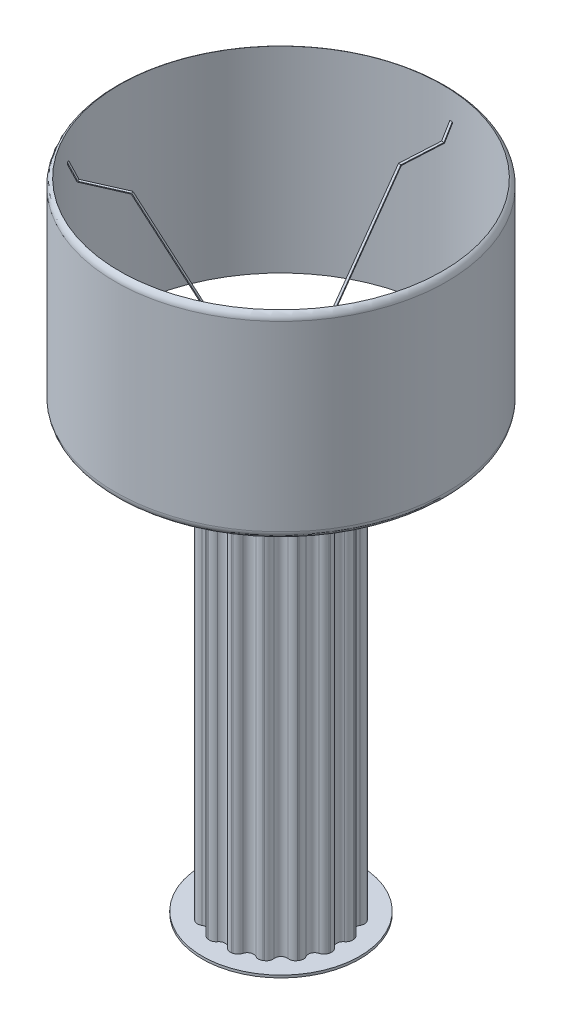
ISO-10303-21;
HEADER;
FILE_DESCRIPTION(('STEP AP214'),'2;1');
FILE_NAME('part.step','',(''),(''),'','','');
FILE_SCHEMA(('AUTOMOTIVE_DESIGN { 1 0 10303 214 1 1 1 1 }'));
ENDSEC;
DATA;
#1=APPLICATION_CONTEXT('core data for automotive mechanical design processes');
#2=APPLICATION_PROTOCOL_DEFINITION('international standard','automotive_design',2000,#1);
#3=PRODUCT_CONTEXT('',#1,'mechanical');
#4=PRODUCT('Part','Part','',(#3));
#5=PRODUCT_RELATED_PRODUCT_CATEGORY('part','',(#4));
#6=PRODUCT_DEFINITION_FORMATION('','',#4);
#7=PRODUCT_DEFINITION_CONTEXT('part definition',#1,'design');
#8=PRODUCT_DEFINITION('design','',#6,#7);
#9=PRODUCT_DEFINITION_SHAPE('','',#8);
#10=(LENGTH_UNIT() NAMED_UNIT(*) SI_UNIT(.MILLI.,.METRE.));
#11=(NAMED_UNIT(*) PLANE_ANGLE_UNIT() SI_UNIT($,.RADIAN.));
#12=(NAMED_UNIT(*) SI_UNIT($,.STERADIAN.) SOLID_ANGLE_UNIT());
#13=UNCERTAINTY_MEASURE_WITH_UNIT(LENGTH_MEASURE(1.E-05),#10,'distance_accuracy_value','');
#14=(GEOMETRIC_REPRESENTATION_CONTEXT(3) GLOBAL_UNCERTAINTY_ASSIGNED_CONTEXT((#13)) GLOBAL_UNIT_ASSIGNED_CONTEXT((#10,
#11,#12)) REPRESENTATION_CONTEXT('',''));
#15=CARTESIAN_POINT('',(0.,0.,0.));
#16=DIRECTION('',(0.,0.,1.));
#17=DIRECTION('',(1.,0.,0.));
#18=AXIS2_PLACEMENT_3D('',#15,#16,#17);
#19=CARTESIAN_POINT('',(-559.006262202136,318.505915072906,606.));
#20=DIRECTION('',(0.,-1.,0.));
#21=DIRECTION('',(0.,0.,-1.));
#22=AXIS2_PLACEMENT_3D('',#19,#20,#21);
#23=CYLINDRICAL_SURFACE('',#22,75.);
#24=CARTESIAN_POINT('',(-559.006262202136,318.505915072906,606.));
#25=DIRECTION('',(0.,1.,0.));
#26=DIRECTION('',(0.,0.,1.));
#27=AXIS2_PLACEMENT_3D('',#24,#25,#26);
#28=CIRCLE('',#27,75.);
#29=CARTESIAN_POINT('',(-517.88840309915,318.505915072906,668.724171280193));
#30=VERTEX_POINT('',#29);
#31=CARTESIAN_POINT('',(-516.791807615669,318.505915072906,667.991449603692));
#32=VERTEX_POINT('',#31);
#33=EDGE_CURVE('P0_E985',#30,#32,#28,.T.);
#34=ORIENTED_EDGE('',*,*,#33,.F.);
#35=DIRECTION('',(0.,-1.,0.));
#36=VECTOR('',#35,1.);
#37=CARTESIAN_POINT('',(-517.88840309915,318.505915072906,668.724171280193));
#38=LINE('',#37,#36);
#39=CARTESIAN_POINT('',(-517.88840309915,-181.494084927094,668.724171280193));
#40=VERTEX_POINT('',#39);
#41=EDGE_CURVE('P0_E753',#30,#40,#38,.T.);
#42=ORIENTED_EDGE('',*,*,#41,.T.);
#43=CARTESIAN_POINT('',(-559.006262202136,-181.494084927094,606.));
#44=DIRECTION('',(0.,1.,0.));
#45=DIRECTION('',(0.,0.,1.));
#46=AXIS2_PLACEMENT_3D('',#43,#44,#45);
#47=CIRCLE('',#46,75.);
#48=CARTESIAN_POINT('',(-516.791807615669,-181.494084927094,667.991449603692));
#49=VERTEX_POINT('',#48);
#50=EDGE_CURVE('P0_E981',#40,#49,#47,.T.);
#51=ORIENTED_EDGE('',*,*,#50,.T.);
#52=DIRECTION('',(0.,-1.,0.));
#53=VECTOR('',#52,1.);
#54=CARTESIAN_POINT('',(-516.791807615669,318.505915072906,667.991449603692));
#55=LINE('',#54,#53);
#56=EDGE_CURVE('P0_E529',#49,#32,#55,.F.);
#57=ORIENTED_EDGE('',*,*,#56,.T.);
#58=EDGE_LOOP('',(#34,#42,#51,#57));
#59=FACE_BOUND('',#58,.T.);
#60=ADVANCED_FACE('P0_F17',(#59),#23,.T.);
#61=CARTESIAN_POINT('',(-497.014812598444,318.505915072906,648.214454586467));
#62=VERTEX_POINT('',#61);
#63=CARTESIAN_POINT('',(-496.282090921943,318.505915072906,647.117859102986));
#64=VERTEX_POINT('',#63);
#65=EDGE_CURVE('P0_E1722',#62,#64,#28,.T.);
#66=ORIENTED_EDGE('',*,*,#65,.F.);
#67=DIRECTION('',(0.,-1.,0.));
#68=VECTOR('',#67,1.);
#69=CARTESIAN_POINT('',(-497.014812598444,318.505915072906,648.214454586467));
#70=LINE('',#69,#68);
#71=CARTESIAN_POINT('',(-497.014812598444,-181.494084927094,648.214454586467));
#72=VERTEX_POINT('',#71);
#73=EDGE_CURVE('P0_E766',#62,#72,#70,.T.);
#74=ORIENTED_EDGE('',*,*,#73,.T.);
#75=CARTESIAN_POINT('',(-496.282090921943,-181.494084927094,647.117859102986));
#76=VERTEX_POINT('',#75);
#77=EDGE_CURVE('P0_E1126',#72,#76,#47,.T.);
#78=ORIENTED_EDGE('',*,*,#77,.T.);
#79=DIRECTION('',(0.,-1.,0.));
#80=VECTOR('',#79,1.);
#81=CARTESIAN_POINT('',(-496.282090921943,318.505915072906,647.117859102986));
#82=LINE('',#81,#80);
#83=EDGE_CURVE('P0_E545',#76,#64,#82,.F.);
#84=ORIENTED_EDGE('',*,*,#83,.T.);
#85=EDGE_LOOP('',(#66,#74,#78,#84));
#86=FACE_BOUND('',#85,.T.);
#87=ADVANCED_FACE('P0_F1088',(#86),#23,.T.);
#88=CARTESIAN_POINT('',(-485.578858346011,318.505915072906,621.277969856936));
#89=VERTEX_POINT('',#88);
#90=CARTESIAN_POINT('',(-485.321560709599,318.505915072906,619.984447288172));
#91=VERTEX_POINT('',#90);
#92=EDGE_CURVE('P0_E1709',#89,#91,#28,.T.);
#93=ORIENTED_EDGE('',*,*,#92,.F.);
#94=DIRECTION('',(0.,-1.,0.));
#95=VECTOR('',#94,1.);
#96=CARTESIAN_POINT('',(-485.578858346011,318.505915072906,621.277969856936));
#97=LINE('',#96,#95);
#98=CARTESIAN_POINT('',(-485.578858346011,-181.494084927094,621.277969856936));
#99=VERTEX_POINT('',#98);
#100=EDGE_CURVE('P0_E779',#89,#99,#97,.T.);
#101=ORIENTED_EDGE('',*,*,#100,.T.);
#102=CARTESIAN_POINT('',(-485.321560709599,-181.494084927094,619.984447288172));
#103=VERTEX_POINT('',#102);
#104=EDGE_CURVE('P0_E1128',#99,#103,#47,.T.);
#105=ORIENTED_EDGE('',*,*,#104,.T.);
#106=DIRECTION('',(0.,-1.,0.));
#107=VECTOR('',#106,1.);
#108=CARTESIAN_POINT('',(-485.321560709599,318.505915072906,619.984447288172));
#109=LINE('',#108,#107);
#110=EDGE_CURVE('P0_E561',#103,#91,#109,.F.);
#111=ORIENTED_EDGE('',*,*,#110,.T.);
#112=EDGE_LOOP('',(#93,#101,#105,#111));
#113=FACE_BOUND('',#112,.T.);
#114=ADVANCED_FACE('P0_F1093',(#113),#23,.T.);
#115=CARTESIAN_POINT('',(-485.321560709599,318.505915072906,592.015552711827));
#116=VERTEX_POINT('',#115);
#117=CARTESIAN_POINT('',(-485.578858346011,318.505915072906,590.722030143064));
#118=VERTEX_POINT('',#117);
#119=EDGE_CURVE('P0_E1695',#116,#118,#28,.T.);
#120=ORIENTED_EDGE('',*,*,#119,.F.);
#121=DIRECTION('',(0.,-1.,0.));
#122=VECTOR('',#121,1.);
#123=CARTESIAN_POINT('',(-485.321560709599,318.505915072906,592.015552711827));
#124=LINE('',#123,#122);
#125=CARTESIAN_POINT('',(-485.321560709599,-181.494084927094,592.015552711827));
#126=VERTEX_POINT('',#125);
#127=EDGE_CURVE('P0_E792',#116,#126,#124,.T.);
#128=ORIENTED_EDGE('',*,*,#127,.T.);
#129=CARTESIAN_POINT('',(-485.578858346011,-181.494084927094,590.722030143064));
#130=VERTEX_POINT('',#129);
#131=EDGE_CURVE('P0_E1130',#126,#130,#47,.T.);
#132=ORIENTED_EDGE('',*,*,#131,.T.);
#133=DIRECTION('',(0.,-1.,0.));
#134=VECTOR('',#133,1.);
#135=CARTESIAN_POINT('',(-485.578858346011,318.505915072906,590.722030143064));
#136=LINE('',#135,#134);
#137=EDGE_CURVE('P0_E577',#130,#118,#136,.F.);
#138=ORIENTED_EDGE('',*,*,#137,.T.);
#139=EDGE_LOOP('',(#120,#128,#132,#138));
#140=FACE_BOUND('',#139,.T.);
#141=ADVANCED_FACE('P0_F1701',(#140),#23,.T.);
#142=CARTESIAN_POINT('',(-496.282090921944,318.505915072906,564.882140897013));
#143=VERTEX_POINT('',#142);
#144=CARTESIAN_POINT('',(-497.014812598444,318.505915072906,563.785545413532));
#145=VERTEX_POINT('',#144);
#146=EDGE_CURVE('P0_E1681',#143,#145,#28,.T.);
#147=ORIENTED_EDGE('',*,*,#146,.F.);
#148=DIRECTION('',(0.,-1.,0.));
#149=VECTOR('',#148,1.);
#150=CARTESIAN_POINT('',(-496.282090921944,318.505915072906,564.882140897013));
#151=LINE('',#150,#149);
#152=CARTESIAN_POINT('',(-496.282090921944,-181.494084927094,564.882140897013));
#153=VERTEX_POINT('',#152);
#154=EDGE_CURVE('P0_E805',#143,#153,#151,.T.);
#155=ORIENTED_EDGE('',*,*,#154,.T.);
#156=CARTESIAN_POINT('',(-497.014812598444,-181.494084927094,563.785545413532));
#157=VERTEX_POINT('',#156);
#158=EDGE_CURVE('P0_E1132',#153,#157,#47,.T.);
#159=ORIENTED_EDGE('',*,*,#158,.T.);
#160=DIRECTION('',(0.,-1.,0.));
#161=VECTOR('',#160,1.);
#162=CARTESIAN_POINT('',(-497.014812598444,318.505915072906,563.785545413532));
#163=LINE('',#162,#161);
#164=EDGE_CURVE('P0_E593',#157,#145,#163,.F.);
#165=ORIENTED_EDGE('',*,*,#164,.T.);
#166=EDGE_LOOP('',(#147,#155,#159,#165));
#167=FACE_BOUND('',#166,.T.);
#168=ADVANCED_FACE('P0_F1687',(#167),#23,.T.);
#169=CARTESIAN_POINT('',(-516.791807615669,318.505915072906,544.008550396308));
#170=VERTEX_POINT('',#169);
#171=CARTESIAN_POINT('',(-517.88840309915,318.505915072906,543.275828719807));
#172=VERTEX_POINT('',#171);
#173=EDGE_CURVE('P0_E1668',#170,#172,#28,.T.);
#174=ORIENTED_EDGE('',*,*,#173,.F.);
#175=DIRECTION('',(0.,-1.,0.));
#176=VECTOR('',#175,1.);
#177=CARTESIAN_POINT('',(-516.791807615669,318.505915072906,544.008550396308));
#178=LINE('',#177,#176);
#179=CARTESIAN_POINT('',(-516.791807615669,-181.494084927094,544.008550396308));
#180=VERTEX_POINT('',#179);
#181=EDGE_CURVE('P0_E818',#170,#180,#178,.T.);
#182=ORIENTED_EDGE('',*,*,#181,.T.);
#183=CARTESIAN_POINT('',(-517.88840309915,-181.494084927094,543.275828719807));
#184=VERTEX_POINT('',#183);
#185=EDGE_CURVE('P0_E1134',#180,#184,#47,.T.);
#186=ORIENTED_EDGE('',*,*,#185,.T.);
#187=DIRECTION('',(0.,-1.,0.));
#188=VECTOR('',#187,1.);
#189=CARTESIAN_POINT('',(-517.88840309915,318.505915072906,543.275828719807));
#190=LINE('',#189,#188);
#191=EDGE_CURVE('P0_E609',#184,#172,#190,.F.);
#192=ORIENTED_EDGE('',*,*,#191,.T.);
#193=EDGE_LOOP('',(#174,#182,#186,#192));
#194=FACE_BOUND('',#193,.T.);
#195=ADVANCED_FACE('P0_F1641',(#194),#23,.T.);
#196=CARTESIAN_POINT('',(-543.728292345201,318.505915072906,532.572596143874));
#197=VERTEX_POINT('',#196);
#198=CARTESIAN_POINT('',(-545.021814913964,318.505915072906,532.315298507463));
#199=VERTEX_POINT('',#198);
#200=EDGE_CURVE('P0_E1649',#197,#199,#28,.T.);
#201=ORIENTED_EDGE('',*,*,#200,.F.);
#202=DIRECTION('',(0.,-1.,0.));
#203=VECTOR('',#202,1.);
#204=CARTESIAN_POINT('',(-543.728292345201,318.505915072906,532.572596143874));
#205=LINE('',#204,#203);
#206=CARTESIAN_POINT('',(-543.728292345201,-181.494084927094,532.572596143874));
#207=VERTEX_POINT('',#206);
#208=EDGE_CURVE('P0_E831',#197,#207,#205,.T.);
#209=ORIENTED_EDGE('',*,*,#208,.T.);
#210=CARTESIAN_POINT('',(-545.021814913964,-181.494084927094,532.315298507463));
#211=VERTEX_POINT('',#210);
#212=EDGE_CURVE('P0_E1136',#207,#211,#47,.T.);
#213=ORIENTED_EDGE('',*,*,#212,.T.);
#214=DIRECTION('',(0.,-1.,0.));
#215=VECTOR('',#214,1.);
#216=CARTESIAN_POINT('',(-545.021814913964,318.505915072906,532.315298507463));
#217=LINE('',#216,#215);
#218=EDGE_CURVE('P0_E625',#211,#199,#217,.F.);
#219=ORIENTED_EDGE('',*,*,#218,.T.);
#220=EDGE_LOOP('',(#201,#209,#213,#219));
#221=FACE_BOUND('',#220,.T.);
#222=ADVANCED_FACE('P0_F1636',(#221),#23,.T.);
#223=CARTESIAN_POINT('',(-572.990709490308,318.505915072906,532.315298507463));
#224=VERTEX_POINT('',#223);
#225=CARTESIAN_POINT('',(-574.284232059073,318.505915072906,532.572596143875));
#226=VERTEX_POINT('',#225);
#227=EDGE_CURVE('P0_E1061',#224,#226,#28,.T.);
#228=ORIENTED_EDGE('',*,*,#227,.F.);
#229=DIRECTION('',(0.,-1.,0.));
#230=VECTOR('',#229,1.);
#231=CARTESIAN_POINT('',(-572.990709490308,318.505915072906,532.315298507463));
#232=LINE('',#231,#230);
#233=CARTESIAN_POINT('',(-572.990709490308,-181.494084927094,532.315298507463));
#234=VERTEX_POINT('',#233);
#235=EDGE_CURVE('P0_E844',#224,#234,#232,.T.);
#236=ORIENTED_EDGE('',*,*,#235,.T.);
#237=CARTESIAN_POINT('',(-574.284232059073,-181.494084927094,532.572596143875));
#238=VERTEX_POINT('',#237);
#239=EDGE_CURVE('P0_E1138',#234,#238,#47,.T.);
#240=ORIENTED_EDGE('',*,*,#239,.T.);
#241=DIRECTION('',(0.,-1.,0.));
#242=VECTOR('',#241,1.);
#243=CARTESIAN_POINT('',(-574.284232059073,318.505915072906,532.572596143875));
#244=LINE('',#243,#242);
#245=EDGE_CURVE('P0_E641',#238,#226,#244,.F.);
#246=ORIENTED_EDGE('',*,*,#245,.T.);
#247=EDGE_LOOP('',(#228,#236,#240,#246));
#248=FACE_BOUND('',#247,.T.);
#249=ADVANCED_FACE('P0_F1631',(#248),#23,.T.);
#250=CARTESIAN_POINT('',(-600.124121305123,318.505915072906,543.275828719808));
#251=VERTEX_POINT('',#250);
#252=CARTESIAN_POINT('',(-601.220716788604,318.505915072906,544.008550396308));
#253=VERTEX_POINT('',#252);
#254=EDGE_CURVE('P0_E1041',#251,#253,#28,.T.);
#255=ORIENTED_EDGE('',*,*,#254,.F.);
#256=DIRECTION('',(0.,-1.,0.));
#257=VECTOR('',#256,1.);
#258=CARTESIAN_POINT('',(-600.124121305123,318.505915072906,543.275828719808));
#259=LINE('',#258,#257);
#260=CARTESIAN_POINT('',(-600.124121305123,-181.494084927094,543.275828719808));
#261=VERTEX_POINT('',#260);
#262=EDGE_CURVE('P0_E857',#251,#261,#259,.T.);
#263=ORIENTED_EDGE('',*,*,#262,.T.);
#264=CARTESIAN_POINT('',(-601.220716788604,-181.494084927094,544.008550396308));
#265=VERTEX_POINT('',#264);
#266=EDGE_CURVE('P0_E1046',#261,#265,#47,.T.);
#267=ORIENTED_EDGE('',*,*,#266,.T.);
#268=DIRECTION('',(0.,-1.,0.));
#269=VECTOR('',#268,1.);
#270=CARTESIAN_POINT('',(-601.220716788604,318.505915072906,544.008550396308));
#271=LINE('',#270,#269);
#272=EDGE_CURVE('P0_E657',#265,#253,#271,.F.);
#273=ORIENTED_EDGE('',*,*,#272,.T.);
#274=EDGE_LOOP('',(#255,#263,#267,#273));
#275=FACE_BOUND('',#274,.T.);
#276=ADVANCED_FACE('P0_F1629',(#275),#23,.T.);
#277=CARTESIAN_POINT('',(-620.997711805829,318.505915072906,563.785545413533));
#278=VERTEX_POINT('',#277);
#279=CARTESIAN_POINT('',(-621.730433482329,318.505915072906,564.882140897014));
#280=VERTEX_POINT('',#279);
#281=EDGE_CURVE('P0_E1052',#278,#280,#28,.T.);
#282=ORIENTED_EDGE('',*,*,#281,.F.);
#283=DIRECTION('',(0.,-1.,0.));
#284=VECTOR('',#283,1.);
#285=CARTESIAN_POINT('',(-620.997711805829,318.505915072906,563.785545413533));
#286=LINE('',#285,#284);
#287=CARTESIAN_POINT('',(-620.997711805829,-181.494084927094,563.785545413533));
#288=VERTEX_POINT('',#287);
#289=EDGE_CURVE('P0_E870',#278,#288,#286,.T.);
#290=ORIENTED_EDGE('',*,*,#289,.T.);
#291=CARTESIAN_POINT('',(-621.730433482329,-181.494084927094,564.882140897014));
#292=VERTEX_POINT('',#291);
#293=EDGE_CURVE('P0_E1141',#288,#292,#47,.T.);
#294=ORIENTED_EDGE('',*,*,#293,.T.);
#295=DIRECTION('',(0.,-1.,0.));
#296=VECTOR('',#295,1.);
#297=CARTESIAN_POINT('',(-621.730433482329,318.505915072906,564.882140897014));
#298=LINE('',#297,#296);
#299=EDGE_CURVE('P0_E673',#292,#280,#298,.F.);
#300=ORIENTED_EDGE('',*,*,#299,.T.);
#301=EDGE_LOOP('',(#282,#290,#294,#300));
#302=FACE_BOUND('',#301,.T.);
#303=ADVANCED_FACE('P0_F1055',(#302),#23,.T.);
#304=CARTESIAN_POINT('',(-632.433666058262,318.505915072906,590.722030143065));
#305=VERTEX_POINT('',#304);
#306=CARTESIAN_POINT('',(-632.690963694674,318.505915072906,592.015552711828));
#307=VERTEX_POINT('',#306);
#308=EDGE_CURVE('P0_E1058',#305,#307,#28,.T.);
#309=ORIENTED_EDGE('',*,*,#308,.F.);
#310=DIRECTION('',(0.,-1.,0.));
#311=VECTOR('',#310,1.);
#312=CARTESIAN_POINT('',(-632.433666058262,318.505915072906,590.722030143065));
#313=LINE('',#312,#311);
#314=CARTESIAN_POINT('',(-632.433666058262,-181.494084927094,590.722030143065));
#315=VERTEX_POINT('',#314);
#316=EDGE_CURVE('P0_E883',#305,#315,#313,.T.);
#317=ORIENTED_EDGE('',*,*,#316,.T.);
#318=CARTESIAN_POINT('',(-632.690963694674,-181.494084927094,592.015552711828));
#319=VERTEX_POINT('',#318);
#320=EDGE_CURVE('P0_E978',#315,#319,#47,.T.);
#321=ORIENTED_EDGE('',*,*,#320,.T.);
#322=DIRECTION('',(0.,-1.,0.));
#323=VECTOR('',#322,1.);
#324=CARTESIAN_POINT('',(-632.690963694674,318.505915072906,592.015552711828));
#325=LINE('',#324,#323);
#326=EDGE_CURVE('P0_E689',#319,#307,#325,.F.);
#327=ORIENTED_EDGE('',*,*,#326,.T.);
#328=EDGE_LOOP('',(#309,#317,#321,#327));
#329=FACE_BOUND('',#328,.T.);
#330=ADVANCED_FACE('P0_F1083',(#329),#23,.T.);
#331=CARTESIAN_POINT('',(-632.690963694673,318.505915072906,619.984447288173));
#332=VERTEX_POINT('',#331);
#333=CARTESIAN_POINT('',(-632.433666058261,318.505915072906,621.277969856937));
#334=VERTEX_POINT('',#333);
#335=EDGE_CURVE('P0_E1062',#332,#334,#28,.T.);
#336=ORIENTED_EDGE('',*,*,#335,.F.);
#337=DIRECTION('',(0.,-1.,0.));
#338=VECTOR('',#337,1.);
#339=CARTESIAN_POINT('',(-632.690963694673,318.505915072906,619.984447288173));
#340=LINE('',#339,#338);
#341=CARTESIAN_POINT('',(-632.690963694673,-181.494084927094,619.984447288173));
#342=VERTEX_POINT('',#341);
#343=EDGE_CURVE('P0_E896',#332,#342,#340,.T.);
#344=ORIENTED_EDGE('',*,*,#343,.T.);
#345=CARTESIAN_POINT('',(-632.433666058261,-181.494084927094,621.277969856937));
#346=VERTEX_POINT('',#345);
#347=EDGE_CURVE('P0_E975',#342,#346,#47,.T.);
#348=ORIENTED_EDGE('',*,*,#347,.T.);
#349=DIRECTION('',(0.,-1.,0.));
#350=VECTOR('',#349,1.);
#351=CARTESIAN_POINT('',(-632.433666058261,318.505915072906,621.277969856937));
#352=LINE('',#351,#350);
#353=EDGE_CURVE('P0_E705',#346,#334,#352,.F.);
#354=ORIENTED_EDGE('',*,*,#353,.T.);
#355=EDGE_LOOP('',(#336,#344,#348,#354));
#356=FACE_BOUND('',#355,.T.);
#357=ADVANCED_FACE('P0_F1075',(#356),#23,.T.);
#358=CARTESIAN_POINT('',(-621.730433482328,318.505915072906,647.117859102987));
#359=VERTEX_POINT('',#358);
#360=CARTESIAN_POINT('',(-620.997711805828,318.505915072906,648.214454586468));
#361=VERTEX_POINT('',#360);
#362=EDGE_CURVE('P0_E957',#359,#361,#28,.T.);
#363=ORIENTED_EDGE('',*,*,#362,.F.);
#364=DIRECTION('',(0.,-1.,0.));
#365=VECTOR('',#364,1.);
#366=CARTESIAN_POINT('',(-621.730433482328,318.505915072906,647.117859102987));
#367=LINE('',#366,#365);
#368=CARTESIAN_POINT('',(-621.730433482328,-181.494084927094,647.117859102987));
#369=VERTEX_POINT('',#368);
#370=EDGE_CURVE('P0_E909',#359,#369,#367,.T.);
#371=ORIENTED_EDGE('',*,*,#370,.T.);
#372=CARTESIAN_POINT('',(-620.997711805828,-181.494084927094,648.214454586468));
#373=VERTEX_POINT('',#372);
#374=EDGE_CURVE('P0_E971',#369,#373,#47,.T.);
#375=ORIENTED_EDGE('',*,*,#374,.T.);
#376=DIRECTION('',(0.,-1.,0.));
#377=VECTOR('',#376,1.);
#378=CARTESIAN_POINT('',(-620.997711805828,318.505915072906,648.214454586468));
#379=LINE('',#378,#377);
#380=EDGE_CURVE('P0_E721',#373,#361,#379,.F.);
#381=ORIENTED_EDGE('',*,*,#380,.T.);
#382=EDGE_LOOP('',(#363,#371,#375,#381));
#383=FACE_BOUND('',#382,.T.);
#384=ADVANCED_FACE('P0_F1073',(#383),#23,.T.);
#385=CARTESIAN_POINT('',(-601.220716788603,318.505915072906,667.991449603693));
#386=VERTEX_POINT('',#385);
#387=CARTESIAN_POINT('',(-600.124121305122,318.505915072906,668.724171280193));
#388=VERTEX_POINT('',#387);
#389=EDGE_CURVE('P0_E946',#386,#388,#28,.T.);
#390=ORIENTED_EDGE('',*,*,#389,.F.);
#391=DIRECTION('',(0.,-1.,0.));
#392=VECTOR('',#391,1.);
#393=CARTESIAN_POINT('',(-601.220716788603,318.505915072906,667.991449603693));
#394=LINE('',#393,#392);
#395=CARTESIAN_POINT('',(-601.220716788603,-181.494084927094,667.991449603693));
#396=VERTEX_POINT('',#395);
#397=EDGE_CURVE('P0_E922',#386,#396,#394,.T.);
#398=ORIENTED_EDGE('',*,*,#397,.T.);
#399=CARTESIAN_POINT('',(-600.124121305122,-181.494084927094,668.724171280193));
#400=VERTEX_POINT('',#399);
#401=EDGE_CURVE('P0_E426',#396,#400,#47,.T.);
#402=ORIENTED_EDGE('',*,*,#401,.T.);
#403=DIRECTION('',(0.,-1.,0.));
#404=VECTOR('',#403,1.);
#405=CARTESIAN_POINT('',(-600.124121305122,318.505915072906,668.724171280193));
#406=LINE('',#405,#404);
#407=EDGE_CURVE('P0_E737',#400,#388,#406,.F.);
#408=ORIENTED_EDGE('',*,*,#407,.T.);
#409=EDGE_LOOP('',(#390,#398,#402,#408));
#410=FACE_BOUND('',#409,.T.);
#411=ADVANCED_FACE('P0_F953',(#410),#23,.T.);
#412=CARTESIAN_POINT('',(-545.021814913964,-181.494084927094,679.684701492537));
#413=VERTEX_POINT('',#412);
#414=CARTESIAN_POINT('',(-543.7282923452,-181.494084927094,679.427403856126));
#415=VERTEX_POINT('',#414);
#416=EDGE_CURVE('P0_E429',#413,#415,#47,.T.);
#417=ORIENTED_EDGE('',*,*,#416,.T.);
#418=DIRECTION('',(0.,-1.,0.));
#419=VECTOR('',#418,1.);
#420=CARTESIAN_POINT('',(-543.7282923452,318.505915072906,679.427403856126));
#421=LINE('',#420,#419);
#422=CARTESIAN_POINT('',(-543.7282923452,318.505915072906,679.427403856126));
#423=VERTEX_POINT('',#422);
#424=EDGE_CURVE('P0_E514',#415,#423,#421,.F.);
#425=ORIENTED_EDGE('',*,*,#424,.T.);
#426=CARTESIAN_POINT('',(-545.021814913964,318.505915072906,679.684701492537));
#427=VERTEX_POINT('',#426);
#428=EDGE_CURVE('P0_E452',#427,#423,#28,.T.);
#429=ORIENTED_EDGE('',*,*,#428,.F.);
#430=DIRECTION('',(0.,-1.,0.));
#431=VECTOR('',#430,1.);
#432=CARTESIAN_POINT('',(-545.021814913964,318.505915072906,679.684701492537));
#433=LINE('',#432,#431);
#434=EDGE_CURVE('P0_E439',#427,#413,#433,.T.);
#435=ORIENTED_EDGE('',*,*,#434,.T.);
#436=EDGE_LOOP('',(#417,#425,#429,#435));
#437=FACE_BOUND('',#436,.T.);
#438=ADVANCED_FACE('P0_F1082',(#437),#23,.T.);
#439=CARTESIAN_POINT('',(-574.284232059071,318.505915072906,679.427403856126));
#440=VERTEX_POINT('',#439);
#441=CARTESIAN_POINT('',(-572.990709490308,318.505915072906,679.684701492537));
#442=VERTEX_POINT('',#441);
#443=EDGE_CURVE('P0_E958',#440,#442,#28,.T.);
#444=ORIENTED_EDGE('',*,*,#443,.F.);
#445=DIRECTION('',(0.,-1.,0.));
#446=VECTOR('',#445,1.);
#447=CARTESIAN_POINT('',(-574.284232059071,318.505915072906,679.427403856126));
#448=LINE('',#447,#446);
#449=CARTESIAN_POINT('',(-574.284232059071,-181.494084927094,679.427403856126));
#450=VERTEX_POINT('',#449);
#451=EDGE_CURVE('P0_E424',#440,#450,#448,.T.);
#452=ORIENTED_EDGE('',*,*,#451,.T.);
#453=CARTESIAN_POINT('',(-572.990709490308,-181.494084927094,679.684701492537));
#454=VERTEX_POINT('',#453);
#455=EDGE_CURVE('P0_E417',#450,#454,#47,.T.);
#456=ORIENTED_EDGE('',*,*,#455,.T.);
#457=DIRECTION('',(0.,-1.,0.));
#458=VECTOR('',#457,1.);
#459=CARTESIAN_POINT('',(-572.990709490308,318.505915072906,679.684701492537));
#460=LINE('',#459,#458);
#461=EDGE_CURVE('P0_E422',#454,#442,#460,.F.);
#462=ORIENTED_EDGE('',*,*,#461,.T.);
#463=EDGE_LOOP('',(#444,#452,#456,#462));
#464=FACE_BOUND('',#463,.T.);
#465=ADVANCED_FACE('P0_F420',(#464),#23,.T.);
#466=CARTESIAN_POINT('',(-559.006262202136,318.505915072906,606.));
#467=DIRECTION('',(0.,1.,0.));
#468=DIRECTION('',(0.,0.,1.));
#469=AXIS2_PLACEMENT_3D('',#466,#467,#468);
#470=PLANE('',#469);
#471=CARTESIAN_POINT('',(-587.707519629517,318.505915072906,675.290964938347));
#472=DIRECTION('',(0.,1.,0.));
#473=DIRECTION('',(-0.382683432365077,0.,0.923879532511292));
#474=AXIS2_PLACEMENT_3D('',#471,#472,#473);
#475=CIRCLE('',#474,7.5);
#476=CARTESIAN_POINT('',(-580.423840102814,318.505915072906,673.502666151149));
#477=VERTEX_POINT('',#476);
#478=CARTESIAN_POINT('',(-591.593340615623,318.505915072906,668.876107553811));
#479=VERTEX_POINT('',#478);
#480=EDGE_CURVE('P0_E1016',#477,#479,#475,.T.);
#481=ORIENTED_EDGE('',*,*,#480,.F.);
#482=CARTESIAN_POINT('',(-572.654581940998,318.505915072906,671.595147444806));
#483=DIRECTION('',(0.,1.,0.));
#484=DIRECTION('',(0.,0.,1.));
#485=AXIS2_PLACEMENT_3D('',#482,#483,#484);
#486=CIRCLE('',#485,8.);
#487=EDGE_CURVE('P0_E11',#477,#440,#486,.T.);
#488=ORIENTED_EDGE('',*,*,#487,.T.);
#489=ORIENTED_EDGE('',*,*,#443,.T.);
#490=CARTESIAN_POINT('',(-571.499035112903,318.505915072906,671.825));
#491=DIRECTION('',(0.,1.,0.));
#492=DIRECTION('',(0.,0.,1.));
#493=AXIS2_PLACEMENT_3D('',#490,#491,#492);
#494=CIRCLE('',#493,8.);
#495=CARTESIAN_POINT('',(-565.051152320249,318.505915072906,676.560483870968));
#496=VERTEX_POINT('',#495);
#497=EDGE_CURVE('P0_E445',#442,#496,#494,.T.);
#498=ORIENTED_EDGE('',*,*,#497,.T.);
#499=CARTESIAN_POINT('',(-559.006262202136,318.505915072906,681.));
#500=DIRECTION('',(0.,1.,0.));
#501=DIRECTION('',(0.,0.,1.));
#502=AXIS2_PLACEMENT_3D('',#499,#500,#501);
#503=CIRCLE('',#502,7.5);
#504=CARTESIAN_POINT('',(-552.961372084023,318.505915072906,676.560483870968));
#505=VERTEX_POINT('',#504);
#506=EDGE_CURVE('P0_E427',#505,#496,#503,.T.);
#507=ORIENTED_EDGE('',*,*,#506,.F.);
#508=CARTESIAN_POINT('',(-546.513489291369,318.505915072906,671.825));
#509=DIRECTION('',(0.,1.,0.));
#510=DIRECTION('',(0.,0.,1.));
#511=AXIS2_PLACEMENT_3D('',#508,#509,#510);
#512=CIRCLE('',#511,8.);
#513=EDGE_CURVE('P0_E466',#505,#427,#512,.T.);
#514=ORIENTED_EDGE('',*,*,#513,.T.);
#515=ORIENTED_EDGE('',*,*,#428,.T.);
#516=CARTESIAN_POINT('',(-545.357942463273,318.505915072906,671.595147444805));
#517=DIRECTION('',(0.,1.,0.));
#518=DIRECTION('',(0.,0.,1.));
#519=AXIS2_PLACEMENT_3D('',#516,#517,#518);
#520=CIRCLE('',#519,8.);
#521=CARTESIAN_POINT('',(-537.588684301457,318.505915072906,673.502666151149));
#522=VERTEX_POINT('',#521);
#523=EDGE_CURVE('P0_E518',#423,#522,#520,.T.);
#524=ORIENTED_EDGE('',*,*,#523,.T.);
#525=CARTESIAN_POINT('',(-530.305004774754,318.505915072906,675.290964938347));
#526=DIRECTION('',(0.,1.,0.));
#527=DIRECTION('',(0.382683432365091,0.,0.923879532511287));
#528=AXIS2_PLACEMENT_3D('',#525,#526,#527);
#529=CIRCLE('',#528,7.5);
#530=CARTESIAN_POINT('',(-526.419183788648,318.505915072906,668.87610755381));
#531=VERTEX_POINT('',#530);
#532=EDGE_CURVE('P0_E988',#531,#522,#529,.T.);
#533=ORIENTED_EDGE('',*,*,#532,.F.);
#534=CARTESIAN_POINT('',(-522.274308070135,318.505915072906,662.033593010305));
#535=DIRECTION('',(0.,1.,0.));
#536=DIRECTION('',(0.,0.,1.));
#537=AXIS2_PLACEMENT_3D('',#534,#535,#536);
#538=CIRCLE('',#537,8.);
#539=EDGE_CURVE('P0_E763',#531,#30,#538,.T.);
#540=ORIENTED_EDGE('',*,*,#539,.T.);
#541=ORIENTED_EDGE('',*,*,#33,.T.);
#542=CARTESIAN_POINT('',(-521.294682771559,318.505915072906,661.379028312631));
#543=DIRECTION('',(0.,1.,0.));
#544=DIRECTION('',(0.,0.,1.));
#545=AXIS2_PLACEMENT_3D('',#542,#543,#544);
#546=CIRCLE('',#545,8.);
#547=CARTESIAN_POINT('',(-513.386848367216,318.505915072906,660.168179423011));
#548=VERTEX_POINT('',#547);
#549=EDGE_CURVE('P0_E533',#32,#548,#546,.T.);
#550=ORIENTED_EDGE('',*,*,#549,.T.);
#551=CARTESIAN_POINT('',(-505.973253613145,318.505915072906,659.033008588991));
#552=DIRECTION('',(0.,1.,0.));
#553=DIRECTION('',(0.707106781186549,0.,0.707106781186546));
#554=AXIS2_PLACEMENT_3D('',#551,#552,#553);
#555=CIRCLE('',#554,7.5);
#556=CARTESIAN_POINT('',(-504.838082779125,318.505915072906,651.61941383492));
#557=VERTEX_POINT('',#556);
#558=EDGE_CURVE('P0_E991',#557,#548,#555,.T.);
#559=ORIENTED_EDGE('',*,*,#558,.F.);
#560=CARTESIAN_POINT('',(-503.627233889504,318.505915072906,643.711579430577));
#561=DIRECTION('',(0.,1.,0.));
#562=DIRECTION('',(0.,0.,1.));
#563=AXIS2_PLACEMENT_3D('',#560,#561,#562);
#564=CIRCLE('',#563,8.);
#565=EDGE_CURVE('P0_E776',#557,#62,#564,.T.);
#566=ORIENTED_EDGE('',*,*,#565,.T.);
#567=ORIENTED_EDGE('',*,*,#65,.T.);
#568=CARTESIAN_POINT('',(-502.972669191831,318.505915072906,642.731954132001));
#569=DIRECTION('',(0.,1.,0.));
#570=DIRECTION('',(0.,0.,1.));
#571=AXIS2_PLACEMENT_3D('',#568,#569,#570);
#572=CIRCLE('',#571,8.);
#573=CARTESIAN_POINT('',(-496.130154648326,318.505915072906,638.587078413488));
#574=VERTEX_POINT('',#573);
#575=EDGE_CURVE('P0_E549',#64,#574,#572,.T.);
#576=ORIENTED_EDGE('',*,*,#575,.T.);
#577=CARTESIAN_POINT('',(-489.71529726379,318.505915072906,634.701257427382));
#578=DIRECTION('',(0.,1.,0.));
#579=DIRECTION('',(0.923879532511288,0.,0.382683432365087));
#580=AXIS2_PLACEMENT_3D('',#577,#578,#579);
#581=CIRCLE('',#580,7.5);
#582=CARTESIAN_POINT('',(-491.503596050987,318.505915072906,627.417577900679));
#583=VERTEX_POINT('',#582);
#584=EDGE_CURVE('P0_E1011',#583,#574,#581,.T.);
#585=ORIENTED_EDGE('',*,*,#584,.F.);
#586=CARTESIAN_POINT('',(-493.411114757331,318.505915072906,619.648319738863));
#587=DIRECTION('',(0.,1.,0.));
#588=DIRECTION('',(0.,0.,1.));
#589=AXIS2_PLACEMENT_3D('',#586,#587,#588);
#590=CIRCLE('',#589,8.);
#591=EDGE_CURVE('P0_E789',#583,#89,#590,.T.);
#592=ORIENTED_EDGE('',*,*,#591,.T.);
#593=ORIENTED_EDGE('',*,*,#92,.T.);
#594=CARTESIAN_POINT('',(-493.181262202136,318.505915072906,618.492772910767));
#595=DIRECTION('',(0.,1.,0.));
#596=DIRECTION('',(0.,0.,1.));
#597=AXIS2_PLACEMENT_3D('',#594,#595,#596);
#598=CIRCLE('',#597,8.);
#599=CARTESIAN_POINT('',(-488.445778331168,318.505915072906,612.044890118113));
#600=VERTEX_POINT('',#599);
#601=EDGE_CURVE('P0_E565',#91,#600,#598,.T.);
#602=ORIENTED_EDGE('',*,*,#601,.T.);
#603=CARTESIAN_POINT('',(-484.006262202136,318.505915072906,606.));
#604=DIRECTION('',(0.,1.,0.));
#605=DIRECTION('',(1.,0.,0.));
#606=AXIS2_PLACEMENT_3D('',#603,#604,#605);
#607=CIRCLE('',#606,7.5);
#608=CARTESIAN_POINT('',(-488.445778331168,318.505915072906,599.955109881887));
#609=VERTEX_POINT('',#608);
#610=EDGE_CURVE('P0_E1008',#609,#600,#607,.T.);
#611=ORIENTED_EDGE('',*,*,#610,.F.);
#612=CARTESIAN_POINT('',(-493.181262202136,318.505915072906,593.507227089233));
#613=DIRECTION('',(0.,1.,0.));
#614=DIRECTION('',(0.,0.,1.));
#615=AXIS2_PLACEMENT_3D('',#612,#613,#614);
#616=CIRCLE('',#615,8.);
#617=EDGE_CURVE('P0_E802',#609,#116,#616,.T.);
#618=ORIENTED_EDGE('',*,*,#617,.T.);
#619=ORIENTED_EDGE('',*,*,#119,.T.);
#620=CARTESIAN_POINT('',(-493.411114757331,318.505915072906,592.351680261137));
#621=DIRECTION('',(0.,1.,0.));
#622=DIRECTION('',(0.,0.,1.));
#623=AXIS2_PLACEMENT_3D('',#620,#621,#622);
#624=CIRCLE('',#623,8.);
#625=CARTESIAN_POINT('',(-491.503596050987,318.505915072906,584.582422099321));
#626=VERTEX_POINT('',#625);
#627=EDGE_CURVE('P0_E581',#118,#626,#624,.T.);
#628=ORIENTED_EDGE('',*,*,#627,.T.);
#629=CARTESIAN_POINT('',(-489.71529726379,318.505915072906,577.298742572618));
#630=DIRECTION('',(0.,1.,0.));
#631=DIRECTION('',(0.923879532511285,0.,-0.382683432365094));
#632=AXIS2_PLACEMENT_3D('',#629,#630,#631);
#633=CIRCLE('',#632,7.5);
#634=CARTESIAN_POINT('',(-496.130154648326,318.505915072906,573.412921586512));
#635=VERTEX_POINT('',#634);
#636=EDGE_CURVE('P0_E1005',#635,#626,#633,.T.);
#637=ORIENTED_EDGE('',*,*,#636,.F.);
#638=CARTESIAN_POINT('',(-502.972669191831,318.505915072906,569.268045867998));
#639=DIRECTION('',(0.,1.,0.));
#640=DIRECTION('',(0.,0.,1.));
#641=AXIS2_PLACEMENT_3D('',#638,#639,#640);
#642=CIRCLE('',#641,8.);
#643=EDGE_CURVE('P0_E815',#635,#143,#642,.T.);
#644=ORIENTED_EDGE('',*,*,#643,.T.);
#645=ORIENTED_EDGE('',*,*,#146,.T.);
#646=CARTESIAN_POINT('',(-503.627233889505,318.505915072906,568.288420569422));
#647=DIRECTION('',(0.,1.,0.));
#648=DIRECTION('',(0.,0.,1.));
#649=AXIS2_PLACEMENT_3D('',#646,#647,#648);
#650=CIRCLE('',#649,8.);
#651=CARTESIAN_POINT('',(-504.838082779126,318.505915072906,560.38058616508));
#652=VERTEX_POINT('',#651);
#653=EDGE_CURVE('P0_E597',#145,#652,#650,.T.);
#654=ORIENTED_EDGE('',*,*,#653,.T.);
#655=CARTESIAN_POINT('',(-505.973253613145,318.505915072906,552.966991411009));
#656=DIRECTION('',(0.,1.,0.));
#657=DIRECTION('',(0.707106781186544,0.,-0.707106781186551));
#658=AXIS2_PLACEMENT_3D('',#655,#656,#657);
#659=CIRCLE('',#658,7.5);
#660=CARTESIAN_POINT('',(-513.386848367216,318.505915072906,551.831820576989));
#661=VERTEX_POINT('',#660);
#662=EDGE_CURVE('P0_E1002',#661,#652,#659,.T.);
#663=ORIENTED_EDGE('',*,*,#662,.F.);
#664=CARTESIAN_POINT('',(-521.294682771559,318.505915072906,550.620971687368));
#665=DIRECTION('',(0.,1.,0.));
#666=DIRECTION('',(0.,0.,1.));
#667=AXIS2_PLACEMENT_3D('',#664,#665,#666);
#668=CIRCLE('',#667,8.);
#669=EDGE_CURVE('P0_E828',#661,#170,#668,.T.);
#670=ORIENTED_EDGE('',*,*,#669,.T.);
#671=ORIENTED_EDGE('',*,*,#173,.T.);
#672=CARTESIAN_POINT('',(-522.274308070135,318.505915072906,549.966406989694));
#673=DIRECTION('',(0.,1.,0.));
#674=DIRECTION('',(0.,0.,1.));
#675=AXIS2_PLACEMENT_3D('',#672,#673,#674);
#676=CIRCLE('',#675,8.);
#677=CARTESIAN_POINT('',(-526.419183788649,318.505915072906,543.123892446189));
#678=VERTEX_POINT('',#677);
#679=EDGE_CURVE('P0_E613',#172,#678,#676,.T.);
#680=ORIENTED_EDGE('',*,*,#679,.T.);
#681=CARTESIAN_POINT('',(-530.305004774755,318.505915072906,536.709035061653));
#682=DIRECTION('',(0.,1.,0.));
#683=DIRECTION('',(0.382683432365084,0.,-0.923879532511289));
#684=AXIS2_PLACEMENT_3D('',#681,#682,#683);
#685=CIRCLE('',#684,7.5);
#686=CARTESIAN_POINT('',(-537.588684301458,318.505915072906,538.497333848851));
#687=VERTEX_POINT('',#686);
#688=EDGE_CURVE('P0_E999',#687,#678,#685,.T.);
#689=ORIENTED_EDGE('',*,*,#688,.F.);
#690=CARTESIAN_POINT('',(-545.357942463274,318.505915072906,540.404852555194));
#691=DIRECTION('',(0.,1.,0.));
#692=DIRECTION('',(0.,0.,1.));
#693=AXIS2_PLACEMENT_3D('',#690,#691,#692);
#694=CIRCLE('',#693,8.);
#695=EDGE_CURVE('P0_E841',#687,#197,#694,.T.);
#696=ORIENTED_EDGE('',*,*,#695,.T.);
#697=ORIENTED_EDGE('',*,*,#200,.T.);
#698=CARTESIAN_POINT('',(-546.513489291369,318.505915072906,540.175));
#699=DIRECTION('',(0.,1.,0.));
#700=DIRECTION('',(0.,0.,1.));
#701=AXIS2_PLACEMENT_3D('',#698,#699,#700);
#702=CIRCLE('',#701,8.);
#703=CARTESIAN_POINT('',(-552.961372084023,318.505915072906,535.439516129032));
#704=VERTEX_POINT('',#703);
#705=EDGE_CURVE('P0_E629',#199,#704,#702,.T.);
#706=ORIENTED_EDGE('',*,*,#705,.T.);
#707=CARTESIAN_POINT('',(-559.006262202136,318.505915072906,531.));
#708=DIRECTION('',(0.,1.,0.));
#709=DIRECTION('',(0.,0.,-1.));
#710=AXIS2_PLACEMENT_3D('',#707,#708,#709);
#711=CIRCLE('',#710,7.5);
#712=CARTESIAN_POINT('',(-565.051152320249,318.505915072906,535.439516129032));
#713=VERTEX_POINT('',#712);
#714=EDGE_CURVE('P0_E995',#713,#704,#711,.T.);
#715=ORIENTED_EDGE('',*,*,#714,.F.);
#716=CARTESIAN_POINT('',(-571.499035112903,318.505915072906,540.175));
#717=DIRECTION('',(0.,1.,0.));
#718=DIRECTION('',(0.,0.,1.));
#719=AXIS2_PLACEMENT_3D('',#716,#717,#718);
#720=CIRCLE('',#719,8.);
#721=EDGE_CURVE('P0_E854',#713,#224,#720,.T.);
#722=ORIENTED_EDGE('',*,*,#721,.T.);
#723=ORIENTED_EDGE('',*,*,#227,.T.);
#724=CARTESIAN_POINT('',(-572.654581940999,318.505915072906,540.404852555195));
#725=DIRECTION('',(0.,1.,0.));
#726=DIRECTION('',(0.,0.,1.));
#727=AXIS2_PLACEMENT_3D('',#724,#725,#726);
#728=CIRCLE('',#727,8.);
#729=CARTESIAN_POINT('',(-580.423840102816,318.505915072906,538.497333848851));
#730=VERTEX_POINT('',#729);
#731=EDGE_CURVE('P0_E645',#226,#730,#728,.T.);
#732=ORIENTED_EDGE('',*,*,#731,.T.);
#733=CARTESIAN_POINT('',(-587.707519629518,318.505915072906,536.709035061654));
#734=DIRECTION('',(0.,1.,0.));
#735=DIRECTION('',(-0.382683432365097,0.,-0.923879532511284));
#736=AXIS2_PLACEMENT_3D('',#733,#734,#735);
#737=CIRCLE('',#736,7.5);
#738=CARTESIAN_POINT('',(-591.593340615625,318.505915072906,543.12389244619));
#739=VERTEX_POINT('',#738);
#740=EDGE_CURVE('P0_E992',#739,#730,#737,.T.);
#741=ORIENTED_EDGE('',*,*,#740,.F.);
#742=CARTESIAN_POINT('',(-595.738216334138,318.505915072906,549.966406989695));
#743=DIRECTION('',(0.,1.,0.));
#744=DIRECTION('',(0.,0.,1.));
#745=AXIS2_PLACEMENT_3D('',#742,#743,#744);
#746=CIRCLE('',#745,8.);
#747=EDGE_CURVE('P0_E867',#739,#251,#746,.T.);
#748=ORIENTED_EDGE('',*,*,#747,.T.);
#749=ORIENTED_EDGE('',*,*,#254,.T.);
#750=CARTESIAN_POINT('',(-596.717841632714,318.505915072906,550.620971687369));
#751=DIRECTION('',(0.,1.,0.));
#752=DIRECTION('',(0.,0.,1.));
#753=AXIS2_PLACEMENT_3D('',#750,#751,#752);
#754=CIRCLE('',#753,8.);
#755=CARTESIAN_POINT('',(-604.625676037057,318.505915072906,551.83182057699));
#756=VERTEX_POINT('',#755);
#757=EDGE_CURVE('P0_E661',#253,#756,#754,.T.);
#758=ORIENTED_EDGE('',*,*,#757,.T.);
#759=CARTESIAN_POINT('',(-612.039270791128,318.505915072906,552.966991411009));
#760=DIRECTION('',(0.,1.,0.));
#761=DIRECTION('',(-0.707106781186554,0.,-0.707106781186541));
#762=AXIS2_PLACEMENT_3D('',#759,#760,#761);
#763=CIRCLE('',#762,7.5);
#764=CARTESIAN_POINT('',(-613.174441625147,318.505915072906,560.380586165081));
#765=VERTEX_POINT('',#764);
#766=EDGE_CURVE('P0_E996',#765,#756,#763,.T.);
#767=ORIENTED_EDGE('',*,*,#766,.F.);
#768=CARTESIAN_POINT('',(-614.385290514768,318.505915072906,568.288420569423));
#769=DIRECTION('',(0.,1.,0.));
#770=DIRECTION('',(0.,0.,1.));
#771=AXIS2_PLACEMENT_3D('',#768,#769,#770);
#772=CIRCLE('',#771,8.);
#773=EDGE_CURVE('P0_E880',#765,#278,#772,.T.);
#774=ORIENTED_EDGE('',*,*,#773,.T.);
#775=ORIENTED_EDGE('',*,*,#281,.T.);
#776=CARTESIAN_POINT('',(-615.039855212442,318.505915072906,569.268045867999));
#777=DIRECTION('',(0.,1.,0.));
#778=DIRECTION('',(0.,0.,1.));
#779=AXIS2_PLACEMENT_3D('',#776,#777,#778);
#780=CIRCLE('',#779,8.);
#781=CARTESIAN_POINT('',(-621.882369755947,318.505915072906,573.412921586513));
#782=VERTEX_POINT('',#781);
#783=EDGE_CURVE('P0_E677',#280,#782,#780,.T.);
#784=ORIENTED_EDGE('',*,*,#783,.T.);
#785=CARTESIAN_POINT('',(-628.297227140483,318.505915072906,577.298742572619));
#786=DIRECTION('',(0.,1.,0.));
#787=DIRECTION('',(-0.923879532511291,0.,-0.382683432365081));
#788=AXIS2_PLACEMENT_3D('',#785,#786,#787);
#789=CIRCLE('',#788,7.5);
#790=CARTESIAN_POINT('',(-626.508928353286,318.505915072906,584.582422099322));
#791=VERTEX_POINT('',#790);
#792=EDGE_CURVE('P0_E1027',#791,#782,#789,.T.);
#793=ORIENTED_EDGE('',*,*,#792,.F.);
#794=CARTESIAN_POINT('',(-624.601409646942,318.505915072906,592.351680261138));
#795=DIRECTION('',(0.,1.,0.));
#796=DIRECTION('',(0.,0.,1.));
#797=AXIS2_PLACEMENT_3D('',#794,#795,#796);
#798=CIRCLE('',#797,8.);
#799=EDGE_CURVE('P0_E893',#791,#305,#798,.T.);
#800=ORIENTED_EDGE('',*,*,#799,.T.);
#801=ORIENTED_EDGE('',*,*,#308,.T.);
#802=CARTESIAN_POINT('',(-624.831262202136,318.505915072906,593.507227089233));
#803=DIRECTION('',(0.,1.,0.));
#804=DIRECTION('',(0.,0.,1.));
#805=AXIS2_PLACEMENT_3D('',#802,#803,#804);
#806=CIRCLE('',#805,8.);
#807=CARTESIAN_POINT('',(-629.566746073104,318.505915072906,599.955109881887));
#808=VERTEX_POINT('',#807);
#809=EDGE_CURVE('P0_E693',#307,#808,#806,.T.);
#810=ORIENTED_EDGE('',*,*,#809,.T.);
#811=CARTESIAN_POINT('',(-634.006262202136,318.505915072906,606.000000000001));
#812=DIRECTION('',(0.,1.,0.));
#813=DIRECTION('',(-1.,0.,0.));
#814=AXIS2_PLACEMENT_3D('',#811,#812,#813);
#815=CIRCLE('',#814,7.5);
#816=CARTESIAN_POINT('',(-629.566746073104,318.505915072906,612.044890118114));
#817=VERTEX_POINT('',#816);
#818=EDGE_CURVE('P0_E1024',#817,#808,#815,.T.);
#819=ORIENTED_EDGE('',*,*,#818,.F.);
#820=CARTESIAN_POINT('',(-624.831262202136,318.505915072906,618.492772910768));
#821=DIRECTION('',(0.,1.,0.));
#822=DIRECTION('',(0.,0.,1.));
#823=AXIS2_PLACEMENT_3D('',#820,#821,#822);
#824=CIRCLE('',#823,8.);
#825=EDGE_CURVE('P0_E906',#817,#332,#824,.T.);
#826=ORIENTED_EDGE('',*,*,#825,.T.);
#827=ORIENTED_EDGE('',*,*,#335,.T.);
#828=CARTESIAN_POINT('',(-624.601409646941,318.505915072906,619.648319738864));
#829=DIRECTION('',(0.,1.,0.));
#830=DIRECTION('',(0.,0.,1.));
#831=AXIS2_PLACEMENT_3D('',#828,#829,#830);
#832=CIRCLE('',#831,8.);
#833=CARTESIAN_POINT('',(-626.508928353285,318.505915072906,627.41757790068));
#834=VERTEX_POINT('',#833);
#835=EDGE_CURVE('P0_E709',#334,#834,#832,.T.);
#836=ORIENTED_EDGE('',*,*,#835,.T.);
#837=CARTESIAN_POINT('',(-628.297227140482,318.505915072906,634.701257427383));
#838=DIRECTION('',(0.,1.,0.));
#839=DIRECTION('',(-0.923879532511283,0.,0.3826834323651));
#840=AXIS2_PLACEMENT_3D('',#837,#838,#839);
#841=CIRCLE('',#840,7.5);
#842=CARTESIAN_POINT('',(-621.882369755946,318.505915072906,638.587078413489));
#843=VERTEX_POINT('',#842);
#844=EDGE_CURVE('P0_E1021',#843,#834,#841,.T.);
#845=ORIENTED_EDGE('',*,*,#844,.F.);
#846=CARTESIAN_POINT('',(-615.039855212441,318.505915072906,642.731954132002));
#847=DIRECTION('',(0.,1.,0.));
#848=DIRECTION('',(0.,0.,1.));
#849=AXIS2_PLACEMENT_3D('',#846,#847,#848);
#850=CIRCLE('',#849,8.);
#851=EDGE_CURVE('P0_E919',#843,#359,#850,.T.);
#852=ORIENTED_EDGE('',*,*,#851,.T.);
#853=ORIENTED_EDGE('',*,*,#362,.T.);
#854=CARTESIAN_POINT('',(-614.385290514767,318.505915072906,643.711579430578));
#855=DIRECTION('',(0.,1.,0.));
#856=DIRECTION('',(0.,0.,1.));
#857=AXIS2_PLACEMENT_3D('',#854,#855,#856);
#858=CIRCLE('',#857,8.);
#859=CARTESIAN_POINT('',(-613.174441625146,318.505915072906,651.619413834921));
#860=VERTEX_POINT('',#859);
#861=EDGE_CURVE('P0_E725',#361,#860,#858,.T.);
#862=ORIENTED_EDGE('',*,*,#861,.T.);
#863=CARTESIAN_POINT('',(-612.039270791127,318.505915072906,659.033008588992));
#864=DIRECTION('',(0.,1.,0.));
#865=DIRECTION('',(-0.707106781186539,0.,0.707106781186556));
#866=AXIS2_PLACEMENT_3D('',#863,#864,#865);
#867=CIRCLE('',#866,7.5);
#868=CARTESIAN_POINT('',(-604.625676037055,318.505915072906,660.168179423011));
#869=VERTEX_POINT('',#868);
#870=EDGE_CURVE('P0_E948',#869,#860,#867,.T.);
#871=ORIENTED_EDGE('',*,*,#870,.F.);
#872=CARTESIAN_POINT('',(-596.717841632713,318.505915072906,661.379028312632));
#873=DIRECTION('',(0.,1.,0.));
#874=DIRECTION('',(0.,0.,1.));
#875=AXIS2_PLACEMENT_3D('',#872,#873,#874);
#876=CIRCLE('',#875,8.);
#877=EDGE_CURVE('P0_E932',#869,#386,#876,.T.);
#878=ORIENTED_EDGE('',*,*,#877,.T.);
#879=ORIENTED_EDGE('',*,*,#389,.T.);
#880=CARTESIAN_POINT('',(-595.738216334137,318.505915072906,662.033593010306));
#881=DIRECTION('',(0.,1.,0.));
#882=DIRECTION('',(0.,0.,1.));
#883=AXIS2_PLACEMENT_3D('',#880,#881,#882);
#884=CIRCLE('',#883,8.);
#885=EDGE_CURVE('P0_E741',#388,#479,#884,.T.);
#886=ORIENTED_EDGE('',*,*,#885,.T.);
#887=EDGE_LOOP('',(#481,#488,#489,#498,#507,#514,#515,#524,#533,#540,#541,#550,#559,#566,#567,
#576,#585,#592,#593,#602,#611,#618,#619,#628,#637,#644,#645,#654,#663,#670,#671,#680,#689,#696,
#697,#706,#715,#722,#723,#732,#741,#748,#749,#758,#767,#774,#775,#784,#793,#800,#801,#810,#819,
#826,#827,#836,#845,#852,#853,#862,#871,#878,#879,#886));
#888=FACE_BOUND('',#887,.T.);
#889=ADVANCED_FACE('P0_F945',(#888),#470,.T.);
#890=CARTESIAN_POINT('',(-559.006262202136,-181.494084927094,606.));
#891=DIRECTION('',(0.,1.,0.));
#892=DIRECTION('',(0.,0.,1.));
#893=AXIS2_PLACEMENT_3D('',#890,#891,#892);
#894=PLANE('',#893);
#895=ORIENTED_EDGE('',*,*,#455,.F.);
#896=CARTESIAN_POINT('',(-572.654581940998,-181.494084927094,671.595147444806));
#897=DIRECTION('',(0.,1.,0.));
#898=DIRECTION('',(0.,0.,1.));
#899=AXIS2_PLACEMENT_3D('',#896,#897,#898);
#900=CIRCLE('',#899,8.);
#901=CARTESIAN_POINT('',(-580.423840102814,-181.494084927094,673.502666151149));
#902=VERTEX_POINT('',#901);
#903=EDGE_CURVE('P0_E40',#450,#902,#900,.F.);
#904=ORIENTED_EDGE('',*,*,#903,.T.);
#905=CARTESIAN_POINT('',(-587.707519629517,-181.494084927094,675.290964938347));
#906=DIRECTION('',(0.,1.,0.));
#907=DIRECTION('',(0.,0.,1.));
#908=AXIS2_PLACEMENT_3D('',#905,#906,#907);
#909=CIRCLE('',#908,7.5);
#910=CARTESIAN_POINT('',(-591.593340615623,-181.494084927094,668.876107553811));
#911=VERTEX_POINT('',#910);
#912=EDGE_CURVE('P0_E472',#902,#911,#909,.T.);
#913=ORIENTED_EDGE('',*,*,#912,.T.);
#914=CARTESIAN_POINT('',(-595.738216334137,-181.494084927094,662.033593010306));
#915=DIRECTION('',(0.,1.,0.));
#916=DIRECTION('',(0.,0.,1.));
#917=AXIS2_PLACEMENT_3D('',#914,#915,#916);
#918=CIRCLE('',#917,8.);
#919=EDGE_CURVE('P0_E749',#911,#400,#918,.F.);
#920=ORIENTED_EDGE('',*,*,#919,.T.);
#921=ORIENTED_EDGE('',*,*,#401,.F.);
#922=CARTESIAN_POINT('',(-596.717841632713,-181.494084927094,661.379028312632));
#923=DIRECTION('',(0.,1.,0.));
#924=DIRECTION('',(0.,0.,1.));
#925=AXIS2_PLACEMENT_3D('',#922,#923,#924);
#926=CIRCLE('',#925,8.);
#927=CARTESIAN_POINT('',(-604.625676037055,-181.494084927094,660.168179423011));
#928=VERTEX_POINT('',#927);
#929=EDGE_CURVE('P0_E926',#396,#928,#926,.F.);
#930=ORIENTED_EDGE('',*,*,#929,.T.);
#931=CARTESIAN_POINT('',(-612.039270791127,-181.494084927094,659.033008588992));
#932=DIRECTION('',(0.,1.,0.));
#933=DIRECTION('',(0.,0.,1.));
#934=AXIS2_PLACEMENT_3D('',#931,#932,#933);
#935=CIRCLE('',#934,7.5);
#936=CARTESIAN_POINT('',(-613.174441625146,-181.494084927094,651.619413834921));
#937=VERTEX_POINT('',#936);
#938=EDGE_CURVE('P0_E475',#928,#937,#935,.T.);
#939=ORIENTED_EDGE('',*,*,#938,.T.);
#940=CARTESIAN_POINT('',(-614.385290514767,-181.494084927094,643.711579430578));
#941=DIRECTION('',(0.,1.,0.));
#942=DIRECTION('',(0.,0.,1.));
#943=AXIS2_PLACEMENT_3D('',#940,#941,#942);
#944=CIRCLE('',#943,8.);
#945=EDGE_CURVE('P0_E733',#937,#373,#944,.F.);
#946=ORIENTED_EDGE('',*,*,#945,.T.);
#947=ORIENTED_EDGE('',*,*,#374,.F.);
#948=CARTESIAN_POINT('',(-615.039855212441,-181.494084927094,642.731954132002));
#949=DIRECTION('',(0.,1.,0.));
#950=DIRECTION('',(0.,0.,1.));
#951=AXIS2_PLACEMENT_3D('',#948,#949,#950);
#952=CIRCLE('',#951,8.);
#953=CARTESIAN_POINT('',(-621.882369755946,-181.494084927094,638.587078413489));
#954=VERTEX_POINT('',#953);
#955=EDGE_CURVE('P0_E913',#369,#954,#952,.F.);
#956=ORIENTED_EDGE('',*,*,#955,.T.);
#957=CARTESIAN_POINT('',(-628.297227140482,-181.494084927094,634.701257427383));
#958=DIRECTION('',(0.,1.,0.));
#959=DIRECTION('',(0.,0.,1.));
#960=AXIS2_PLACEMENT_3D('',#957,#958,#959);
#961=CIRCLE('',#960,7.5);
#962=CARTESIAN_POINT('',(-626.508928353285,-181.494084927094,627.41757790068));
#963=VERTEX_POINT('',#962);
#964=EDGE_CURVE('P0_E478',#954,#963,#961,.T.);
#965=ORIENTED_EDGE('',*,*,#964,.T.);
#966=CARTESIAN_POINT('',(-624.601409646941,-181.494084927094,619.648319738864));
#967=DIRECTION('',(0.,1.,0.));
#968=DIRECTION('',(0.,0.,1.));
#969=AXIS2_PLACEMENT_3D('',#966,#967,#968);
#970=CIRCLE('',#969,8.);
#971=EDGE_CURVE('P0_E717',#963,#346,#970,.F.);
#972=ORIENTED_EDGE('',*,*,#971,.T.);
#973=ORIENTED_EDGE('',*,*,#347,.F.);
#974=CARTESIAN_POINT('',(-624.831262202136,-181.494084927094,618.492772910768));
#975=DIRECTION('',(0.,1.,0.));
#976=DIRECTION('',(0.,0.,1.));
#977=AXIS2_PLACEMENT_3D('',#974,#975,#976);
#978=CIRCLE('',#977,8.);
#979=CARTESIAN_POINT('',(-629.566746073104,-181.494084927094,612.044890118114));
#980=VERTEX_POINT('',#979);
#981=EDGE_CURVE('P0_E900',#342,#980,#978,.F.);
#982=ORIENTED_EDGE('',*,*,#981,.T.);
#983=CARTESIAN_POINT('',(-634.006262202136,-181.494084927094,606.000000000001));
#984=DIRECTION('',(0.,1.,0.));
#985=DIRECTION('',(0.,0.,1.));
#986=AXIS2_PLACEMENT_3D('',#983,#984,#985);
#987=CIRCLE('',#986,7.5);
#988=CARTESIAN_POINT('',(-629.566746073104,-181.494084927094,599.955109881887));
#989=VERTEX_POINT('',#988);
#990=EDGE_CURVE('P0_E481',#980,#989,#987,.T.);
#991=ORIENTED_EDGE('',*,*,#990,.T.);
#992=CARTESIAN_POINT('',(-624.831262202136,-181.494084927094,593.507227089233));
#993=DIRECTION('',(0.,1.,0.));
#994=DIRECTION('',(0.,0.,1.));
#995=AXIS2_PLACEMENT_3D('',#992,#993,#994);
#996=CIRCLE('',#995,8.);
#997=EDGE_CURVE('P0_E701',#989,#319,#996,.F.);
#998=ORIENTED_EDGE('',*,*,#997,.T.);
#999=ORIENTED_EDGE('',*,*,#320,.F.);
#1000=CARTESIAN_POINT('',(-624.601409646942,-181.494084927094,592.351680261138));
#1001=DIRECTION('',(0.,1.,0.));
#1002=DIRECTION('',(0.,0.,1.));
#1003=AXIS2_PLACEMENT_3D('',#1000,#1001,#1002);
#1004=CIRCLE('',#1003,8.);
#1005=CARTESIAN_POINT('',(-626.508928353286,-181.494084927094,584.582422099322));
#1006=VERTEX_POINT('',#1005);
#1007=EDGE_CURVE('P0_E887',#315,#1006,#1004,.F.);
#1008=ORIENTED_EDGE('',*,*,#1007,.T.);
#1009=CARTESIAN_POINT('',(-628.297227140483,-181.494084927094,577.298742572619));
#1010=DIRECTION('',(0.,1.,0.));
#1011=DIRECTION('',(0.,0.,1.));
#1012=AXIS2_PLACEMENT_3D('',#1009,#1010,#1011);
#1013=CIRCLE('',#1012,7.5);
#1014=CARTESIAN_POINT('',(-621.882369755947,-181.494084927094,573.412921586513));
#1015=VERTEX_POINT('',#1014);
#1016=EDGE_CURVE('P0_E484',#1006,#1015,#1013,.T.);
#1017=ORIENTED_EDGE('',*,*,#1016,.T.);
#1018=CARTESIAN_POINT('',(-615.039855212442,-181.494084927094,569.268045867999));
#1019=DIRECTION('',(0.,1.,0.));
#1020=DIRECTION('',(0.,0.,1.));
#1021=AXIS2_PLACEMENT_3D('',#1018,#1019,#1020);
#1022=CIRCLE('',#1021,8.);
#1023=EDGE_CURVE('P0_E685',#1015,#292,#1022,.F.);
#1024=ORIENTED_EDGE('',*,*,#1023,.T.);
#1025=ORIENTED_EDGE('',*,*,#293,.F.);
#1026=CARTESIAN_POINT('',(-614.385290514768,-181.494084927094,568.288420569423));
#1027=DIRECTION('',(0.,1.,0.));
#1028=DIRECTION('',(0.,0.,1.));
#1029=AXIS2_PLACEMENT_3D('',#1026,#1027,#1028);
#1030=CIRCLE('',#1029,8.);
#1031=CARTESIAN_POINT('',(-613.174441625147,-181.494084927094,560.380586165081));
#1032=VERTEX_POINT('',#1031);
#1033=EDGE_CURVE('P0_E874',#288,#1032,#1030,.F.);
#1034=ORIENTED_EDGE('',*,*,#1033,.T.);
#1035=CARTESIAN_POINT('',(-612.039270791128,-181.494084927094,552.966991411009));
#1036=DIRECTION('',(0.,1.,0.));
#1037=DIRECTION('',(0.,0.,1.));
#1038=AXIS2_PLACEMENT_3D('',#1035,#1036,#1037);
#1039=CIRCLE('',#1038,7.5);
#1040=CARTESIAN_POINT('',(-604.625676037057,-181.494084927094,551.83182057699));
#1041=VERTEX_POINT('',#1040);
#1042=EDGE_CURVE('P0_E487',#1032,#1041,#1039,.T.);
#1043=ORIENTED_EDGE('',*,*,#1042,.T.);
#1044=CARTESIAN_POINT('',(-596.717841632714,-181.494084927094,550.620971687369));
#1045=DIRECTION('',(0.,1.,0.));
#1046=DIRECTION('',(0.,0.,1.));
#1047=AXIS2_PLACEMENT_3D('',#1044,#1045,#1046);
#1048=CIRCLE('',#1047,8.);
#1049=EDGE_CURVE('P0_E669',#1041,#265,#1048,.F.);
#1050=ORIENTED_EDGE('',*,*,#1049,.T.);
#1051=ORIENTED_EDGE('',*,*,#266,.F.);
#1052=CARTESIAN_POINT('',(-595.738216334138,-181.494084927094,549.966406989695));
#1053=DIRECTION('',(0.,1.,0.));
#1054=DIRECTION('',(0.,0.,1.));
#1055=AXIS2_PLACEMENT_3D('',#1052,#1053,#1054);
#1056=CIRCLE('',#1055,8.);
#1057=CARTESIAN_POINT('',(-591.593340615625,-181.494084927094,543.12389244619));
#1058=VERTEX_POINT('',#1057);
#1059=EDGE_CURVE('P0_E861',#261,#1058,#1056,.F.);
#1060=ORIENTED_EDGE('',*,*,#1059,.T.);
#1061=CARTESIAN_POINT('',(-587.707519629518,-181.494084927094,536.709035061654));
#1062=DIRECTION('',(0.,1.,0.));
#1063=DIRECTION('',(0.,0.,1.));
#1064=AXIS2_PLACEMENT_3D('',#1061,#1062,#1063);
#1065=CIRCLE('',#1064,7.5);
#1066=CARTESIAN_POINT('',(-580.423840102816,-181.494084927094,538.497333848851));
#1067=VERTEX_POINT('',#1066);
#1068=EDGE_CURVE('P0_E490',#1058,#1067,#1065,.T.);
#1069=ORIENTED_EDGE('',*,*,#1068,.T.);
#1070=CARTESIAN_POINT('',(-572.654581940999,-181.494084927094,540.404852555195));
#1071=DIRECTION('',(0.,1.,0.));
#1072=DIRECTION('',(0.,0.,1.));
#1073=AXIS2_PLACEMENT_3D('',#1070,#1071,#1072);
#1074=CIRCLE('',#1073,8.);
#1075=EDGE_CURVE('P0_E653',#1067,#238,#1074,.F.);
#1076=ORIENTED_EDGE('',*,*,#1075,.T.);
#1077=ORIENTED_EDGE('',*,*,#239,.F.);
#1078=CARTESIAN_POINT('',(-571.499035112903,-181.494084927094,540.175));
#1079=DIRECTION('',(0.,1.,0.));
#1080=DIRECTION('',(0.,0.,1.));
#1081=AXIS2_PLACEMENT_3D('',#1078,#1079,#1080);
#1082=CIRCLE('',#1081,8.);
#1083=CARTESIAN_POINT('',(-565.051152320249,-181.494084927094,535.439516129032));
#1084=VERTEX_POINT('',#1083);
#1085=EDGE_CURVE('P0_E848',#234,#1084,#1082,.F.);
#1086=ORIENTED_EDGE('',*,*,#1085,.T.);
#1087=CARTESIAN_POINT('',(-559.006262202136,-181.494084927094,531.));
#1088=DIRECTION('',(0.,1.,0.));
#1089=DIRECTION('',(0.,0.,1.));
#1090=AXIS2_PLACEMENT_3D('',#1087,#1088,#1089);
#1091=CIRCLE('',#1090,7.5);
#1092=CARTESIAN_POINT('',(-552.961372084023,-181.494084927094,535.439516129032));
#1093=VERTEX_POINT('',#1092);
#1094=EDGE_CURVE('P0_E493',#1084,#1093,#1091,.T.);
#1095=ORIENTED_EDGE('',*,*,#1094,.T.);
#1096=CARTESIAN_POINT('',(-546.513489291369,-181.494084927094,540.175));
#1097=DIRECTION('',(0.,1.,0.));
#1098=DIRECTION('',(0.,0.,1.));
#1099=AXIS2_PLACEMENT_3D('',#1096,#1097,#1098);
#1100=CIRCLE('',#1099,8.);
#1101=EDGE_CURVE('P0_E637',#1093,#211,#1100,.F.);
#1102=ORIENTED_EDGE('',*,*,#1101,.T.);
#1103=ORIENTED_EDGE('',*,*,#212,.F.);
#1104=CARTESIAN_POINT('',(-545.357942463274,-181.494084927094,540.404852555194));
#1105=DIRECTION('',(0.,1.,0.));
#1106=DIRECTION('',(0.,0.,1.));
#1107=AXIS2_PLACEMENT_3D('',#1104,#1105,#1106);
#1108=CIRCLE('',#1107,8.);
#1109=CARTESIAN_POINT('',(-537.588684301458,-181.494084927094,538.497333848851));
#1110=VERTEX_POINT('',#1109);
#1111=EDGE_CURVE('P0_E835',#207,#1110,#1108,.F.);
#1112=ORIENTED_EDGE('',*,*,#1111,.T.);
#1113=CARTESIAN_POINT('',(-530.305004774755,-181.494084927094,536.709035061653));
#1114=DIRECTION('',(0.,1.,0.));
#1115=DIRECTION('',(0.,0.,1.));
#1116=AXIS2_PLACEMENT_3D('',#1113,#1114,#1115);
#1117=CIRCLE('',#1116,7.5);
#1118=CARTESIAN_POINT('',(-526.419183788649,-181.494084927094,543.123892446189));
#1119=VERTEX_POINT('',#1118);
#1120=EDGE_CURVE('P0_E496',#1110,#1119,#1117,.T.);
#1121=ORIENTED_EDGE('',*,*,#1120,.T.);
#1122=CARTESIAN_POINT('',(-522.274308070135,-181.494084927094,549.966406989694));
#1123=DIRECTION('',(0.,1.,0.));
#1124=DIRECTION('',(0.,0.,1.));
#1125=AXIS2_PLACEMENT_3D('',#1122,#1123,#1124);
#1126=CIRCLE('',#1125,8.);
#1127=EDGE_CURVE('P0_E621',#1119,#184,#1126,.F.);
#1128=ORIENTED_EDGE('',*,*,#1127,.T.);
#1129=ORIENTED_EDGE('',*,*,#185,.F.);
#1130=CARTESIAN_POINT('',(-521.294682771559,-181.494084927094,550.620971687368));
#1131=DIRECTION('',(0.,1.,0.));
#1132=DIRECTION('',(0.,0.,1.));
#1133=AXIS2_PLACEMENT_3D('',#1130,#1131,#1132);
#1134=CIRCLE('',#1133,8.);
#1135=CARTESIAN_POINT('',(-513.386848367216,-181.494084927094,551.831820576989));
#1136=VERTEX_POINT('',#1135);
#1137=EDGE_CURVE('P0_E822',#180,#1136,#1134,.F.);
#1138=ORIENTED_EDGE('',*,*,#1137,.T.);
#1139=CARTESIAN_POINT('',(-505.973253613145,-181.494084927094,552.966991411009));
#1140=DIRECTION('',(0.,1.,0.));
#1141=DIRECTION('',(0.,0.,1.));
#1142=AXIS2_PLACEMENT_3D('',#1139,#1140,#1141);
#1143=CIRCLE('',#1142,7.5);
#1144=CARTESIAN_POINT('',(-504.838082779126,-181.494084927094,560.38058616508));
#1145=VERTEX_POINT('',#1144);
#1146=EDGE_CURVE('P0_E499',#1136,#1145,#1143,.T.);
#1147=ORIENTED_EDGE('',*,*,#1146,.T.);
#1148=CARTESIAN_POINT('',(-503.627233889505,-181.494084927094,568.288420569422));
#1149=DIRECTION('',(0.,1.,0.));
#1150=DIRECTION('',(0.,0.,1.));
#1151=AXIS2_PLACEMENT_3D('',#1148,#1149,#1150);
#1152=CIRCLE('',#1151,8.);
#1153=EDGE_CURVE('P0_E605',#1145,#157,#1152,.F.);
#1154=ORIENTED_EDGE('',*,*,#1153,.T.);
#1155=ORIENTED_EDGE('',*,*,#158,.F.);
#1156=CARTESIAN_POINT('',(-502.972669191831,-181.494084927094,569.268045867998));
#1157=DIRECTION('',(0.,1.,0.));
#1158=DIRECTION('',(0.,0.,1.));
#1159=AXIS2_PLACEMENT_3D('',#1156,#1157,#1158);
#1160=CIRCLE('',#1159,8.);
#1161=CARTESIAN_POINT('',(-496.130154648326,-181.494084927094,573.412921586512));
#1162=VERTEX_POINT('',#1161);
#1163=EDGE_CURVE('P0_E809',#153,#1162,#1160,.F.);
#1164=ORIENTED_EDGE('',*,*,#1163,.T.);
#1165=CARTESIAN_POINT('',(-489.71529726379,-181.494084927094,577.298742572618));
#1166=DIRECTION('',(0.,1.,0.));
#1167=DIRECTION('',(0.,0.,1.));
#1168=AXIS2_PLACEMENT_3D('',#1165,#1166,#1167);
#1169=CIRCLE('',#1168,7.5);
#1170=CARTESIAN_POINT('',(-491.503596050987,-181.494084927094,584.582422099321));
#1171=VERTEX_POINT('',#1170);
#1172=EDGE_CURVE('P0_E502',#1162,#1171,#1169,.T.);
#1173=ORIENTED_EDGE('',*,*,#1172,.T.);
#1174=CARTESIAN_POINT('',(-493.411114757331,-181.494084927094,592.351680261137));
#1175=DIRECTION('',(0.,1.,0.));
#1176=DIRECTION('',(0.,0.,1.));
#1177=AXIS2_PLACEMENT_3D('',#1174,#1175,#1176);
#1178=CIRCLE('',#1177,8.);
#1179=EDGE_CURVE('P0_E589',#1171,#130,#1178,.F.);
#1180=ORIENTED_EDGE('',*,*,#1179,.T.);
#1181=ORIENTED_EDGE('',*,*,#131,.F.);
#1182=CARTESIAN_POINT('',(-493.181262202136,-181.494084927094,593.507227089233));
#1183=DIRECTION('',(0.,1.,0.));
#1184=DIRECTION('',(0.,0.,1.));
#1185=AXIS2_PLACEMENT_3D('',#1182,#1183,#1184);
#1186=CIRCLE('',#1185,8.);
#1187=CARTESIAN_POINT('',(-488.445778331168,-181.494084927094,599.955109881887));
#1188=VERTEX_POINT('',#1187);
#1189=EDGE_CURVE('P0_E796',#126,#1188,#1186,.F.);
#1190=ORIENTED_EDGE('',*,*,#1189,.T.);
#1191=CARTESIAN_POINT('',(-484.006262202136,-181.494084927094,606.));
#1192=DIRECTION('',(0.,1.,0.));
#1193=DIRECTION('',(0.,0.,1.));
#1194=AXIS2_PLACEMENT_3D('',#1191,#1192,#1193);
#1195=CIRCLE('',#1194,7.5);
#1196=CARTESIAN_POINT('',(-488.445778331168,-181.494084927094,612.044890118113));
#1197=VERTEX_POINT('',#1196);
#1198=EDGE_CURVE('P0_E505',#1188,#1197,#1195,.T.);
#1199=ORIENTED_EDGE('',*,*,#1198,.T.);
#1200=CARTESIAN_POINT('',(-493.181262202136,-181.494084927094,618.492772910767));
#1201=DIRECTION('',(0.,1.,0.));
#1202=DIRECTION('',(0.,0.,1.));
#1203=AXIS2_PLACEMENT_3D('',#1200,#1201,#1202);
#1204=CIRCLE('',#1203,8.);
#1205=EDGE_CURVE('P0_E573',#1197,#103,#1204,.F.);
#1206=ORIENTED_EDGE('',*,*,#1205,.T.);
#1207=ORIENTED_EDGE('',*,*,#104,.F.);
#1208=CARTESIAN_POINT('',(-493.411114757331,-181.494084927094,619.648319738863));
#1209=DIRECTION('',(0.,1.,0.));
#1210=DIRECTION('',(0.,0.,1.));
#1211=AXIS2_PLACEMENT_3D('',#1208,#1209,#1210);
#1212=CIRCLE('',#1211,8.);
#1213=CARTESIAN_POINT('',(-491.503596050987,-181.494084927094,627.417577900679));
#1214=VERTEX_POINT('',#1213);
#1215=EDGE_CURVE('P0_E783',#99,#1214,#1212,.F.);
#1216=ORIENTED_EDGE('',*,*,#1215,.T.);
#1217=CARTESIAN_POINT('',(-489.71529726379,-181.494084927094,634.701257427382));
#1218=DIRECTION('',(0.,1.,0.));
#1219=DIRECTION('',(0.,0.,1.));
#1220=AXIS2_PLACEMENT_3D('',#1217,#1218,#1219);
#1221=CIRCLE('',#1220,7.5);
#1222=CARTESIAN_POINT('',(-496.130154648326,-181.494084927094,638.587078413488));
#1223=VERTEX_POINT('',#1222);
#1224=EDGE_CURVE('P0_E508',#1214,#1223,#1221,.T.);
#1225=ORIENTED_EDGE('',*,*,#1224,.T.);
#1226=CARTESIAN_POINT('',(-502.972669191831,-181.494084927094,642.731954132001));
#1227=DIRECTION('',(0.,1.,0.));
#1228=DIRECTION('',(0.,0.,1.));
#1229=AXIS2_PLACEMENT_3D('',#1226,#1227,#1228);
#1230=CIRCLE('',#1229,8.);
#1231=EDGE_CURVE('P0_E557',#1223,#76,#1230,.F.);
#1232=ORIENTED_EDGE('',*,*,#1231,.T.);
#1233=ORIENTED_EDGE('',*,*,#77,.F.);
#1234=CARTESIAN_POINT('',(-503.627233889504,-181.494084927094,643.711579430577));
#1235=DIRECTION('',(0.,1.,0.));
#1236=DIRECTION('',(0.,0.,1.));
#1237=AXIS2_PLACEMENT_3D('',#1234,#1235,#1236);
#1238=CIRCLE('',#1237,8.);
#1239=CARTESIAN_POINT('',(-504.838082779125,-181.494084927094,651.61941383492));
#1240=VERTEX_POINT('',#1239);
#1241=EDGE_CURVE('P0_E770',#72,#1240,#1238,.F.);
#1242=ORIENTED_EDGE('',*,*,#1241,.T.);
#1243=CARTESIAN_POINT('',(-505.973253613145,-181.494084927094,659.033008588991));
#1244=DIRECTION('',(0.,1.,0.));
#1245=DIRECTION('',(0.,0.,1.));
#1246=AXIS2_PLACEMENT_3D('',#1243,#1244,#1245);
#1247=CIRCLE('',#1246,7.5);
#1248=CARTESIAN_POINT('',(-513.386848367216,-181.494084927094,660.168179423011));
#1249=VERTEX_POINT('',#1248);
#1250=EDGE_CURVE('P0_E511',#1240,#1249,#1247,.T.);
#1251=ORIENTED_EDGE('',*,*,#1250,.T.);
#1252=CARTESIAN_POINT('',(-521.294682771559,-181.494084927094,661.379028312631));
#1253=DIRECTION('',(0.,1.,0.));
#1254=DIRECTION('',(0.,0.,1.));
#1255=AXIS2_PLACEMENT_3D('',#1252,#1253,#1254);
#1256=CIRCLE('',#1255,8.);
#1257=EDGE_CURVE('P0_E541',#1249,#49,#1256,.F.);
#1258=ORIENTED_EDGE('',*,*,#1257,.T.);
#1259=ORIENTED_EDGE('',*,*,#50,.F.);
#1260=CARTESIAN_POINT('',(-522.274308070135,-181.494084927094,662.033593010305));
#1261=DIRECTION('',(0.,1.,0.));
#1262=DIRECTION('',(0.,0.,1.));
#1263=AXIS2_PLACEMENT_3D('',#1260,#1261,#1262);
#1264=CIRCLE('',#1263,8.);
#1265=CARTESIAN_POINT('',(-526.419183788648,-181.494084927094,668.87610755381));
#1266=VERTEX_POINT('',#1265);
#1267=EDGE_CURVE('P0_E757',#40,#1266,#1264,.F.);
#1268=ORIENTED_EDGE('',*,*,#1267,.T.);
#1269=CARTESIAN_POINT('',(-530.305004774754,-181.494084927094,675.290964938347));
#1270=DIRECTION('',(0.,1.,0.));
#1271=DIRECTION('',(0.,0.,1.));
#1272=AXIS2_PLACEMENT_3D('',#1269,#1270,#1271);
#1273=CIRCLE('',#1272,7.5);
#1274=CARTESIAN_POINT('',(-537.588684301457,-181.494084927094,673.502666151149));
#1275=VERTEX_POINT('',#1274);
#1276=EDGE_CURVE('P0_E469',#1266,#1275,#1273,.T.);
#1277=ORIENTED_EDGE('',*,*,#1276,.T.);
#1278=CARTESIAN_POINT('',(-545.357942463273,-181.494084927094,671.595147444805));
#1279=DIRECTION('',(0.,1.,0.));
#1280=DIRECTION('',(0.,0.,1.));
#1281=AXIS2_PLACEMENT_3D('',#1278,#1279,#1280);
#1282=CIRCLE('',#1281,8.);
#1283=EDGE_CURVE('P0_E526',#1275,#415,#1282,.F.);
#1284=ORIENTED_EDGE('',*,*,#1283,.T.);
#1285=ORIENTED_EDGE('',*,*,#416,.F.);
#1286=CARTESIAN_POINT('',(-546.513489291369,-181.494084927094,671.825));
#1287=DIRECTION('',(0.,1.,0.));
#1288=DIRECTION('',(0.,0.,1.));
#1289=AXIS2_PLACEMENT_3D('',#1286,#1287,#1288);
#1290=CIRCLE('',#1289,8.);
#1291=CARTESIAN_POINT('',(-552.961372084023,-181.494084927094,676.560483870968));
#1292=VERTEX_POINT('',#1291);
#1293=EDGE_CURVE('P0_E460',#413,#1292,#1290,.F.);
#1294=ORIENTED_EDGE('',*,*,#1293,.T.);
#1295=CARTESIAN_POINT('',(-559.006262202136,-181.494084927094,681.));
#1296=DIRECTION('',(0.,1.,0.));
#1297=DIRECTION('',(0.,0.,1.));
#1298=AXIS2_PLACEMENT_3D('',#1295,#1296,#1297);
#1299=CIRCLE('',#1298,7.5);
#1300=CARTESIAN_POINT('',(-565.051152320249,-181.494084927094,676.560483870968));
#1301=VERTEX_POINT('',#1300);
#1302=EDGE_CURVE('P0_E434',#1292,#1301,#1299,.T.);
#1303=ORIENTED_EDGE('',*,*,#1302,.T.);
#1304=CARTESIAN_POINT('',(-571.499035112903,-181.494084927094,671.825));
#1305=DIRECTION('',(0.,1.,0.));
#1306=DIRECTION('',(0.,0.,1.));
#1307=AXIS2_PLACEMENT_3D('',#1304,#1305,#1306);
#1308=CIRCLE('',#1307,8.);
#1309=EDGE_CURVE('P0_E431',#1301,#454,#1308,.F.);
#1310=ORIENTED_EDGE('',*,*,#1309,.T.);
#1311=EDGE_LOOP('',(#895,#904,#913,#920,#921,#930,#939,#946,#947,#956,#965,#972,#973,#982,#991,
#998,#999,#1008,#1017,#1024,#1025,#1034,#1043,#1050,#1051,#1060,#1069,#1076,#1077,#1086,#1095,
#1102,#1103,#1112,#1121,#1128,#1129,#1138,#1147,#1154,#1155,#1164,#1173,#1180,#1181,#1190,#1199,
#1206,#1207,#1216,#1225,#1232,#1233,#1242,#1251,#1258,#1259,#1268,#1277,#1284,#1285,#1294,#1303,#1310));
#1312=FACE_BOUND('',#1311,.T.);
#1313=ADVANCED_FACE('P0_F432',(#1312),#894,.F.);
#1314=CARTESIAN_POINT('',(-559.006262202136,-231.594084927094,681.));
#1315=DIRECTION('',(0.,1.,0.));
#1316=DIRECTION('',(0.,0.,1.));
#1317=AXIS2_PLACEMENT_3D('',#1314,#1315,#1316);
#1318=CYLINDRICAL_SURFACE('',#1317,7.5);
#1319=ORIENTED_EDGE('',*,*,#1302,.F.);
#1320=DIRECTION('',(0.,1.,0.));
#1321=VECTOR('',#1320,1.);
#1322=CARTESIAN_POINT('',(-552.961372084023,-231.594084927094,676.560483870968));
#1323=LINE('',#1322,#1321);
#1324=EDGE_CURVE('P0_E463',#1292,#505,#1323,.T.);
#1325=ORIENTED_EDGE('',*,*,#1324,.T.);
#1326=ORIENTED_EDGE('',*,*,#506,.T.);
#1327=DIRECTION('',(0.,1.,0.));
#1328=VECTOR('',#1327,1.);
#1329=CARTESIAN_POINT('',(-565.051152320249,-231.594084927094,676.560483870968));
#1330=LINE('',#1329,#1328);
#1331=EDGE_CURVE('P0_E440',#496,#1301,#1330,.F.);
#1332=ORIENTED_EDGE('',*,*,#1331,.T.);
#1333=EDGE_LOOP('',(#1319,#1325,#1326,#1332));
#1334=FACE_BOUND('',#1333,.T.);
#1335=ADVANCED_FACE('P0_F1121',(#1334),#1318,.F.);
#1336=CARTESIAN_POINT('',(-571.499035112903,-231.594084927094,671.825));
#1337=DIRECTION('',(0.,-1.,0.));
#1338=DIRECTION('',(0.,0.,-1.));
#1339=AXIS2_PLACEMENT_3D('',#1336,#1337,#1338);
#1340=CYLINDRICAL_SURFACE('',#1339,8.);
#1341=ORIENTED_EDGE('',*,*,#1309,.F.);
#1342=ORIENTED_EDGE('',*,*,#1331,.F.);
#1343=ORIENTED_EDGE('',*,*,#497,.F.);
#1344=ORIENTED_EDGE('',*,*,#461,.F.);
#1345=EDGE_LOOP('',(#1341,#1342,#1343,#1344));
#1346=FACE_BOUND('',#1345,.T.);
#1347=ADVANCED_FACE('P0_F443',(#1346),#1340,.T.);
#1348=CARTESIAN_POINT('',(-546.513489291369,-231.594084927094,671.825));
#1349=DIRECTION('',(0.,1.,0.));
#1350=DIRECTION('',(0.,0.,1.));
#1351=AXIS2_PLACEMENT_3D('',#1348,#1349,#1350);
#1352=CYLINDRICAL_SURFACE('',#1351,8.);
#1353=ORIENTED_EDGE('',*,*,#513,.F.);
#1354=ORIENTED_EDGE('',*,*,#1324,.F.);
#1355=ORIENTED_EDGE('',*,*,#1293,.F.);
#1356=ORIENTED_EDGE('',*,*,#434,.F.);
#1357=EDGE_LOOP('',(#1353,#1354,#1355,#1356));
#1358=FACE_BOUND('',#1357,.T.);
#1359=ADVANCED_FACE('P0_F1118',(#1358),#1352,.T.);
#1360=CARTESIAN_POINT('',(-530.305004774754,-231.594084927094,675.290964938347));
#1361=DIRECTION('',(0.,1.,0.));
#1362=DIRECTION('',(0.,0.,1.));
#1363=AXIS2_PLACEMENT_3D('',#1360,#1361,#1362);
#1364=CYLINDRICAL_SURFACE('',#1363,7.5);
#1365=ORIENTED_EDGE('',*,*,#1276,.F.);
#1366=DIRECTION('',(0.,1.,0.));
#1367=VECTOR('',#1366,1.);
#1368=CARTESIAN_POINT('',(-526.419183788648,-231.594084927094,668.87610755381));
#1369=LINE('',#1368,#1367);
#1370=EDGE_CURVE('P0_E760',#1266,#531,#1369,.T.);
#1371=ORIENTED_EDGE('',*,*,#1370,.T.);
#1372=ORIENTED_EDGE('',*,*,#532,.T.);
#1373=DIRECTION('',(0.,1.,0.));
#1374=VECTOR('',#1373,1.);
#1375=CARTESIAN_POINT('',(-537.588684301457,-231.594084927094,673.502666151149));
#1376=LINE('',#1375,#1374);
#1377=EDGE_CURVE('P0_E522',#522,#1275,#1376,.F.);
#1378=ORIENTED_EDGE('',*,*,#1377,.T.);
#1379=EDGE_LOOP('',(#1365,#1371,#1372,#1378));
#1380=FACE_BOUND('',#1379,.T.);
#1381=ADVANCED_FACE('P0_F1185',(#1380),#1364,.F.);
#1382=CARTESIAN_POINT('',(-587.707519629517,-231.594084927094,675.290964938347));
#1383=DIRECTION('',(0.,1.,0.));
#1384=DIRECTION('',(0.,0.,1.));
#1385=AXIS2_PLACEMENT_3D('',#1382,#1383,#1384);
#1386=CYLINDRICAL_SURFACE('',#1385,7.5);
#1387=ORIENTED_EDGE('',*,*,#912,.F.);
#1388=DIRECTION('',(0.,1.,0.));
#1389=VECTOR('',#1388,1.);
#1390=CARTESIAN_POINT('',(-580.423840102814,-231.594084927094,673.502666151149));
#1391=LINE('',#1390,#1389);
#1392=EDGE_CURVE('P0_E26',#902,#477,#1391,.T.);
#1393=ORIENTED_EDGE('',*,*,#1392,.T.);
#1394=ORIENTED_EDGE('',*,*,#480,.T.);
#1395=DIRECTION('',(0.,1.,0.));
#1396=VECTOR('',#1395,1.);
#1397=CARTESIAN_POINT('',(-591.593340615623,-231.594084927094,668.876107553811));
#1398=LINE('',#1397,#1396);
#1399=EDGE_CURVE('P0_E745',#479,#911,#1398,.F.);
#1400=ORIENTED_EDGE('',*,*,#1399,.T.);
#1401=EDGE_LOOP('',(#1387,#1393,#1394,#1400));
#1402=FACE_BOUND('',#1401,.T.);
#1403=ADVANCED_FACE('P0_F1179',(#1402),#1386,.F.);
#1404=CARTESIAN_POINT('',(-612.039270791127,-231.594084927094,659.033008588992));
#1405=DIRECTION('',(0.,1.,0.));
#1406=DIRECTION('',(0.,0.,1.));
#1407=AXIS2_PLACEMENT_3D('',#1404,#1405,#1406);
#1408=CYLINDRICAL_SURFACE('',#1407,7.5);
#1409=ORIENTED_EDGE('',*,*,#938,.F.);
#1410=DIRECTION('',(0.,1.,0.));
#1411=VECTOR('',#1410,1.);
#1412=CARTESIAN_POINT('',(-604.625676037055,-231.594084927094,660.168179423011));
#1413=LINE('',#1412,#1411);
#1414=EDGE_CURVE('P0_E929',#928,#869,#1413,.T.);
#1415=ORIENTED_EDGE('',*,*,#1414,.T.);
#1416=ORIENTED_EDGE('',*,*,#870,.T.);
#1417=DIRECTION('',(0.,1.,0.));
#1418=VECTOR('',#1417,1.);
#1419=CARTESIAN_POINT('',(-613.174441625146,-231.594084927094,651.619413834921));
#1420=LINE('',#1419,#1418);
#1421=EDGE_CURVE('P0_E729',#860,#937,#1420,.F.);
#1422=ORIENTED_EDGE('',*,*,#1421,.T.);
#1423=EDGE_LOOP('',(#1409,#1415,#1416,#1422));
#1424=FACE_BOUND('',#1423,.T.);
#1425=ADVANCED_FACE('P0_F963',(#1424),#1408,.F.);
#1426=CARTESIAN_POINT('',(-628.297227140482,-231.594084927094,634.701257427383));
#1427=DIRECTION('',(0.,1.,0.));
#1428=DIRECTION('',(0.,0.,1.));
#1429=AXIS2_PLACEMENT_3D('',#1426,#1427,#1428);
#1430=CYLINDRICAL_SURFACE('',#1429,7.5);
#1431=ORIENTED_EDGE('',*,*,#964,.F.);
#1432=DIRECTION('',(0.,1.,0.));
#1433=VECTOR('',#1432,1.);
#1434=CARTESIAN_POINT('',(-621.882369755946,-231.594084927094,638.587078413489));
#1435=LINE('',#1434,#1433);
#1436=EDGE_CURVE('P0_E916',#954,#843,#1435,.T.);
#1437=ORIENTED_EDGE('',*,*,#1436,.T.);
#1438=ORIENTED_EDGE('',*,*,#844,.T.);
#1439=DIRECTION('',(0.,1.,0.));
#1440=VECTOR('',#1439,1.);
#1441=CARTESIAN_POINT('',(-626.508928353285,-231.594084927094,627.41757790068));
#1442=LINE('',#1441,#1440);
#1443=EDGE_CURVE('P0_E713',#834,#963,#1442,.F.);
#1444=ORIENTED_EDGE('',*,*,#1443,.T.);
#1445=EDGE_LOOP('',(#1431,#1437,#1438,#1444));
#1446=FACE_BOUND('',#1445,.T.);
#1447=ADVANCED_FACE('P0_F1169',(#1446),#1430,.F.);
#1448=CARTESIAN_POINT('',(-634.006262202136,-231.594084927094,606.000000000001));
#1449=DIRECTION('',(0.,1.,0.));
#1450=DIRECTION('',(0.,0.,1.));
#1451=AXIS2_PLACEMENT_3D('',#1448,#1449,#1450);
#1452=CYLINDRICAL_SURFACE('',#1451,7.5);
#1453=ORIENTED_EDGE('',*,*,#990,.F.);
#1454=DIRECTION('',(0.,1.,0.));
#1455=VECTOR('',#1454,1.);
#1456=CARTESIAN_POINT('',(-629.566746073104,-231.594084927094,612.044890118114));
#1457=LINE('',#1456,#1455);
#1458=EDGE_CURVE('P0_E903',#980,#817,#1457,.T.);
#1459=ORIENTED_EDGE('',*,*,#1458,.T.);
#1460=ORIENTED_EDGE('',*,*,#818,.T.);
#1461=DIRECTION('',(0.,1.,0.));
#1462=VECTOR('',#1461,1.);
#1463=CARTESIAN_POINT('',(-629.566746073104,-231.594084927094,599.955109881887));
#1464=LINE('',#1463,#1462);
#1465=EDGE_CURVE('P0_E697',#808,#989,#1464,.F.);
#1466=ORIENTED_EDGE('',*,*,#1465,.T.);
#1467=EDGE_LOOP('',(#1453,#1459,#1460,#1466));
#1468=FACE_BOUND('',#1467,.T.);
#1469=ADVANCED_FACE('P0_F1171',(#1468),#1452,.F.);
#1470=CARTESIAN_POINT('',(-628.297227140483,-231.594084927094,577.298742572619));
#1471=DIRECTION('',(0.,1.,0.));
#1472=DIRECTION('',(0.,0.,1.));
#1473=AXIS2_PLACEMENT_3D('',#1470,#1471,#1472);
#1474=CYLINDRICAL_SURFACE('',#1473,7.5);
#1475=ORIENTED_EDGE('',*,*,#1016,.F.);
#1476=DIRECTION('',(0.,1.,0.));
#1477=VECTOR('',#1476,1.);
#1478=CARTESIAN_POINT('',(-626.508928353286,-231.594084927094,584.582422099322));
#1479=LINE('',#1478,#1477);
#1480=EDGE_CURVE('P0_E890',#1006,#791,#1479,.T.);
#1481=ORIENTED_EDGE('',*,*,#1480,.T.);
#1482=ORIENTED_EDGE('',*,*,#792,.T.);
#1483=DIRECTION('',(0.,1.,0.));
#1484=VECTOR('',#1483,1.);
#1485=CARTESIAN_POINT('',(-621.882369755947,-231.594084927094,573.412921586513));
#1486=LINE('',#1485,#1484);
#1487=EDGE_CURVE('P0_E681',#782,#1015,#1486,.F.);
#1488=ORIENTED_EDGE('',*,*,#1487,.T.);
#1489=EDGE_LOOP('',(#1475,#1481,#1482,#1488));
#1490=FACE_BOUND('',#1489,.T.);
#1491=ADVANCED_FACE('P0_F1177',(#1490),#1474,.F.);
#1492=CARTESIAN_POINT('',(-612.039270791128,-231.594084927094,552.966991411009));
#1493=DIRECTION('',(0.,1.,0.));
#1494=DIRECTION('',(0.,0.,1.));
#1495=AXIS2_PLACEMENT_3D('',#1492,#1493,#1494);
#1496=CYLINDRICAL_SURFACE('',#1495,7.5);
#1497=ORIENTED_EDGE('',*,*,#1042,.F.);
#1498=DIRECTION('',(0.,1.,0.));
#1499=VECTOR('',#1498,1.);
#1500=CARTESIAN_POINT('',(-613.174441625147,-231.594084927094,560.380586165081));
#1501=LINE('',#1500,#1499);
#1502=EDGE_CURVE('P0_E877',#1032,#765,#1501,.T.);
#1503=ORIENTED_EDGE('',*,*,#1502,.T.);
#1504=ORIENTED_EDGE('',*,*,#766,.T.);
#1505=DIRECTION('',(0.,1.,0.));
#1506=VECTOR('',#1505,1.);
#1507=CARTESIAN_POINT('',(-604.625676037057,-231.594084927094,551.83182057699));
#1508=LINE('',#1507,#1506);
#1509=EDGE_CURVE('P0_E665',#756,#1041,#1508,.F.);
#1510=ORIENTED_EDGE('',*,*,#1509,.T.);
#1511=EDGE_LOOP('',(#1497,#1503,#1504,#1510));
#1512=FACE_BOUND('',#1511,.T.);
#1513=ADVANCED_FACE('P0_F1034',(#1512),#1496,.F.);
#1514=CARTESIAN_POINT('',(-587.707519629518,-231.594084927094,536.709035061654));
#1515=DIRECTION('',(0.,1.,0.));
#1516=DIRECTION('',(0.,0.,1.));
#1517=AXIS2_PLACEMENT_3D('',#1514,#1515,#1516);
#1518=CYLINDRICAL_SURFACE('',#1517,7.5);
#1519=ORIENTED_EDGE('',*,*,#1068,.F.);
#1520=DIRECTION('',(0.,1.,0.));
#1521=VECTOR('',#1520,1.);
#1522=CARTESIAN_POINT('',(-591.593340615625,-231.594084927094,543.12389244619));
#1523=LINE('',#1522,#1521);
#1524=EDGE_CURVE('P0_E864',#1058,#739,#1523,.T.);
#1525=ORIENTED_EDGE('',*,*,#1524,.T.);
#1526=ORIENTED_EDGE('',*,*,#740,.T.);
#1527=DIRECTION('',(0.,1.,0.));
#1528=VECTOR('',#1527,1.);
#1529=CARTESIAN_POINT('',(-580.423840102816,-231.594084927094,538.497333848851));
#1530=LINE('',#1529,#1528);
#1531=EDGE_CURVE('P0_E649',#730,#1067,#1530,.F.);
#1532=ORIENTED_EDGE('',*,*,#1531,.T.);
#1533=EDGE_LOOP('',(#1519,#1525,#1526,#1532));
#1534=FACE_BOUND('',#1533,.T.);
#1535=ADVANCED_FACE('P0_F1213',(#1534),#1518,.F.);
#1536=CARTESIAN_POINT('',(-559.006262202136,-231.594084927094,531.));
#1537=DIRECTION('',(0.,1.,0.));
#1538=DIRECTION('',(0.,0.,1.));
#1539=AXIS2_PLACEMENT_3D('',#1536,#1537,#1538);
#1540=CYLINDRICAL_SURFACE('',#1539,7.5);
#1541=ORIENTED_EDGE('',*,*,#1094,.F.);
#1542=DIRECTION('',(0.,1.,0.));
#1543=VECTOR('',#1542,1.);
#1544=CARTESIAN_POINT('',(-565.051152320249,-231.594084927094,535.439516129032));
#1545=LINE('',#1544,#1543);
#1546=EDGE_CURVE('P0_E851',#1084,#713,#1545,.T.);
#1547=ORIENTED_EDGE('',*,*,#1546,.T.);
#1548=ORIENTED_EDGE('',*,*,#714,.T.);
#1549=DIRECTION('',(0.,1.,0.));
#1550=VECTOR('',#1549,1.);
#1551=CARTESIAN_POINT('',(-552.961372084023,-231.594084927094,535.439516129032));
#1552=LINE('',#1551,#1550);
#1553=EDGE_CURVE('P0_E633',#704,#1093,#1552,.F.);
#1554=ORIENTED_EDGE('',*,*,#1553,.T.);
#1555=EDGE_LOOP('',(#1541,#1547,#1548,#1554));
#1556=FACE_BOUND('',#1555,.T.);
#1557=ADVANCED_FACE('P0_F1209',(#1556),#1540,.F.);
#1558=CARTESIAN_POINT('',(-530.305004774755,-231.594084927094,536.709035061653));
#1559=DIRECTION('',(0.,1.,0.));
#1560=DIRECTION('',(0.,0.,1.));
#1561=AXIS2_PLACEMENT_3D('',#1558,#1559,#1560);
#1562=CYLINDRICAL_SURFACE('',#1561,7.5);
#1563=ORIENTED_EDGE('',*,*,#1120,.F.);
#1564=DIRECTION('',(0.,1.,0.));
#1565=VECTOR('',#1564,1.);
#1566=CARTESIAN_POINT('',(-537.588684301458,-231.594084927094,538.497333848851));
#1567=LINE('',#1566,#1565);
#1568=EDGE_CURVE('P0_E838',#1110,#687,#1567,.T.);
#1569=ORIENTED_EDGE('',*,*,#1568,.T.);
#1570=ORIENTED_EDGE('',*,*,#688,.T.);
#1571=DIRECTION('',(0.,1.,0.));
#1572=VECTOR('',#1571,1.);
#1573=CARTESIAN_POINT('',(-526.419183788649,-231.594084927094,543.123892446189));
#1574=LINE('',#1573,#1572);
#1575=EDGE_CURVE('P0_E617',#678,#1119,#1574,.F.);
#1576=ORIENTED_EDGE('',*,*,#1575,.T.);
#1577=EDGE_LOOP('',(#1563,#1569,#1570,#1576));
#1578=FACE_BOUND('',#1577,.T.);
#1579=ADVANCED_FACE('P0_F1205',(#1578),#1562,.F.);
#1580=CARTESIAN_POINT('',(-505.973253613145,-231.594084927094,552.966991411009));
#1581=DIRECTION('',(0.,1.,0.));
#1582=DIRECTION('',(0.,0.,1.));
#1583=AXIS2_PLACEMENT_3D('',#1580,#1581,#1582);
#1584=CYLINDRICAL_SURFACE('',#1583,7.5);
#1585=ORIENTED_EDGE('',*,*,#1146,.F.);
#1586=DIRECTION('',(0.,1.,0.));
#1587=VECTOR('',#1586,1.);
#1588=CARTESIAN_POINT('',(-513.386848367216,-231.594084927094,551.831820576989));
#1589=LINE('',#1588,#1587);
#1590=EDGE_CURVE('P0_E825',#1136,#661,#1589,.T.);
#1591=ORIENTED_EDGE('',*,*,#1590,.T.);
#1592=ORIENTED_EDGE('',*,*,#662,.T.);
#1593=DIRECTION('',(0.,1.,0.));
#1594=VECTOR('',#1593,1.);
#1595=CARTESIAN_POINT('',(-504.838082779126,-231.594084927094,560.38058616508));
#1596=LINE('',#1595,#1594);
#1597=EDGE_CURVE('P0_E601',#652,#1145,#1596,.F.);
#1598=ORIENTED_EDGE('',*,*,#1597,.T.);
#1599=EDGE_LOOP('',(#1585,#1591,#1592,#1598));
#1600=FACE_BOUND('',#1599,.T.);
#1601=ADVANCED_FACE('P0_F1201',(#1600),#1584,.F.);
#1602=CARTESIAN_POINT('',(-489.71529726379,-231.594084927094,577.298742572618));
#1603=DIRECTION('',(0.,1.,0.));
#1604=DIRECTION('',(0.,0.,1.));
#1605=AXIS2_PLACEMENT_3D('',#1602,#1603,#1604);
#1606=CYLINDRICAL_SURFACE('',#1605,7.5);
#1607=ORIENTED_EDGE('',*,*,#1172,.F.);
#1608=DIRECTION('',(0.,1.,0.));
#1609=VECTOR('',#1608,1.);
#1610=CARTESIAN_POINT('',(-496.130154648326,-231.594084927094,573.412921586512));
#1611=LINE('',#1610,#1609);
#1612=EDGE_CURVE('P0_E812',#1162,#635,#1611,.T.);
#1613=ORIENTED_EDGE('',*,*,#1612,.T.);
#1614=ORIENTED_EDGE('',*,*,#636,.T.);
#1615=DIRECTION('',(0.,1.,0.));
#1616=VECTOR('',#1615,1.);
#1617=CARTESIAN_POINT('',(-491.503596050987,-231.594084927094,584.582422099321));
#1618=LINE('',#1617,#1616);
#1619=EDGE_CURVE('P0_E585',#626,#1171,#1618,.F.);
#1620=ORIENTED_EDGE('',*,*,#1619,.T.);
#1621=EDGE_LOOP('',(#1607,#1613,#1614,#1620));
#1622=FACE_BOUND('',#1621,.T.);
#1623=ADVANCED_FACE('P0_F1197',(#1622),#1606,.F.);
#1624=CARTESIAN_POINT('',(-484.006262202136,-231.594084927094,606.));
#1625=DIRECTION('',(0.,1.,0.));
#1626=DIRECTION('',(0.,0.,1.));
#1627=AXIS2_PLACEMENT_3D('',#1624,#1625,#1626);
#1628=CYLINDRICAL_SURFACE('',#1627,7.5);
#1629=ORIENTED_EDGE('',*,*,#1198,.F.);
#1630=DIRECTION('',(0.,1.,0.));
#1631=VECTOR('',#1630,1.);
#1632=CARTESIAN_POINT('',(-488.445778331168,-231.594084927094,599.955109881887));
#1633=LINE('',#1632,#1631);
#1634=EDGE_CURVE('P0_E799',#1188,#609,#1633,.T.);
#1635=ORIENTED_EDGE('',*,*,#1634,.T.);
#1636=ORIENTED_EDGE('',*,*,#610,.T.);
#1637=DIRECTION('',(0.,1.,0.));
#1638=VECTOR('',#1637,1.);
#1639=CARTESIAN_POINT('',(-488.445778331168,-231.594084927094,612.044890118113));
#1640=LINE('',#1639,#1638);
#1641=EDGE_CURVE('P0_E569',#600,#1197,#1640,.F.);
#1642=ORIENTED_EDGE('',*,*,#1641,.T.);
#1643=EDGE_LOOP('',(#1629,#1635,#1636,#1642));
#1644=FACE_BOUND('',#1643,.T.);
#1645=ADVANCED_FACE('P0_F1193',(#1644),#1628,.F.);
#1646=CARTESIAN_POINT('',(-489.71529726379,-231.594084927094,634.701257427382));
#1647=DIRECTION('',(0.,1.,0.));
#1648=DIRECTION('',(0.,0.,1.));
#1649=AXIS2_PLACEMENT_3D('',#1646,#1647,#1648);
#1650=CYLINDRICAL_SURFACE('',#1649,7.5);
#1651=ORIENTED_EDGE('',*,*,#1224,.F.);
#1652=DIRECTION('',(0.,1.,0.));
#1653=VECTOR('',#1652,1.);
#1654=CARTESIAN_POINT('',(-491.503596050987,-231.594084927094,627.417577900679));
#1655=LINE('',#1654,#1653);
#1656=EDGE_CURVE('P0_E786',#1214,#583,#1655,.T.);
#1657=ORIENTED_EDGE('',*,*,#1656,.T.);
#1658=ORIENTED_EDGE('',*,*,#584,.T.);
#1659=DIRECTION('',(0.,1.,0.));
#1660=VECTOR('',#1659,1.);
#1661=CARTESIAN_POINT('',(-496.130154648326,-231.594084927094,638.587078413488));
#1662=LINE('',#1661,#1660);
#1663=EDGE_CURVE('P0_E553',#574,#1223,#1662,.F.);
#1664=ORIENTED_EDGE('',*,*,#1663,.T.);
#1665=EDGE_LOOP('',(#1651,#1657,#1658,#1664));
#1666=FACE_BOUND('',#1665,.T.);
#1667=ADVANCED_FACE('P0_F1189',(#1666),#1650,.F.);
#1668=CARTESIAN_POINT('',(-505.973253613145,-231.594084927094,659.033008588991));
#1669=DIRECTION('',(0.,1.,0.));
#1670=DIRECTION('',(0.,0.,1.));
#1671=AXIS2_PLACEMENT_3D('',#1668,#1669,#1670);
#1672=CYLINDRICAL_SURFACE('',#1671,7.5);
#1673=ORIENTED_EDGE('',*,*,#1250,.F.);
#1674=DIRECTION('',(0.,1.,0.));
#1675=VECTOR('',#1674,1.);
#1676=CARTESIAN_POINT('',(-504.838082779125,-231.594084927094,651.61941383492));
#1677=LINE('',#1676,#1675);
#1678=EDGE_CURVE('P0_E773',#1240,#557,#1677,.T.);
#1679=ORIENTED_EDGE('',*,*,#1678,.T.);
#1680=ORIENTED_EDGE('',*,*,#558,.T.);
#1681=DIRECTION('',(0.,1.,0.));
#1682=VECTOR('',#1681,1.);
#1683=CARTESIAN_POINT('',(-513.386848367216,-231.594084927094,660.168179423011));
#1684=LINE('',#1683,#1682);
#1685=EDGE_CURVE('P0_E537',#548,#1249,#1684,.F.);
#1686=ORIENTED_EDGE('',*,*,#1685,.T.);
#1687=EDGE_LOOP('',(#1673,#1679,#1680,#1686));
#1688=FACE_BOUND('',#1687,.T.);
#1689=ADVANCED_FACE('P0_F1186',(#1688),#1672,.F.);
#1690=CARTESIAN_POINT('',(-545.357942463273,-231.594084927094,671.595147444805));
#1691=DIRECTION('',(0.,-1.,0.));
#1692=DIRECTION('',(0.,0.,-1.));
#1693=AXIS2_PLACEMENT_3D('',#1690,#1691,#1692);
#1694=CYLINDRICAL_SURFACE('',#1693,8.);
#1695=ORIENTED_EDGE('',*,*,#1283,.F.);
#1696=ORIENTED_EDGE('',*,*,#1377,.F.);
#1697=ORIENTED_EDGE('',*,*,#523,.F.);
#1698=ORIENTED_EDGE('',*,*,#424,.F.);
#1699=EDGE_LOOP('',(#1695,#1696,#1697,#1698));
#1700=FACE_BOUND('',#1699,.T.);
#1701=ADVANCED_FACE('P0_F1111',(#1700),#1694,.T.);
#1702=CARTESIAN_POINT('',(-521.294682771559,-231.594084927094,661.379028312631));
#1703=DIRECTION('',(0.,-1.,0.));
#1704=DIRECTION('',(0.,0.,-1.));
#1705=AXIS2_PLACEMENT_3D('',#1702,#1703,#1704);
#1706=CYLINDRICAL_SURFACE('',#1705,8.);
#1707=ORIENTED_EDGE('',*,*,#1257,.F.);
#1708=ORIENTED_EDGE('',*,*,#1685,.F.);
#1709=ORIENTED_EDGE('',*,*,#549,.F.);
#1710=ORIENTED_EDGE('',*,*,#56,.F.);
#1711=EDGE_LOOP('',(#1707,#1708,#1709,#1710));
#1712=FACE_BOUND('',#1711,.T.);
#1713=ADVANCED_FACE('P0_F1342',(#1712),#1706,.T.);
#1714=CARTESIAN_POINT('',(-502.972669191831,-231.594084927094,642.731954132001));
#1715=DIRECTION('',(0.,-1.,0.));
#1716=DIRECTION('',(0.,0.,-1.));
#1717=AXIS2_PLACEMENT_3D('',#1714,#1715,#1716);
#1718=CYLINDRICAL_SURFACE('',#1717,8.);
#1719=ORIENTED_EDGE('',*,*,#1231,.F.);
#1720=ORIENTED_EDGE('',*,*,#1663,.F.);
#1721=ORIENTED_EDGE('',*,*,#575,.F.);
#1722=ORIENTED_EDGE('',*,*,#83,.F.);
#1723=EDGE_LOOP('',(#1719,#1720,#1721,#1722));
#1724=FACE_BOUND('',#1723,.T.);
#1725=ADVANCED_FACE('P0_F1351',(#1724),#1718,.T.);
#1726=CARTESIAN_POINT('',(-493.181262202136,-231.594084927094,618.492772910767));
#1727=DIRECTION('',(0.,-1.,0.));
#1728=DIRECTION('',(0.,0.,-1.));
#1729=AXIS2_PLACEMENT_3D('',#1726,#1727,#1728);
#1730=CYLINDRICAL_SURFACE('',#1729,8.);
#1731=ORIENTED_EDGE('',*,*,#1205,.F.);
#1732=ORIENTED_EDGE('',*,*,#1641,.F.);
#1733=ORIENTED_EDGE('',*,*,#601,.F.);
#1734=ORIENTED_EDGE('',*,*,#110,.F.);
#1735=EDGE_LOOP('',(#1731,#1732,#1733,#1734));
#1736=FACE_BOUND('',#1735,.T.);
#1737=ADVANCED_FACE('P0_F1361',(#1736),#1730,.T.);
#1738=CARTESIAN_POINT('',(-493.411114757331,-231.594084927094,592.351680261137));
#1739=DIRECTION('',(0.,-1.,0.));
#1740=DIRECTION('',(0.,0.,-1.));
#1741=AXIS2_PLACEMENT_3D('',#1738,#1739,#1740);
#1742=CYLINDRICAL_SURFACE('',#1741,8.);
#1743=ORIENTED_EDGE('',*,*,#1179,.F.);
#1744=ORIENTED_EDGE('',*,*,#1619,.F.);
#1745=ORIENTED_EDGE('',*,*,#627,.F.);
#1746=ORIENTED_EDGE('',*,*,#137,.F.);
#1747=EDGE_LOOP('',(#1743,#1744,#1745,#1746));
#1748=FACE_BOUND('',#1747,.T.);
#1749=ADVANCED_FACE('P0_F1371',(#1748),#1742,.T.);
#1750=CARTESIAN_POINT('',(-503.627233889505,-231.594084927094,568.288420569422));
#1751=DIRECTION('',(0.,-1.,0.));
#1752=DIRECTION('',(0.,0.,-1.));
#1753=AXIS2_PLACEMENT_3D('',#1750,#1751,#1752);
#1754=CYLINDRICAL_SURFACE('',#1753,8.);
#1755=ORIENTED_EDGE('',*,*,#1153,.F.);
#1756=ORIENTED_EDGE('',*,*,#1597,.F.);
#1757=ORIENTED_EDGE('',*,*,#653,.F.);
#1758=ORIENTED_EDGE('',*,*,#164,.F.);
#1759=EDGE_LOOP('',(#1755,#1756,#1757,#1758));
#1760=FACE_BOUND('',#1759,.T.);
#1761=ADVANCED_FACE('P0_F1381',(#1760),#1754,.T.);
#1762=CARTESIAN_POINT('',(-522.274308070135,-231.594084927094,549.966406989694));
#1763=DIRECTION('',(0.,-1.,0.));
#1764=DIRECTION('',(0.,0.,-1.));
#1765=AXIS2_PLACEMENT_3D('',#1762,#1763,#1764);
#1766=CYLINDRICAL_SURFACE('',#1765,8.);
#1767=ORIENTED_EDGE('',*,*,#1127,.F.);
#1768=ORIENTED_EDGE('',*,*,#1575,.F.);
#1769=ORIENTED_EDGE('',*,*,#679,.F.);
#1770=ORIENTED_EDGE('',*,*,#191,.F.);
#1771=EDGE_LOOP('',(#1767,#1768,#1769,#1770));
#1772=FACE_BOUND('',#1771,.T.);
#1773=ADVANCED_FACE('P0_F1391',(#1772),#1766,.T.);
#1774=CARTESIAN_POINT('',(-546.513489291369,-231.594084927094,540.175));
#1775=DIRECTION('',(0.,-1.,0.));
#1776=DIRECTION('',(0.,0.,-1.));
#1777=AXIS2_PLACEMENT_3D('',#1774,#1775,#1776);
#1778=CYLINDRICAL_SURFACE('',#1777,8.);
#1779=ORIENTED_EDGE('',*,*,#1101,.F.);
#1780=ORIENTED_EDGE('',*,*,#1553,.F.);
#1781=ORIENTED_EDGE('',*,*,#705,.F.);
#1782=ORIENTED_EDGE('',*,*,#218,.F.);
#1783=EDGE_LOOP('',(#1779,#1780,#1781,#1782));
#1784=FACE_BOUND('',#1783,.T.);
#1785=ADVANCED_FACE('P0_F1401',(#1784),#1778,.T.);
#1786=CARTESIAN_POINT('',(-572.654581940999,-231.594084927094,540.404852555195));
#1787=DIRECTION('',(0.,-1.,0.));
#1788=DIRECTION('',(0.,0.,-1.));
#1789=AXIS2_PLACEMENT_3D('',#1786,#1787,#1788);
#1790=CYLINDRICAL_SURFACE('',#1789,8.);
#1791=ORIENTED_EDGE('',*,*,#1075,.F.);
#1792=ORIENTED_EDGE('',*,*,#1531,.F.);
#1793=ORIENTED_EDGE('',*,*,#731,.F.);
#1794=ORIENTED_EDGE('',*,*,#245,.F.);
#1795=EDGE_LOOP('',(#1791,#1792,#1793,#1794));
#1796=FACE_BOUND('',#1795,.T.);
#1797=ADVANCED_FACE('P0_F1411',(#1796),#1790,.T.);
#1798=CARTESIAN_POINT('',(-596.717841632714,-231.594084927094,550.620971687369));
#1799=DIRECTION('',(0.,-1.,0.));
#1800=DIRECTION('',(0.,0.,-1.));
#1801=AXIS2_PLACEMENT_3D('',#1798,#1799,#1800);
#1802=CYLINDRICAL_SURFACE('',#1801,8.);
#1803=ORIENTED_EDGE('',*,*,#1049,.F.);
#1804=ORIENTED_EDGE('',*,*,#1509,.F.);
#1805=ORIENTED_EDGE('',*,*,#757,.F.);
#1806=ORIENTED_EDGE('',*,*,#272,.F.);
#1807=EDGE_LOOP('',(#1803,#1804,#1805,#1806));
#1808=FACE_BOUND('',#1807,.T.);
#1809=ADVANCED_FACE('P0_F1044',(#1808),#1802,.T.);
#1810=CARTESIAN_POINT('',(-615.039855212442,-231.594084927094,569.268045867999));
#1811=DIRECTION('',(0.,-1.,0.));
#1812=DIRECTION('',(0.,0.,-1.));
#1813=AXIS2_PLACEMENT_3D('',#1810,#1811,#1812);
#1814=CYLINDRICAL_SURFACE('',#1813,8.);
#1815=ORIENTED_EDGE('',*,*,#1023,.F.);
#1816=ORIENTED_EDGE('',*,*,#1487,.F.);
#1817=ORIENTED_EDGE('',*,*,#783,.F.);
#1818=ORIENTED_EDGE('',*,*,#299,.F.);
#1819=EDGE_LOOP('',(#1815,#1816,#1817,#1818));
#1820=FACE_BOUND('',#1819,.T.);
#1821=ADVANCED_FACE('P0_F1430',(#1820),#1814,.T.);
#1822=CARTESIAN_POINT('',(-624.831262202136,-231.594084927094,593.507227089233));
#1823=DIRECTION('',(0.,-1.,0.));
#1824=DIRECTION('',(0.,0.,-1.));
#1825=AXIS2_PLACEMENT_3D('',#1822,#1823,#1824);
#1826=CYLINDRICAL_SURFACE('',#1825,8.);
#1827=ORIENTED_EDGE('',*,*,#997,.F.);
#1828=ORIENTED_EDGE('',*,*,#1465,.F.);
#1829=ORIENTED_EDGE('',*,*,#809,.F.);
#1830=ORIENTED_EDGE('',*,*,#326,.F.);
#1831=EDGE_LOOP('',(#1827,#1828,#1829,#1830));
#1832=FACE_BOUND('',#1831,.T.);
#1833=ADVANCED_FACE('P0_F1151',(#1832),#1826,.T.);
#1834=CARTESIAN_POINT('',(-624.601409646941,-231.594084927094,619.648319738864));
#1835=DIRECTION('',(0.,-1.,0.));
#1836=DIRECTION('',(0.,0.,-1.));
#1837=AXIS2_PLACEMENT_3D('',#1834,#1835,#1836);
#1838=CYLINDRICAL_SURFACE('',#1837,8.);
#1839=ORIENTED_EDGE('',*,*,#971,.F.);
#1840=ORIENTED_EDGE('',*,*,#1443,.F.);
#1841=ORIENTED_EDGE('',*,*,#835,.F.);
#1842=ORIENTED_EDGE('',*,*,#353,.F.);
#1843=EDGE_LOOP('',(#1839,#1840,#1841,#1842));
#1844=FACE_BOUND('',#1843,.T.);
#1845=ADVANCED_FACE('P0_F1164',(#1844),#1838,.T.);
#1846=CARTESIAN_POINT('',(-614.385290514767,-231.594084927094,643.711579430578));
#1847=DIRECTION('',(0.,-1.,0.));
#1848=DIRECTION('',(0.,0.,-1.));
#1849=AXIS2_PLACEMENT_3D('',#1846,#1847,#1848);
#1850=CYLINDRICAL_SURFACE('',#1849,8.);
#1851=ORIENTED_EDGE('',*,*,#945,.F.);
#1852=ORIENTED_EDGE('',*,*,#1421,.F.);
#1853=ORIENTED_EDGE('',*,*,#861,.F.);
#1854=ORIENTED_EDGE('',*,*,#380,.F.);
#1855=EDGE_LOOP('',(#1851,#1852,#1853,#1854));
#1856=FACE_BOUND('',#1855,.T.);
#1857=ADVANCED_FACE('P0_F969',(#1856),#1850,.T.);
#1858=CARTESIAN_POINT('',(-595.738216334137,-231.594084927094,662.033593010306));
#1859=DIRECTION('',(0.,-1.,0.));
#1860=DIRECTION('',(0.,0.,-1.));
#1861=AXIS2_PLACEMENT_3D('',#1858,#1859,#1860);
#1862=CYLINDRICAL_SURFACE('',#1861,8.);
#1863=ORIENTED_EDGE('',*,*,#919,.F.);
#1864=ORIENTED_EDGE('',*,*,#1399,.F.);
#1865=ORIENTED_EDGE('',*,*,#885,.F.);
#1866=ORIENTED_EDGE('',*,*,#407,.F.);
#1867=EDGE_LOOP('',(#1863,#1864,#1865,#1866));
#1868=FACE_BOUND('',#1867,.T.);
#1869=ADVANCED_FACE('P0_F1464',(#1868),#1862,.T.);
#1870=CARTESIAN_POINT('',(-522.274308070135,-231.594084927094,662.033593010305));
#1871=DIRECTION('',(0.,1.,0.));
#1872=DIRECTION('',(0.,0.,1.));
#1873=AXIS2_PLACEMENT_3D('',#1870,#1871,#1872);
#1874=CYLINDRICAL_SURFACE('',#1873,8.);
#1875=ORIENTED_EDGE('',*,*,#539,.F.);
#1876=ORIENTED_EDGE('',*,*,#1370,.F.);
#1877=ORIENTED_EDGE('',*,*,#1267,.F.);
#1878=ORIENTED_EDGE('',*,*,#41,.F.);
#1879=EDGE_LOOP('',(#1875,#1876,#1877,#1878));
#1880=FACE_BOUND('',#1879,.T.);
#1881=ADVANCED_FACE('P0_F1473',(#1880),#1874,.T.);
#1882=CARTESIAN_POINT('',(-503.627233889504,-231.594084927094,643.711579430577));
#1883=DIRECTION('',(0.,1.,0.));
#1884=DIRECTION('',(0.,0.,1.));
#1885=AXIS2_PLACEMENT_3D('',#1882,#1883,#1884);
#1886=CYLINDRICAL_SURFACE('',#1885,8.);
#1887=ORIENTED_EDGE('',*,*,#565,.F.);
#1888=ORIENTED_EDGE('',*,*,#1678,.F.);
#1889=ORIENTED_EDGE('',*,*,#1241,.F.);
#1890=ORIENTED_EDGE('',*,*,#73,.F.);
#1891=EDGE_LOOP('',(#1887,#1888,#1889,#1890));
#1892=FACE_BOUND('',#1891,.T.);
#1893=ADVANCED_FACE('P0_F1483',(#1892),#1886,.T.);
#1894=CARTESIAN_POINT('',(-493.411114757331,-231.594084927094,619.648319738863));
#1895=DIRECTION('',(0.,1.,0.));
#1896=DIRECTION('',(0.,0.,1.));
#1897=AXIS2_PLACEMENT_3D('',#1894,#1895,#1896);
#1898=CYLINDRICAL_SURFACE('',#1897,8.);
#1899=ORIENTED_EDGE('',*,*,#591,.F.);
#1900=ORIENTED_EDGE('',*,*,#1656,.F.);
#1901=ORIENTED_EDGE('',*,*,#1215,.F.);
#1902=ORIENTED_EDGE('',*,*,#100,.F.);
#1903=EDGE_LOOP('',(#1899,#1900,#1901,#1902));
#1904=FACE_BOUND('',#1903,.T.);
#1905=ADVANCED_FACE('P0_F1493',(#1904),#1898,.T.);
#1906=CARTESIAN_POINT('',(-493.181262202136,-231.594084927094,593.507227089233));
#1907=DIRECTION('',(0.,1.,0.));
#1908=DIRECTION('',(0.,0.,1.));
#1909=AXIS2_PLACEMENT_3D('',#1906,#1907,#1908);
#1910=CYLINDRICAL_SURFACE('',#1909,8.);
#1911=ORIENTED_EDGE('',*,*,#617,.F.);
#1912=ORIENTED_EDGE('',*,*,#1634,.F.);
#1913=ORIENTED_EDGE('',*,*,#1189,.F.);
#1914=ORIENTED_EDGE('',*,*,#127,.F.);
#1915=EDGE_LOOP('',(#1911,#1912,#1913,#1914));
#1916=FACE_BOUND('',#1915,.T.);
#1917=ADVANCED_FACE('P0_F1503',(#1916),#1910,.T.);
#1918=CARTESIAN_POINT('',(-502.972669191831,-231.594084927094,569.268045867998));
#1919=DIRECTION('',(0.,1.,0.));
#1920=DIRECTION('',(0.,0.,1.));
#1921=AXIS2_PLACEMENT_3D('',#1918,#1919,#1920);
#1922=CYLINDRICAL_SURFACE('',#1921,8.);
#1923=ORIENTED_EDGE('',*,*,#643,.F.);
#1924=ORIENTED_EDGE('',*,*,#1612,.F.);
#1925=ORIENTED_EDGE('',*,*,#1163,.F.);
#1926=ORIENTED_EDGE('',*,*,#154,.F.);
#1927=EDGE_LOOP('',(#1923,#1924,#1925,#1926));
#1928=FACE_BOUND('',#1927,.T.);
#1929=ADVANCED_FACE('P0_F1513',(#1928),#1922,.T.);
#1930=CARTESIAN_POINT('',(-521.294682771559,-231.594084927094,550.620971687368));
#1931=DIRECTION('',(0.,1.,0.));
#1932=DIRECTION('',(0.,0.,1.));
#1933=AXIS2_PLACEMENT_3D('',#1930,#1931,#1932);
#1934=CYLINDRICAL_SURFACE('',#1933,8.);
#1935=ORIENTED_EDGE('',*,*,#669,.F.);
#1936=ORIENTED_EDGE('',*,*,#1590,.F.);
#1937=ORIENTED_EDGE('',*,*,#1137,.F.);
#1938=ORIENTED_EDGE('',*,*,#181,.F.);
#1939=EDGE_LOOP('',(#1935,#1936,#1937,#1938));
#1940=FACE_BOUND('',#1939,.T.);
#1941=ADVANCED_FACE('P0_F1523',(#1940),#1934,.T.);
#1942=CARTESIAN_POINT('',(-545.357942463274,-231.594084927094,540.404852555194));
#1943=DIRECTION('',(0.,1.,0.));
#1944=DIRECTION('',(0.,0.,1.));
#1945=AXIS2_PLACEMENT_3D('',#1942,#1943,#1944);
#1946=CYLINDRICAL_SURFACE('',#1945,8.);
#1947=ORIENTED_EDGE('',*,*,#695,.F.);
#1948=ORIENTED_EDGE('',*,*,#1568,.F.);
#1949=ORIENTED_EDGE('',*,*,#1111,.F.);
#1950=ORIENTED_EDGE('',*,*,#208,.F.);
#1951=EDGE_LOOP('',(#1947,#1948,#1949,#1950));
#1952=FACE_BOUND('',#1951,.T.);
#1953=ADVANCED_FACE('P0_F1533',(#1952),#1946,.T.);
#1954=CARTESIAN_POINT('',(-571.499035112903,-231.594084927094,540.175));
#1955=DIRECTION('',(0.,1.,0.));
#1956=DIRECTION('',(0.,0.,1.));
#1957=AXIS2_PLACEMENT_3D('',#1954,#1955,#1956);
#1958=CYLINDRICAL_SURFACE('',#1957,8.);
#1959=ORIENTED_EDGE('',*,*,#721,.F.);
#1960=ORIENTED_EDGE('',*,*,#1546,.F.);
#1961=ORIENTED_EDGE('',*,*,#1085,.F.);
#1962=ORIENTED_EDGE('',*,*,#235,.F.);
#1963=EDGE_LOOP('',(#1959,#1960,#1961,#1962));
#1964=FACE_BOUND('',#1963,.T.);
#1965=ADVANCED_FACE('P0_F1543',(#1964),#1958,.T.);
#1966=CARTESIAN_POINT('',(-595.738216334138,-231.594084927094,549.966406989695));
#1967=DIRECTION('',(0.,1.,0.));
#1968=DIRECTION('',(0.,0.,1.));
#1969=AXIS2_PLACEMENT_3D('',#1966,#1967,#1968);
#1970=CYLINDRICAL_SURFACE('',#1969,8.);
#1971=ORIENTED_EDGE('',*,*,#747,.F.);
#1972=ORIENTED_EDGE('',*,*,#1524,.F.);
#1973=ORIENTED_EDGE('',*,*,#1059,.F.);
#1974=ORIENTED_EDGE('',*,*,#262,.F.);
#1975=EDGE_LOOP('',(#1971,#1972,#1973,#1974));
#1976=FACE_BOUND('',#1975,.T.);
#1977=ADVANCED_FACE('P0_F1553',(#1976),#1970,.T.);
#1978=CARTESIAN_POINT('',(-614.385290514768,-231.594084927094,568.288420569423));
#1979=DIRECTION('',(0.,1.,0.));
#1980=DIRECTION('',(0.,0.,1.));
#1981=AXIS2_PLACEMENT_3D('',#1978,#1979,#1980);
#1982=CYLINDRICAL_SURFACE('',#1981,8.);
#1983=ORIENTED_EDGE('',*,*,#773,.F.);
#1984=ORIENTED_EDGE('',*,*,#1502,.F.);
#1985=ORIENTED_EDGE('',*,*,#1033,.F.);
#1986=ORIENTED_EDGE('',*,*,#289,.F.);
#1987=EDGE_LOOP('',(#1983,#1984,#1985,#1986));
#1988=FACE_BOUND('',#1987,.T.);
#1989=ADVANCED_FACE('P0_F1049',(#1988),#1982,.T.);
#1990=CARTESIAN_POINT('',(-624.601409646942,-231.594084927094,592.351680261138));
#1991=DIRECTION('',(0.,1.,0.));
#1992=DIRECTION('',(0.,0.,1.));
#1993=AXIS2_PLACEMENT_3D('',#1990,#1991,#1992);
#1994=CYLINDRICAL_SURFACE('',#1993,8.);
#1995=ORIENTED_EDGE('',*,*,#799,.F.);
#1996=ORIENTED_EDGE('',*,*,#1480,.F.);
#1997=ORIENTED_EDGE('',*,*,#1007,.F.);
#1998=ORIENTED_EDGE('',*,*,#316,.F.);
#1999=EDGE_LOOP('',(#1995,#1996,#1997,#1998));
#2000=FACE_BOUND('',#1999,.T.);
#2001=ADVANCED_FACE('P0_F1572',(#2000),#1994,.T.);
#2002=CARTESIAN_POINT('',(-624.831262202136,-231.594084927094,618.492772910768));
#2003=DIRECTION('',(0.,1.,0.));
#2004=DIRECTION('',(0.,0.,1.));
#2005=AXIS2_PLACEMENT_3D('',#2002,#2003,#2004);
#2006=CYLINDRICAL_SURFACE('',#2005,8.);
#2007=ORIENTED_EDGE('',*,*,#825,.F.);
#2008=ORIENTED_EDGE('',*,*,#1458,.F.);
#2009=ORIENTED_EDGE('',*,*,#981,.F.);
#2010=ORIENTED_EDGE('',*,*,#343,.F.);
#2011=EDGE_LOOP('',(#2007,#2008,#2009,#2010));
#2012=FACE_BOUND('',#2011,.T.);
#2013=ADVANCED_FACE('P0_F1158',(#2012),#2006,.T.);
#2014=CARTESIAN_POINT('',(-615.039855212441,-231.594084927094,642.731954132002));
#2015=DIRECTION('',(0.,1.,0.));
#2016=DIRECTION('',(0.,0.,1.));
#2017=AXIS2_PLACEMENT_3D('',#2014,#2015,#2016);
#2018=CYLINDRICAL_SURFACE('',#2017,8.);
#2019=ORIENTED_EDGE('',*,*,#851,.F.);
#2020=ORIENTED_EDGE('',*,*,#1436,.F.);
#2021=ORIENTED_EDGE('',*,*,#955,.F.);
#2022=ORIENTED_EDGE('',*,*,#370,.F.);
#2023=EDGE_LOOP('',(#2019,#2020,#2021,#2022));
#2024=FACE_BOUND('',#2023,.T.);
#2025=ADVANCED_FACE('P0_F1168',(#2024),#2018,.T.);
#2026=CARTESIAN_POINT('',(-596.717841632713,-231.594084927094,661.379028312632));
#2027=DIRECTION('',(0.,1.,0.));
#2028=DIRECTION('',(0.,0.,1.));
#2029=AXIS2_PLACEMENT_3D('',#2026,#2027,#2028);
#2030=CYLINDRICAL_SURFACE('',#2029,8.);
#2031=ORIENTED_EDGE('',*,*,#877,.F.);
#2032=ORIENTED_EDGE('',*,*,#1414,.F.);
#2033=ORIENTED_EDGE('',*,*,#929,.F.);
#2034=ORIENTED_EDGE('',*,*,#397,.F.);
#2035=EDGE_LOOP('',(#2031,#2032,#2033,#2034));
#2036=FACE_BOUND('',#2035,.T.);
#2037=ADVANCED_FACE('P0_F960',(#2036),#2030,.T.);
#2038=CARTESIAN_POINT('',(-572.654581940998,-231.594084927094,671.595147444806));
#2039=DIRECTION('',(0.,1.,0.));
#2040=DIRECTION('',(0.,0.,1.));
#2041=AXIS2_PLACEMENT_3D('',#2038,#2039,#2040);
#2042=CYLINDRICAL_SURFACE('',#2041,8.);
#2043=ORIENTED_EDGE('',*,*,#487,.F.);
#2044=ORIENTED_EDGE('',*,*,#1392,.F.);
#2045=ORIENTED_EDGE('',*,*,#903,.F.);
#2046=ORIENTED_EDGE('',*,*,#451,.F.);
#2047=EDGE_LOOP('',(#2043,#2044,#2045,#2046));
#2048=FACE_BOUND('',#2047,.T.);
#2049=ADVANCED_FACE('P0_F19',(#2048),#2042,.T.);
#2050=CLOSED_SHELL('',(#60,#87,#114,#141,#168,#195,#222,#249,#276,#303,#330,#357,#384,#411,#438,
#465,#889,#1313,#1335,#1347,#1359,#1381,#1403,#1425,#1447,#1469,#1491,#1513,#1535,#1557,#1579,
#1601,#1623,#1645,#1667,#1689,#1701,#1713,#1725,#1737,#1749,#1761,#1773,#1785,#1797,#1809,#1821,
#1833,#1845,#1857,#1869,#1881,#1893,#1905,#1917,#1929,#1941,#1953,#1965,#1977,#1989,#2001,#2013,
#2025,#2037,#2049));
#2051=MANIFOLD_SOLID_BREP('P0_B1',#2050);
#2052=CARTESIAN_POINT('',(-559.006262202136,-184.494084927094,606.));
#2053=DIRECTION('',(0.,1.,0.));
#2054=DIRECTION('',(0.,0.,1.));
#2055=AXIS2_PLACEMENT_3D('',#2052,#2053,#2054);
#2056=CYLINDRICAL_SURFACE('',#2055,95.);
#2057=CARTESIAN_POINT('',(-559.006262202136,-184.494084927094,606.));
#2058=DIRECTION('',(0.,-1.,0.));
#2059=DIRECTION('',(0.,0.,-1.));
#2060=AXIS2_PLACEMENT_3D('',#2057,#2058,#2059);
#2061=CIRCLE('',#2060,95.);
#2062=CARTESIAN_POINT('',(-559.006262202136,-184.494084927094,511.));
#2063=VERTEX_POINT('',#2062);
#2064=EDGE_CURVE('P1_E10',#2063,#2063,#2061,.T.);
#2065=ORIENTED_EDGE('',*,*,#2064,.F.);
#2066=EDGE_LOOP('',(#2065));
#2067=FACE_BOUND('',#2066,.T.);
#2068=CARTESIAN_POINT('',(-559.006262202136,-181.494084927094,606.));
#2069=DIRECTION('',(0.,-1.,0.));
#2070=DIRECTION('',(0.,0.,-1.));
#2071=AXIS2_PLACEMENT_3D('',#2068,#2069,#2070);
#2072=CIRCLE('',#2071,95.);
#2073=CARTESIAN_POINT('',(-559.006262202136,-181.494084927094,511.));
#2074=VERTEX_POINT('',#2073);
#2075=EDGE_CURVE('P1_E18',#2074,#2074,#2072,.T.);
#2076=ORIENTED_EDGE('',*,*,#2075,.T.);
#2077=EDGE_LOOP('',(#2076));
#2078=FACE_BOUND('',#2077,.T.);
#2079=ADVANCED_FACE('P1_F15',(#2067,#2078),#2056,.T.);
#2080=CARTESIAN_POINT('',(-559.006262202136,-184.494084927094,606.));
#2081=DIRECTION('',(0.,-1.,0.));
#2082=DIRECTION('',(0.,0.,-1.));
#2083=AXIS2_PLACEMENT_3D('',#2080,#2081,#2082);
#2084=PLANE('',#2083);
#2085=ORIENTED_EDGE('',*,*,#2064,.T.);
#2086=EDGE_LOOP('',(#2085));
#2087=FACE_BOUND('',#2086,.T.);
#2088=ADVANCED_FACE('P1_F30',(#2087),#2084,.T.);
#2089=CARTESIAN_POINT('',(-559.006262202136,-181.494084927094,606.));
#2090=DIRECTION('',(0.,-1.,0.));
#2091=DIRECTION('',(0.,0.,-1.));
#2092=AXIS2_PLACEMENT_3D('',#2089,#2090,#2091);
#2093=PLANE('',#2092);
#2094=ORIENTED_EDGE('',*,*,#2075,.F.);
#2095=EDGE_LOOP('',(#2094));
#2096=FACE_BOUND('',#2095,.T.);
#2097=ADVANCED_FACE('P1_F28',(#2096),#2093,.F.);
#2098=CLOSED_SHELL('',(#2079,#2088,#2097));
#2099=MANIFOLD_SOLID_BREP('P1_B1',#2098);
#2100=CARTESIAN_POINT('',(-559.006262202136,321.505915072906,606.));
#2101=DIRECTION('',(0.,-1.,0.));
#2102=DIRECTION('',(0.,0.,-1.));
#2103=AXIS2_PLACEMENT_3D('',#2100,#2101,#2102);
#2104=CYLINDRICAL_SURFACE('',#2103,80.);
#2105=CARTESIAN_POINT('',(-559.006262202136,321.505915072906,606.));
#2106=DIRECTION('',(0.,1.,0.));
#2107=DIRECTION('',(0.,0.,1.));
#2108=AXIS2_PLACEMENT_3D('',#2105,#2106,#2107);
#2109=CIRCLE('',#2108,80.);
#2110=CARTESIAN_POINT('',(-559.006262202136,321.505915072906,686.));
#2111=VERTEX_POINT('',#2110);
#2112=EDGE_CURVE('P2_E10',#2111,#2111,#2109,.T.);
#2113=ORIENTED_EDGE('',*,*,#2112,.F.);
#2114=EDGE_LOOP('',(#2113));
#2115=FACE_BOUND('',#2114,.T.);
#2116=CARTESIAN_POINT('',(-559.006262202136,318.505915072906,606.));
#2117=DIRECTION('',(0.,1.,0.));
#2118=DIRECTION('',(0.,0.,1.));
#2119=AXIS2_PLACEMENT_3D('',#2116,#2117,#2118);
#2120=CIRCLE('',#2119,80.);
#2121=CARTESIAN_POINT('',(-559.006262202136,318.505915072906,686.));
#2122=VERTEX_POINT('',#2121);
#2123=EDGE_CURVE('P2_E18',#2122,#2122,#2120,.T.);
#2124=ORIENTED_EDGE('',*,*,#2123,.T.);
#2125=EDGE_LOOP('',(#2124));
#2126=FACE_BOUND('',#2125,.T.);
#2127=ADVANCED_FACE('P2_F15',(#2115,#2126),#2104,.T.);
#2128=CARTESIAN_POINT('',(-559.006262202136,321.505915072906,606.));
#2129=DIRECTION('',(0.,1.,0.));
#2130=DIRECTION('',(0.,0.,1.));
#2131=AXIS2_PLACEMENT_3D('',#2128,#2129,#2130);
#2132=PLANE('',#2131);
#2133=ORIENTED_EDGE('',*,*,#2112,.T.);
#2134=EDGE_LOOP('',(#2133));
#2135=FACE_BOUND('',#2134,.T.);
#2136=ADVANCED_FACE('P2_F30',(#2135),#2132,.T.);
#2137=CARTESIAN_POINT('',(-559.006262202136,318.505915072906,606.));
#2138=DIRECTION('',(0.,1.,0.));
#2139=DIRECTION('',(0.,0.,1.));
#2140=AXIS2_PLACEMENT_3D('',#2137,#2138,#2139);
#2141=PLANE('',#2140);
#2142=ORIENTED_EDGE('',*,*,#2123,.F.);
#2143=EDGE_LOOP('',(#2142));
#2144=FACE_BOUND('',#2143,.T.);
#2145=ADVANCED_FACE('P2_F28',(#2144),#2141,.F.);
#2146=CLOSED_SHELL('',(#2127,#2136,#2145));
#2147=MANIFOLD_SOLID_BREP('P2_B1',#2146);
#2148=CARTESIAN_POINT('',(-559.006262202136,371.505915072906,606.));
#2149=DIRECTION('',(0.,-1.,0.));
#2150=DIRECTION('',(0.,0.,-1.));
#2151=AXIS2_PLACEMENT_3D('',#2148,#2149,#2150);
#2152=CYLINDRICAL_SURFACE('',#2151,5.);
#2153=CARTESIAN_POINT('',(-559.006262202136,371.505915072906,606.));
#2154=DIRECTION('',(0.,1.,0.));
#2155=DIRECTION('',(0.,0.,1.));
#2156=AXIS2_PLACEMENT_3D('',#2153,#2154,#2155);
#2157=CIRCLE('',#2156,5.);
#2158=CARTESIAN_POINT('',(-559.006262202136,371.505915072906,611.));
#2159=VERTEX_POINT('',#2158);
#2160=EDGE_CURVE('P3_E10',#2159,#2159,#2157,.T.);
#2161=ORIENTED_EDGE('',*,*,#2160,.F.);
#2162=EDGE_LOOP('',(#2161));
#2163=FACE_BOUND('',#2162,.T.);
#2164=CARTESIAN_POINT('',(-559.006262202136,321.505915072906,606.));
#2165=DIRECTION('',(0.,1.,0.));
#2166=DIRECTION('',(0.,0.,1.));
#2167=AXIS2_PLACEMENT_3D('',#2164,#2165,#2166);
#2168=CIRCLE('',#2167,5.);
#2169=CARTESIAN_POINT('',(-559.006262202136,321.505915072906,611.));
#2170=VERTEX_POINT('',#2169);
#2171=EDGE_CURVE('P3_E18',#2170,#2170,#2168,.T.);
#2172=ORIENTED_EDGE('',*,*,#2171,.T.);
#2173=EDGE_LOOP('',(#2172));
#2174=FACE_BOUND('',#2173,.T.);
#2175=ADVANCED_FACE('P3_F15',(#2163,#2174),#2152,.T.);
#2176=CARTESIAN_POINT('',(-559.006262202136,371.505915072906,606.));
#2177=DIRECTION('',(0.,1.,0.));
#2178=DIRECTION('',(0.,0.,1.));
#2179=AXIS2_PLACEMENT_3D('',#2176,#2177,#2178);
#2180=PLANE('',#2179);
#2181=ORIENTED_EDGE('',*,*,#2160,.T.);
#2182=EDGE_LOOP('',(#2181));
#2183=FACE_BOUND('',#2182,.T.);
#2184=ADVANCED_FACE('P3_F30',(#2183),#2180,.T.);
#2185=CARTESIAN_POINT('',(-559.006262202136,321.505915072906,606.));
#2186=DIRECTION('',(0.,1.,0.));
#2187=DIRECTION('',(0.,0.,1.));
#2188=AXIS2_PLACEMENT_3D('',#2185,#2186,#2187);
#2189=PLANE('',#2188);
#2190=ORIENTED_EDGE('',*,*,#2171,.F.);
#2191=EDGE_LOOP('',(#2190));
#2192=FACE_BOUND('',#2191,.T.);
#2193=ADVANCED_FACE('P3_F28',(#2192),#2189,.F.);
#2194=CLOSED_SHELL('',(#2175,#2184,#2193));
#2195=MANIFOLD_SOLID_BREP('P3_B1',#2194);
#2196=CARTESIAN_POINT('',(-513.043614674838,-184.494084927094,653.364913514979));
#2197=DIRECTION('',(0.,1.,0.));
#2198=DIRECTION('',(0.,0.,-1.));
#2199=AXIS2_PLACEMENT_3D('',#2196,#2197,#2198);
#2200=CONICAL_SURFACE('',#2199,10.,0.715584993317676);
#2201=CARTESIAN_POINT('',(-513.043614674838,-188.806202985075,653.364913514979));
#2202=DIRECTION('',(0.,1.,0.));
#2203=DIRECTION('',(0.,0.,1.));
#2204=AXIS2_PLACEMENT_3D('',#2201,#2202,#2203);
#2205=CIRCLE('',#2204,6.25153296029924);
#2206=CARTESIAN_POINT('',(-513.043614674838,-188.806202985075,659.616446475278));
#2207=VERTEX_POINT('',#2206);
#2208=EDGE_CURVE('P4_E10',#2207,#2207,#2205,.T.);
#2209=ORIENTED_EDGE('',*,*,#2208,.T.);
#2210=EDGE_LOOP('',(#2209));
#2211=FACE_BOUND('',#2210,.T.);
#2212=CARTESIAN_POINT('',(-513.043614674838,-184.494084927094,653.364913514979));
#2213=DIRECTION('',(0.,-1.,0.));
#2214=DIRECTION('',(0.,0.,-1.));
#2215=AXIS2_PLACEMENT_3D('',#2212,#2213,#2214);
#2216=CIRCLE('',#2215,10.);
#2217=CARTESIAN_POINT('',(-513.043614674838,-184.494084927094,643.364913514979));
#2218=VERTEX_POINT('',#2217);
#2219=EDGE_CURVE('P4_E26',#2218,#2218,#2216,.T.);
#2220=ORIENTED_EDGE('',*,*,#2219,.T.);
#2221=EDGE_LOOP('',(#2220));
#2222=FACE_BOUND('',#2221,.T.);
#2223=ADVANCED_FACE('P4_F15',(#2211,#2222),#2200,.T.);
#2224=CARTESIAN_POINT('',(-513.043614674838,-189.494084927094,653.364913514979));
#2225=DIRECTION('',(0.,-1.,0.));
#2226=DIRECTION('',(0.,0.,-1.));
#2227=AXIS2_PLACEMENT_3D('',#2224,#2225,#2226);
#2228=PLANE('',#2227);
#2229=CARTESIAN_POINT('',(-513.043614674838,-189.494084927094,653.364913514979));
#2230=DIRECTION('',(0.,-1.,0.));
#2231=DIRECTION('',(0.,0.,-1.));
#2232=AXIS2_PLACEMENT_3D('',#2229,#2230,#2231);
#2233=CIRCLE('',#2232,4.74211379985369);
#2234=CARTESIAN_POINT('',(-513.043614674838,-189.494084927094,648.622799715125));
#2235=VERTEX_POINT('',#2234);
#2236=EDGE_CURVE('P4_E22',#2235,#2235,#2233,.T.);
#2237=ORIENTED_EDGE('',*,*,#2236,.T.);
#2238=EDGE_LOOP('',(#2237));
#2239=FACE_BOUND('',#2238,.T.);
#2240=ADVANCED_FACE('P4_F36',(#2239),#2228,.T.);
#2241=CARTESIAN_POINT('',(-513.043614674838,-184.494084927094,653.364913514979));
#2242=DIRECTION('',(0.,-1.,0.));
#2243=DIRECTION('',(0.,0.,-1.));
#2244=AXIS2_PLACEMENT_3D('',#2241,#2242,#2243);
#2245=PLANE('',#2244);
#2246=ORIENTED_EDGE('',*,*,#2219,.F.);
#2247=EDGE_LOOP('',(#2246));
#2248=FACE_BOUND('',#2247,.T.);
#2249=ADVANCED_FACE('P4_F34',(#2248),#2245,.F.);
#2250=CARTESIAN_POINT('',(-513.043614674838,-187.494084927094,653.364913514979));
#2251=DIRECTION('',(0.,-1.,0.));
#2252=DIRECTION('',(0.,0.,-1.));
#2253=AXIS2_PLACEMENT_3D('',#2250,#2251,#2252);
#2254=TOROIDAL_SURFACE('',#2253,4.74211379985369,2.);
#2255=ORIENTED_EDGE('',*,*,#2208,.F.);
#2256=EDGE_LOOP('',(#2255));
#2257=FACE_BOUND('',#2256,.T.);
#2258=ORIENTED_EDGE('',*,*,#2236,.F.);
#2259=EDGE_LOOP('',(#2258));
#2260=FACE_BOUND('',#2259,.T.);
#2261=ADVANCED_FACE('P4_F17',(#2257,#2260),#2254,.T.);
#2262=CLOSED_SHELL('',(#2223,#2240,#2249,#2261));
#2263=MANIFOLD_SOLID_BREP('P4_B1',#2262);
#2264=CARTESIAN_POINT('',(-604.968909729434,-184.494084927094,653.364913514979));
#2265=DIRECTION('',(0.,1.,0.));
#2266=DIRECTION('',(0.,0.,-1.));
#2267=AXIS2_PLACEMENT_3D('',#2264,#2265,#2266);
#2268=CONICAL_SURFACE('',#2267,10.,0.715584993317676);
#2269=CARTESIAN_POINT('',(-604.968909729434,-188.806202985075,653.364913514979));
#2270=DIRECTION('',(0.,1.,0.));
#2271=DIRECTION('',(0.,0.,1.));
#2272=AXIS2_PLACEMENT_3D('',#2269,#2270,#2271);
#2273=CIRCLE('',#2272,6.25153296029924);
#2274=CARTESIAN_POINT('',(-604.968909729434,-188.806202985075,659.616446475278));
#2275=VERTEX_POINT('',#2274);
#2276=EDGE_CURVE('P5_E10',#2275,#2275,#2273,.T.);
#2277=ORIENTED_EDGE('',*,*,#2276,.T.);
#2278=EDGE_LOOP('',(#2277));
#2279=FACE_BOUND('',#2278,.T.);
#2280=CARTESIAN_POINT('',(-604.968909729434,-184.494084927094,653.364913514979));
#2281=DIRECTION('',(0.,-1.,0.));
#2282=DIRECTION('',(0.,0.,-1.));
#2283=AXIS2_PLACEMENT_3D('',#2280,#2281,#2282);
#2284=CIRCLE('',#2283,10.);
#2285=CARTESIAN_POINT('',(-604.968909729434,-184.494084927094,643.364913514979));
#2286=VERTEX_POINT('',#2285);
#2287=EDGE_CURVE('P5_E26',#2286,#2286,#2284,.T.);
#2288=ORIENTED_EDGE('',*,*,#2287,.T.);
#2289=EDGE_LOOP('',(#2288));
#2290=FACE_BOUND('',#2289,.T.);
#2291=ADVANCED_FACE('P5_F15',(#2279,#2290),#2268,.T.);
#2292=CARTESIAN_POINT('',(-604.968909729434,-189.494084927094,653.364913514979));
#2293=DIRECTION('',(0.,-1.,0.));
#2294=DIRECTION('',(0.,0.,-1.));
#2295=AXIS2_PLACEMENT_3D('',#2292,#2293,#2294);
#2296=PLANE('',#2295);
#2297=CARTESIAN_POINT('',(-604.968909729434,-189.494084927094,653.364913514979));
#2298=DIRECTION('',(0.,-1.,0.));
#2299=DIRECTION('',(0.,0.,-1.));
#2300=AXIS2_PLACEMENT_3D('',#2297,#2298,#2299);
#2301=CIRCLE('',#2300,4.74211379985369);
#2302=CARTESIAN_POINT('',(-604.968909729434,-189.494084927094,648.622799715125));
#2303=VERTEX_POINT('',#2302);
#2304=EDGE_CURVE('P5_E22',#2303,#2303,#2301,.T.);
#2305=ORIENTED_EDGE('',*,*,#2304,.T.);
#2306=EDGE_LOOP('',(#2305));
#2307=FACE_BOUND('',#2306,.T.);
#2308=ADVANCED_FACE('P5_F36',(#2307),#2296,.T.);
#2309=CARTESIAN_POINT('',(-604.968909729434,-184.494084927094,653.364913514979));
#2310=DIRECTION('',(0.,-1.,0.));
#2311=DIRECTION('',(0.,0.,-1.));
#2312=AXIS2_PLACEMENT_3D('',#2309,#2310,#2311);
#2313=PLANE('',#2312);
#2314=ORIENTED_EDGE('',*,*,#2287,.F.);
#2315=EDGE_LOOP('',(#2314));
#2316=FACE_BOUND('',#2315,.T.);
#2317=ADVANCED_FACE('P5_F34',(#2316),#2313,.F.);
#2318=CARTESIAN_POINT('',(-604.968909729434,-187.494084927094,653.364913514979));
#2319=DIRECTION('',(0.,-1.,0.));
#2320=DIRECTION('',(0.,0.,-1.));
#2321=AXIS2_PLACEMENT_3D('',#2318,#2319,#2320);
#2322=TOROIDAL_SURFACE('',#2321,4.74211379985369,2.);
#2323=ORIENTED_EDGE('',*,*,#2276,.F.);
#2324=EDGE_LOOP('',(#2323));
#2325=FACE_BOUND('',#2324,.T.);
#2326=ORIENTED_EDGE('',*,*,#2304,.F.);
#2327=EDGE_LOOP('',(#2326));
#2328=FACE_BOUND('',#2327,.T.);
#2329=ADVANCED_FACE('P5_F17',(#2325,#2328),#2322,.T.);
#2330=CLOSED_SHELL('',(#2291,#2308,#2317,#2329));
#2331=MANIFOLD_SOLID_BREP('P5_B1',#2330);
#2332=CARTESIAN_POINT('',(-559.006262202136,-184.494084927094,540.));
#2333=DIRECTION('',(0.,1.,0.));
#2334=DIRECTION('',(0.,0.,-1.));
#2335=AXIS2_PLACEMENT_3D('',#2332,#2333,#2334);
#2336=CONICAL_SURFACE('',#2335,10.,0.715584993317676);
#2337=CARTESIAN_POINT('',(-559.006262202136,-188.806202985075,540.));
#2338=DIRECTION('',(0.,1.,0.));
#2339=DIRECTION('',(0.,0.,1.));
#2340=AXIS2_PLACEMENT_3D('',#2337,#2338,#2339);
#2341=CIRCLE('',#2340,6.25153296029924);
#2342=CARTESIAN_POINT('',(-559.006262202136,-188.806202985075,546.251532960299));
#2343=VERTEX_POINT('',#2342);
#2344=EDGE_CURVE('P6_E9',#2343,#2343,#2341,.T.);
#2345=ORIENTED_EDGE('',*,*,#2344,.T.);
#2346=EDGE_LOOP('',(#2345));
#2347=FACE_BOUND('',#2346,.T.);
#2348=CARTESIAN_POINT('',(-559.006262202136,-184.494084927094,540.));
#2349=DIRECTION('',(0.,-1.,0.));
#2350=DIRECTION('',(0.,0.,-1.));
#2351=AXIS2_PLACEMENT_3D('',#2348,#2349,#2350);
#2352=CIRCLE('',#2351,10.);
#2353=CARTESIAN_POINT('',(-559.006262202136,-184.494084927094,530.));
#2354=VERTEX_POINT('',#2353);
#2355=EDGE_CURVE('P6_E25',#2354,#2354,#2352,.T.);
#2356=ORIENTED_EDGE('',*,*,#2355,.T.);
#2357=EDGE_LOOP('',(#2356));
#2358=FACE_BOUND('',#2357,.T.);
#2359=ADVANCED_FACE('P6_F14',(#2347,#2358),#2336,.T.);
#2360=CARTESIAN_POINT('',(-559.006262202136,-189.494084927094,540.));
#2361=DIRECTION('',(0.,-1.,0.));
#2362=DIRECTION('',(0.,0.,-1.));
#2363=AXIS2_PLACEMENT_3D('',#2360,#2361,#2362);
#2364=PLANE('',#2363);
#2365=CARTESIAN_POINT('',(-559.006262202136,-189.494084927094,540.));
#2366=DIRECTION('',(0.,-1.,0.));
#2367=DIRECTION('',(0.,0.,-1.));
#2368=AXIS2_PLACEMENT_3D('',#2365,#2366,#2367);
#2369=CIRCLE('',#2368,4.74211379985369);
#2370=CARTESIAN_POINT('',(-559.006262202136,-189.494084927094,535.257886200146));
#2371=VERTEX_POINT('',#2370);
#2372=EDGE_CURVE('P6_E21',#2371,#2371,#2369,.T.);
#2373=ORIENTED_EDGE('',*,*,#2372,.T.);
#2374=EDGE_LOOP('',(#2373));
#2375=FACE_BOUND('',#2374,.T.);
#2376=ADVANCED_FACE('P6_F35',(#2375),#2364,.T.);
#2377=CARTESIAN_POINT('',(-559.006262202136,-184.494084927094,540.));
#2378=DIRECTION('',(0.,-1.,0.));
#2379=DIRECTION('',(0.,0.,-1.));
#2380=AXIS2_PLACEMENT_3D('',#2377,#2378,#2379);
#2381=PLANE('',#2380);
#2382=ORIENTED_EDGE('',*,*,#2355,.F.);
#2383=EDGE_LOOP('',(#2382));
#2384=FACE_BOUND('',#2383,.T.);
#2385=ADVANCED_FACE('P6_F33',(#2384),#2381,.F.);
#2386=CARTESIAN_POINT('',(-559.006262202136,-187.494084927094,540.));
#2387=DIRECTION('',(0.,-1.,0.));
#2388=DIRECTION('',(0.,0.,-1.));
#2389=AXIS2_PLACEMENT_3D('',#2386,#2387,#2388);
#2390=TOROIDAL_SURFACE('',#2389,4.74211379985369,2.);
#2391=ORIENTED_EDGE('',*,*,#2344,.F.);
#2392=EDGE_LOOP('',(#2391));
#2393=FACE_BOUND('',#2392,.T.);
#2394=ORIENTED_EDGE('',*,*,#2372,.F.);
#2395=EDGE_LOOP('',(#2394));
#2396=FACE_BOUND('',#2395,.T.);
#2397=ADVANCED_FACE('P6_F16',(#2393,#2396),#2390,.T.);
#2398=CLOSED_SHELL('',(#2359,#2376,#2385,#2397));
#2399=MANIFOLD_SOLID_BREP('P6_B1',#2398);
#2400=CARTESIAN_POINT('',(-557.5085082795,346.297903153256,606.082056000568));
#2401=DIRECTION('',(0.998502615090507,0.,0.0547040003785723));
#2402=DIRECTION('',(0.0547040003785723,0.,-0.998502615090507));
#2403=AXIS2_PLACEMENT_3D('',#2400,#2401,#2402);
#2404=PLANE('',#2403);
#2405=DIRECTION('',(0.0298775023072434,0.837676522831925,-0.545348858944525));
#2406=VECTOR('',#2405,1.);
#2407=CARTESIAN_POINT('',(-550.064158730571,535.2112540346,470.201637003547));
#2408=LINE('',#2407,#2406);
#2409=CARTESIAN_POINT('',(-555.867388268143,372.505915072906,576.126977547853));
#2410=VERTEX_POINT('',#2409);
#2411=CARTESIAN_POINT('',(-550.064158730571,535.2112540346,470.201637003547));
#2412=VERTEX_POINT('',#2411);
#2413=EDGE_CURVE('P7_E338',#2410,#2412,#2408,.T.);
#2414=ORIENTED_EDGE('',*,*,#2413,.F.);
#2415=DIRECTION('',(0.,-1.,0.));
#2416=VECTOR('',#2415,1.);
#2417=CARTESIAN_POINT('',(-555.867388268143,379.005915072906,576.126977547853));
#2418=LINE('',#2417,#2416);
#2419=CARTESIAN_POINT('',(-555.867388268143,371.505915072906,576.126977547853));
#2420=VERTEX_POINT('',#2419);
#2421=EDGE_CURVE('P7_E40',#2410,#2420,#2418,.T.);
#2422=ORIENTED_EDGE('',*,*,#2421,.T.);
#2423=DIRECTION('',(-0.0547040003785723,0.,0.998502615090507));
#2424=VECTOR('',#2423,1.);
#2425=CARTESIAN_POINT('',(-555.837750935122,371.505915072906,575.586012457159));
#2426=LINE('',#2425,#2424);
#2427=CARTESIAN_POINT('',(-555.837750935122,371.505915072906,575.586012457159));
#2428=VERTEX_POINT('',#2427);
#2429=EDGE_CURVE('P7_E343',#2428,#2420,#2426,.T.);
#2430=ORIENTED_EDGE('',*,*,#2429,.F.);
#2431=DIRECTION('',(-0.0298775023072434,-0.837676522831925,0.545348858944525));
#2432=VECTOR('',#2431,1.);
#2433=CARTESIAN_POINT('',(-550.03452139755,534.2112540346,469.660671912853));
#2434=LINE('',#2433,#2432);
#2435=CARTESIAN_POINT('',(-550.03452139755,534.2112540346,469.660671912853));
#2436=VERTEX_POINT('',#2435);
#2437=EDGE_CURVE('P7_E346',#2436,#2428,#2434,.T.);
#2438=ORIENTED_EDGE('',*,*,#2437,.F.);
#2439=DIRECTION('',(-0.0547040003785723,0.,0.998502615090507));
#2440=VECTOR('',#2439,1.);
#2441=CARTESIAN_POINT('',(-547.329502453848,534.2112540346,420.286431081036));
#2442=LINE('',#2441,#2440);
#2443=CARTESIAN_POINT('',(-547.329502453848,534.2112540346,420.286431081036));
#2444=VERTEX_POINT('',#2443);
#2445=EDGE_CURVE('P7_E348',#2444,#2436,#2442,.T.);
#2446=ORIENTED_EDGE('',*,*,#2445,.F.);
#2447=DIRECTION('',(-0.02646878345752,-0.875148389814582,0.483130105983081));
#2448=VECTOR('',#2447,1.);
#2449=CARTESIAN_POINT('',(-546.684458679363,555.538604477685,408.512559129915));
#2450=LINE('',#2449,#2448);
#2451=CARTESIAN_POINT('',(-546.84154381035,550.344833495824,411.379806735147));
#2452=VERTEX_POINT('',#2451);
#2453=EDGE_CURVE('P7_E350',#2452,#2444,#2450,.T.);
#2454=ORIENTED_EDGE('',*,*,#2453,.F.);
#2455=DIRECTION('',(0.,1.,0.));
#2456=VECTOR('',#2455,1.);
#2457=CARTESIAN_POINT('',(-546.84154381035,336.297903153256,411.379806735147));
#2458=LINE('',#2457,#2456);
#2459=CARTESIAN_POINT('',(-546.84154381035,552.411569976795,411.379806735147));
#2460=VERTEX_POINT('',#2459);
#2461=EDGE_CURVE('P7_E301',#2460,#2452,#2458,.F.);
#2462=ORIENTED_EDGE('',*,*,#2461,.F.);
#2463=DIRECTION('',(0.0264687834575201,0.875148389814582,-0.483130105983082));
#2464=VECTOR('',#2463,1.);
#2465=CARTESIAN_POINT('',(-546.732332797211,556.022459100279,409.386397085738));
#2466=LINE('',#2465,#2464);
#2467=CARTESIAN_POINT('',(-547.361765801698,535.2112540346,420.875328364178));
#2468=VERTEX_POINT('',#2467);
#2469=EDGE_CURVE('P7_E332',#2468,#2460,#2466,.T.);
#2470=ORIENTED_EDGE('',*,*,#2469,.F.);
#2471=DIRECTION('',(0.0547040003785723,0.,-0.998502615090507));
#2472=VECTOR('',#2471,1.);
#2473=CARTESIAN_POINT('',(-547.361765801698,535.2112540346,420.875328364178));
#2474=LINE('',#2473,#2472);
#2475=EDGE_CURVE('P7_E336',#2412,#2468,#2474,.T.);
#2476=ORIENTED_EDGE('',*,*,#2475,.F.);
#2477=EDGE_LOOP('',(#2414,#2422,#2430,#2438,#2446,#2454,#2462,#2470,#2476));
#2478=FACE_BOUND('',#2477,.T.);
#2479=ADVANCED_FACE('P7_F17',(#2478),#2404,.T.);
#2480=CARTESIAN_POINT('',(-560.504016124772,346.297903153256,605.917943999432));
#2481=DIRECTION('',(0.998502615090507,0.,0.0547040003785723));
#2482=DIRECTION('',(0.0547040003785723,0.,-0.998502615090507));
#2483=AXIS2_PLACEMENT_3D('',#2480,#2481,#2482);
#2484=PLANE('',#2483);
#2485=DIRECTION('',(0.,-1.,0.));
#2486=VECTOR('',#2485,1.);
#2487=CARTESIAN_POINT('',(-558.862896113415,379.005915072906,575.962865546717));
#2488=LINE('',#2487,#2486);
#2489=CARTESIAN_POINT('',(-558.862896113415,372.505915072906,575.962865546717));
#2490=VERTEX_POINT('',#2489);
#2491=CARTESIAN_POINT('',(-558.862896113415,371.505915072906,575.962865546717));
#2492=VERTEX_POINT('',#2491);
#2493=EDGE_CURVE('P7_E508',#2490,#2492,#2488,.T.);
#2494=ORIENTED_EDGE('',*,*,#2493,.F.);
#2495=DIRECTION('',(0.0298775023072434,0.837676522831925,-0.545348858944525));
#2496=VECTOR('',#2495,1.);
#2497=CARTESIAN_POINT('',(-553.059666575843,535.2112540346,470.037525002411));
#2498=LINE('',#2497,#2496);
#2499=CARTESIAN_POINT('',(-553.059666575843,535.2112540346,470.037525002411));
#2500=VERTEX_POINT('',#2499);
#2501=EDGE_CURVE('P7_E357',#2490,#2500,#2498,.T.);
#2502=ORIENTED_EDGE('',*,*,#2501,.T.);
#2503=DIRECTION('',(0.0547040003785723,0.,-0.998502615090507));
#2504=VECTOR('',#2503,1.);
#2505=CARTESIAN_POINT('',(-550.35727364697,535.2112540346,420.711216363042));
#2506=LINE('',#2505,#2504);
#2507=CARTESIAN_POINT('',(-550.35727364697,535.2112540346,420.711216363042));
#2508=VERTEX_POINT('',#2507);
#2509=EDGE_CURVE('P7_E355',#2500,#2508,#2506,.T.);
#2510=ORIENTED_EDGE('',*,*,#2509,.T.);
#2511=DIRECTION('',(0.0264687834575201,0.875148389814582,-0.483130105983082));
#2512=VECTOR('',#2511,1.);
#2513=CARTESIAN_POINT('',(-549.727840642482,556.022459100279,409.222285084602));
#2514=LINE('',#2513,#2512);
#2515=CARTESIAN_POINT('',(-549.837051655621,552.411569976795,411.215694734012));
#2516=VERTEX_POINT('',#2515);
#2517=EDGE_CURVE('P7_E331',#2508,#2516,#2514,.T.);
#2518=ORIENTED_EDGE('',*,*,#2517,.T.);
#2519=DIRECTION('',(0.,1.,0.));
#2520=VECTOR('',#2519,1.);
#2521=CARTESIAN_POINT('',(-549.837051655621,336.297903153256,411.215694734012));
#2522=LINE('',#2521,#2520);
#2523=CARTESIAN_POINT('',(-549.837051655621,550.344833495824,411.215694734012));
#2524=VERTEX_POINT('',#2523);
#2525=EDGE_CURVE('P7_E294',#2516,#2524,#2522,.F.);
#2526=ORIENTED_EDGE('',*,*,#2525,.T.);
#2527=DIRECTION('',(-0.02646878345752,-0.875148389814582,0.483130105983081));
#2528=VECTOR('',#2527,1.);
#2529=CARTESIAN_POINT('',(-549.679966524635,555.538604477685,408.34844712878));
#2530=LINE('',#2529,#2528);
#2531=CARTESIAN_POINT('',(-550.32501029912,534.2112540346,420.1223190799));
#2532=VERTEX_POINT('',#2531);
#2533=EDGE_CURVE('P7_E335',#2524,#2532,#2530,.T.);
#2534=ORIENTED_EDGE('',*,*,#2533,.T.);
#2535=DIRECTION('',(-0.0547040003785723,0.,0.998502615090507));
#2536=VECTOR('',#2535,1.);
#2537=CARTESIAN_POINT('',(-550.32501029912,534.2112540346,420.1223190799));
#2538=LINE('',#2537,#2536);
#2539=CARTESIAN_POINT('',(-553.030029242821,534.2112540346,469.496559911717));
#2540=VERTEX_POINT('',#2539);
#2541=EDGE_CURVE('P7_E367',#2532,#2540,#2538,.T.);
#2542=ORIENTED_EDGE('',*,*,#2541,.T.);
#2543=DIRECTION('',(-0.0298775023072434,-0.837676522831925,0.545348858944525));
#2544=VECTOR('',#2543,1.);
#2545=CARTESIAN_POINT('',(-553.030029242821,534.2112540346,469.496559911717));
#2546=LINE('',#2545,#2544);
#2547=CARTESIAN_POINT('',(-558.833258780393,371.505915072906,575.421900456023));
#2548=VERTEX_POINT('',#2547);
#2549=EDGE_CURVE('P7_E365',#2540,#2548,#2546,.T.);
#2550=ORIENTED_EDGE('',*,*,#2549,.T.);
#2551=DIRECTION('',(-0.0547040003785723,0.,0.998502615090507));
#2552=VECTOR('',#2551,1.);
#2553=CARTESIAN_POINT('',(-558.833258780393,371.505915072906,575.421900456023));
#2554=LINE('',#2553,#2552);
#2555=EDGE_CURVE('P7_E362',#2548,#2492,#2554,.T.);
#2556=ORIENTED_EDGE('',*,*,#2555,.T.);
#2557=EDGE_LOOP('',(#2494,#2502,#2510,#2518,#2526,#2534,#2542,#2550,#2556));
#2558=FACE_BOUND('',#2557,.T.);
#2559=ADVANCED_FACE('P7_F558',(#2558),#2484,.F.);
#2560=CARTESIAN_POINT('',(-558.833258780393,371.505915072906,575.421900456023));
#2561=DIRECTION('',(0.,1.,0.));
#2562=DIRECTION('',(-0.0547040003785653,0.,0.998502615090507));
#2563=AXIS2_PLACEMENT_3D('',#2560,#2561,#2562);
#2564=PLANE('',#2563);
#2565=CARTESIAN_POINT('',(-559.006262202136,371.505915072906,606.));
#2566=DIRECTION('',(0.,1.,0.));
#2567=DIRECTION('',(-0.0547040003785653,0.,0.998502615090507));
#2568=AXIS2_PLACEMENT_3D('',#2565,#2566,#2567);
#2569=CIRCLE('',#2568,30.0374765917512);
#2570=CARTESIAN_POINT('',(-585.834631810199,371.505915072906,619.508833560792));
#2571=VERTEX_POINT('',#2570);
#2572=CARTESIAN_POINT('',(-587.048339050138,371.505915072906,616.765311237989));
#2573=VERTEX_POINT('',#2572);
#2574=EDGE_CURVE('P7_E272',#2571,#2573,#2569,.F.);
#2575=ORIENTED_EDGE('',*,*,#2574,.F.);
#2576=DIRECTION('',(0.914507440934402,0.,-0.404569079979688));
#2577=VECTOR('',#2576,1.);
#2578=CARTESIAN_POINT('',(-586.330090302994,371.505915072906,619.728019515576));
#2579=LINE('',#2578,#2577);
#2580=CARTESIAN_POINT('',(-586.330090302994,371.505915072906,619.728019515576));
#2581=VERTEX_POINT('',#2580);
#2582=EDGE_CURVE('P7_E269',#2581,#2571,#2579,.T.);
#2583=ORIENTED_EDGE('',*,*,#2582,.F.);
#2584=DIRECTION('',(-0.404569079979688,0.,-0.914507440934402));
#2585=VECTOR('',#2584,1.);
#2586=CARTESIAN_POINT('',(-586.330090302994,371.505915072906,619.728019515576));
#2587=LINE('',#2586,#2585);
#2588=CARTESIAN_POINT('',(-587.543797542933,371.505915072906,616.984497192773));
#2589=VERTEX_POINT('',#2588);
#2590=EDGE_CURVE('P7_E445',#2581,#2589,#2587,.T.);
#2591=ORIENTED_EDGE('',*,*,#2590,.T.);
#2592=DIRECTION('',(0.914507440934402,0.,-0.404569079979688));
#2593=VECTOR('',#2592,1.);
#2594=CARTESIAN_POINT('',(-587.543797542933,371.505915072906,616.984497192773));
#2595=LINE('',#2594,#2593);
#2596=EDGE_CURVE('P7_E464',#2589,#2573,#2595,.T.);
#2597=ORIENTED_EDGE('',*,*,#2596,.T.);
#2598=EDGE_LOOP('',(#2575,#2583,#2591,#2597));
#2599=FACE_BOUND('',#2598,.T.);
#2600=ADVANCED_FACE('P7_F564',(#2599),#2564,.F.);
#2601=EDGE_CURVE('P7_E32',#2492,#2420,#2569,.F.);
#2602=ORIENTED_EDGE('',*,*,#2601,.F.);
#2603=ORIENTED_EDGE('',*,*,#2555,.F.);
#2604=DIRECTION('',(0.998502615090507,0.,0.0547040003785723));
#2605=VECTOR('',#2604,1.);
#2606=CARTESIAN_POINT('',(-558.833258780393,371.505915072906,575.421900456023));
#2607=LINE('',#2606,#2605);
#2608=EDGE_CURVE('P7_E322',#2548,#2428,#2607,.T.);
#2609=ORIENTED_EDGE('',*,*,#2608,.T.);
#2610=ORIENTED_EDGE('',*,*,#2429,.T.);
#2611=EDGE_LOOP('',(#2602,#2603,#2609,#2610));
#2612=FACE_BOUND('',#2611,.T.);
#2613=ADVANCED_FACE('P7_F708',(#2612),#2564,.F.);
#2614=CARTESIAN_POINT('',(-559.858800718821,346.297903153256,607.234171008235));
#2615=DIRECTION('',(-0.568359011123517,0.,0.822780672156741));
#2616=DIRECTION('',(0.822780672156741,0.,0.568359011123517));
#2617=AXIS2_PLACEMENT_3D('',#2614,#2615,#2616);
#2618=PLANE('',#2617);
#2619=DIRECTION('',(0.449375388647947,0.837676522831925,0.310418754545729));
#2620=VECTOR('',#2619,1.);
#2621=CARTESIAN_POINT('',(-447.891359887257,535.2112540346,684.578846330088));
#2622=LINE('',#2621,#2620);
#2623=CARTESIAN_POINT('',(-535.175380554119,372.505915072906,624.284941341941));
#2624=VERTEX_POINT('',#2623);
#2625=CARTESIAN_POINT('',(-447.891359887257,535.2112540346,684.578846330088));
#2626=VERTEX_POINT('',#2625);
#2627=EDGE_CURVE('P7_E406',#2624,#2626,#2622,.T.);
#2628=ORIENTED_EDGE('',*,*,#2627,.F.);
#2629=DIRECTION('',(0.,-1.,0.));
#2630=VECTOR('',#2629,1.);
#2631=CARTESIAN_POINT('',(-535.175380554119,379.005915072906,624.284941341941));
#2632=LINE('',#2631,#2630);
#2633=CARTESIAN_POINT('',(-535.175380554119,371.505915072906,624.284941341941));
#2634=VERTEX_POINT('',#2633);
#2635=EDGE_CURVE('P7_E515',#2624,#2634,#2632,.T.);
#2636=ORIENTED_EDGE('',*,*,#2635,.T.);
#2637=DIRECTION('',(-0.822780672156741,0.,-0.568359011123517));
#2638=VECTOR('',#2637,1.);
#2639=CARTESIAN_POINT('',(-534.729617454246,371.505915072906,624.592864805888));
#2640=LINE('',#2639,#2638);
#2641=CARTESIAN_POINT('',(-534.729617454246,371.505915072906,624.592864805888));
#2642=VERTEX_POINT('',#2641);
#2643=EDGE_CURVE('P7_E411',#2642,#2634,#2640,.T.);
#2644=ORIENTED_EDGE('',*,*,#2643,.F.);
#2645=DIRECTION('',(-0.449375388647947,-0.837676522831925,-0.310418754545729));
#2646=VECTOR('',#2645,1.);
#2647=CARTESIAN_POINT('',(-447.445596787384,534.2112540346,684.886769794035));
#2648=LINE('',#2647,#2646);
#2649=CARTESIAN_POINT('',(-447.445596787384,534.2112540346,684.886769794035));
#2650=VERTEX_POINT('',#2649);
#2651=EDGE_CURVE('P7_E415',#2650,#2642,#2648,.T.);
#2652=ORIENTED_EDGE('',*,*,#2651,.F.);
#2653=DIRECTION('',(-0.822780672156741,0.,-0.568359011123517));
#2654=VECTOR('',#2653,1.);
#2655=CARTESIAN_POINT('',(-406.760504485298,534.2112540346,712.991147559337));
#2656=LINE('',#2655,#2654);
#2657=CARTESIAN_POINT('',(-406.760504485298,534.2112540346,712.991147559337));
#2658=VERTEX_POINT('',#2657);
#2659=EDGE_CURVE('P7_E417',#2658,#2650,#2656,.T.);
#2660=ORIENTED_EDGE('',*,*,#2659,.F.);
#2661=DIRECTION('',(-0.398106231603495,-0.875148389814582,-0.275003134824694));
#2662=VECTOR('',#2661,1.);
#2663=CARTESIAN_POINT('',(-397.058662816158,555.538604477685,719.69296898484));
#2664=LINE('',#2663,#2662);
#2665=CARTESIAN_POINT('',(-399.421316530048,550.344833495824,718.060899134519));
#2666=VERTEX_POINT('',#2665);
#2667=EDGE_CURVE('P7_E419',#2666,#2658,#2664,.T.);
#2668=ORIENTED_EDGE('',*,*,#2667,.F.);
#2669=DIRECTION('',(0.,1.,0.));
#2670=VECTOR('',#2669,1.);
#2671=CARTESIAN_POINT('',(-399.421316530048,336.297903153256,718.060899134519));
#2672=LINE('',#2671,#2670);
#2673=CARTESIAN_POINT('',(-399.421316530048,552.411569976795,718.060899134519));
#2674=VERTEX_POINT('',#2673);
#2675=EDGE_CURVE('P7_E278',#2674,#2666,#2672,.F.);
#2676=ORIENTED_EDGE('',*,*,#2675,.F.);
#2677=DIRECTION('',(0.398106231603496,0.875148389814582,0.275003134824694));
#2678=VECTOR('',#2677,1.);
#2679=CARTESIAN_POINT('',(-397.778717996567,556.022459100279,719.195570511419));
#2680=LINE('',#2679,#2678);
#2681=CARTESIAN_POINT('',(-407.245764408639,535.2112540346,712.655940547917));
#2682=VERTEX_POINT('',#2681);
#2683=EDGE_CURVE('P7_E400',#2682,#2674,#2680,.T.);
#2684=ORIENTED_EDGE('',*,*,#2683,.F.);
#2685=DIRECTION('',(0.822780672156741,0.,0.568359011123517));
#2686=VECTOR('',#2685,1.);
#2687=CARTESIAN_POINT('',(-407.245764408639,535.2112540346,712.655940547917));
#2688=LINE('',#2687,#2686);
#2689=EDGE_CURVE('P7_E404',#2626,#2682,#2688,.T.);
#2690=ORIENTED_EDGE('',*,*,#2689,.F.);
#2691=EDGE_LOOP('',(#2628,#2636,#2644,#2652,#2660,#2668,#2676,#2684,#2690));
#2692=FACE_BOUND('',#2691,.T.);
#2693=ADVANCED_FACE('P7_F646',(#2692),#2618,.T.);
#2694=CARTESIAN_POINT('',(-558.399408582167,346.297903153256,607.371761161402));
#2695=DIRECTION('',(-0.404569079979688,0.,-0.914507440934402));
#2696=DIRECTION('',(-0.914507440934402,0.,0.404569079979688));
#2697=AXIS2_PLACEMENT_3D('',#2694,#2695,#2696);
#2698=PLANE('',#2697);
#2699=DIRECTION('',(0.,-1.,0.));
#2700=VECTOR('',#2699,1.);
#2701=CARTESIAN_POINT('',(-585.834631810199,379.005915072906,619.508833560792));
#2702=LINE('',#2701,#2700);
#2703=CARTESIAN_POINT('',(-585.834631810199,372.505915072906,619.508833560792));
#2704=VERTEX_POINT('',#2703);
#2705=EDGE_CURVE('P7_E266',#2704,#2571,#2702,.T.);
#2706=ORIENTED_EDGE('',*,*,#2705,.F.);
#2707=DIRECTION('',(-0.499473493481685,0.837676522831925,0.220962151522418));
#2708=VECTOR('',#2707,1.);
#2709=CARTESIAN_POINT('',(-682.849412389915,535.2112540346,662.427216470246));
#2710=LINE('',#2709,#2708);
#2711=CARTESIAN_POINT('',(-682.849412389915,535.2112540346,662.427216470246));
#2712=VERTEX_POINT('',#2711);
#2713=EDGE_CURVE('P7_E252',#2704,#2712,#2710,.T.);
#2714=ORIENTED_EDGE('',*,*,#2713,.T.);
#2715=DIRECTION('',(-0.914507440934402,0.,0.404569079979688));
#2716=VECTOR('',#2715,1.);
#2717=CARTESIAN_POINT('',(-728.026335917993,535.2112540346,682.413042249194));
#2718=LINE('',#2717,#2716);
#2719=CARTESIAN_POINT('',(-728.026335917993,535.2112540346,682.413042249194));
#2720=VERTEX_POINT('',#2719);
#2721=EDGE_CURVE('P7_E261',#2712,#2720,#2718,.T.);
#2722=ORIENTED_EDGE('',*,*,#2721,.T.);
#2723=DIRECTION('',(-0.442488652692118,0.875148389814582,0.195752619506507));
#2724=VECTOR('',#2723,1.);
#2725=CARTESIAN_POINT('',(-738.548805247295,556.022459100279,687.068078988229));
#2726=LINE('',#2725,#2724);
#2727=CARTESIAN_POINT('',(-736.723083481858,552.411569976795,686.260397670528));
#2728=VERTEX_POINT('',#2727);
#2729=EDGE_CURVE('P7_E452',#2720,#2728,#2726,.T.);
#2730=ORIENTED_EDGE('',*,*,#2729,.T.);
#2731=DIRECTION('',(0.,1.,0.));
#2732=VECTOR('',#2731,1.);
#2733=CARTESIAN_POINT('',(-736.723083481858,336.297903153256,686.260397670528));
#2734=LINE('',#2733,#2732);
#2735=CARTESIAN_POINT('',(-736.723083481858,550.344833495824,686.260397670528));
#2736=VERTEX_POINT('',#2735);
#2737=EDGE_CURVE('P7_E287',#2728,#2736,#2734,.F.);
#2738=ORIENTED_EDGE('',*,*,#2737,.T.);
#2739=DIRECTION('',(0.442488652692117,-0.875148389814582,-0.195752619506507));
#2740=VECTOR('',#2739,1.);
#2741=CARTESIAN_POINT('',(-739.349134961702,555.538604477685,687.422136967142));
#2742=LINE('',#2741,#2740);
#2743=CARTESIAN_POINT('',(-728.565694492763,534.2112540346,682.651649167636));
#2744=VERTEX_POINT('',#2743);
#2745=EDGE_CURVE('P7_E456',#2736,#2744,#2742,.T.);
#2746=ORIENTED_EDGE('',*,*,#2745,.T.);
#2747=DIRECTION('',(0.914507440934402,0.,-0.404569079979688));
#2748=VECTOR('',#2747,1.);
#2749=CARTESIAN_POINT('',(-728.565694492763,534.2112540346,682.651649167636));
#2750=LINE('',#2749,#2748);
#2751=CARTESIAN_POINT('',(-683.344870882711,534.2112540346,662.64640242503));
#2752=VERTEX_POINT('',#2751);
#2753=EDGE_CURVE('P7_E484',#2744,#2752,#2750,.T.);
#2754=ORIENTED_EDGE('',*,*,#2753,.T.);
#2755=DIRECTION('',(0.499473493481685,-0.837676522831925,-0.220962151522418));
#2756=VECTOR('',#2755,1.);
#2757=CARTESIAN_POINT('',(-683.344870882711,534.2112540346,662.64640242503));
#2758=LINE('',#2757,#2756);
#2759=EDGE_CURVE('P7_E482',#2752,#2581,#2758,.T.);
#2760=ORIENTED_EDGE('',*,*,#2759,.T.);
#2761=ORIENTED_EDGE('',*,*,#2582,.T.);
#2762=EDGE_LOOP('',(#2706,#2714,#2722,#2730,#2738,#2746,#2754,#2760,#2761));
#2763=FACE_BOUND('',#2762,.T.);
#2764=ADVANCED_FACE('P7_F267',(#2763),#2698,.F.);
#2765=CARTESIAN_POINT('',(-558.153723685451,346.297903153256,604.765828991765));
#2766=DIRECTION('',(-0.568359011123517,0.,0.822780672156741));
#2767=DIRECTION('',(0.822780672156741,0.,0.568359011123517));
#2768=AXIS2_PLACEMENT_3D('',#2765,#2766,#2767);
#2769=PLANE('',#2768);
#2770=DIRECTION('',(0.,-1.,0.));
#2771=VECTOR('',#2770,1.);
#2772=CARTESIAN_POINT('',(-533.470303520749,379.005915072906,621.81659932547));
#2773=LINE('',#2772,#2771);
#2774=CARTESIAN_POINT('',(-533.470303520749,372.505915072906,621.81659932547));
#2775=VERTEX_POINT('',#2774);
#2776=CARTESIAN_POINT('',(-533.470303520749,371.505915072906,621.81659932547));
#2777=VERTEX_POINT('',#2776);
#2778=EDGE_CURVE('P7_E517',#2775,#2777,#2773,.T.);
#2779=ORIENTED_EDGE('',*,*,#2778,.F.);
#2780=DIRECTION('',(0.449375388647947,0.837676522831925,0.310418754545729));
#2781=VECTOR('',#2780,1.);
#2782=CARTESIAN_POINT('',(-446.186282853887,535.2112540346,682.110504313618));
#2783=LINE('',#2782,#2781);
#2784=CARTESIAN_POINT('',(-446.186282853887,535.2112540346,682.110504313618));
#2785=VERTEX_POINT('',#2784);
#2786=EDGE_CURVE('P7_E426',#2775,#2785,#2783,.T.);
#2787=ORIENTED_EDGE('',*,*,#2786,.T.);
#2788=DIRECTION('',(0.822780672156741,0.,0.568359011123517));
#2789=VECTOR('',#2788,1.);
#2790=CARTESIAN_POINT('',(-405.540687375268,535.2112540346,710.187598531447));
#2791=LINE('',#2790,#2789);
#2792=CARTESIAN_POINT('',(-405.540687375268,535.2112540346,710.187598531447));
#2793=VERTEX_POINT('',#2792);
#2794=EDGE_CURVE('P7_E424',#2785,#2793,#2791,.T.);
#2795=ORIENTED_EDGE('',*,*,#2794,.T.);
#2796=DIRECTION('',(0.398106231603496,0.875148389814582,0.275003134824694));
#2797=VECTOR('',#2796,1.);
#2798=CARTESIAN_POINT('',(-396.073640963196,556.022459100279,716.727228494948));
#2799=LINE('',#2798,#2797);
#2800=CARTESIAN_POINT('',(-397.716239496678,552.411569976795,715.592557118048));
#2801=VERTEX_POINT('',#2800);
#2802=EDGE_CURVE('P7_E399',#2793,#2801,#2799,.T.);
#2803=ORIENTED_EDGE('',*,*,#2802,.T.);
#2804=DIRECTION('',(0.,1.,0.));
#2805=VECTOR('',#2804,1.);
#2806=CARTESIAN_POINT('',(-397.716239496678,336.297903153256,715.592557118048));
#2807=LINE('',#2806,#2805);
#2808=CARTESIAN_POINT('',(-397.716239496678,550.344833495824,715.592557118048));
#2809=VERTEX_POINT('',#2808);
#2810=EDGE_CURVE('P7_E352',#2801,#2809,#2807,.F.);
#2811=ORIENTED_EDGE('',*,*,#2810,.T.);
#2812=DIRECTION('',(-0.398106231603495,-0.875148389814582,-0.275003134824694));
#2813=VECTOR('',#2812,1.);
#2814=CARTESIAN_POINT('',(-395.353585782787,555.538604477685,717.22462696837));
#2815=LINE('',#2814,#2813);
#2816=CARTESIAN_POINT('',(-405.055427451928,534.2112540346,710.522805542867));
#2817=VERTEX_POINT('',#2816);
#2818=EDGE_CURVE('P7_E403',#2809,#2817,#2815,.T.);
#2819=ORIENTED_EDGE('',*,*,#2818,.T.);
#2820=DIRECTION('',(-0.822780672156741,0.,-0.568359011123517));
#2821=VECTOR('',#2820,1.);
#2822=CARTESIAN_POINT('',(-405.055427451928,534.2112540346,710.522805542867));
#2823=LINE('',#2822,#2821);
#2824=CARTESIAN_POINT('',(-445.740519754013,534.2112540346,682.418427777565));
#2825=VERTEX_POINT('',#2824);
#2826=EDGE_CURVE('P7_E437',#2817,#2825,#2823,.T.);
#2827=ORIENTED_EDGE('',*,*,#2826,.T.);
#2828=DIRECTION('',(-0.449375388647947,-0.837676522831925,-0.310418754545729));
#2829=VECTOR('',#2828,1.);
#2830=CARTESIAN_POINT('',(-445.740519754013,534.2112540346,682.418427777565));
#2831=LINE('',#2830,#2829);
#2832=CARTESIAN_POINT('',(-533.024540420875,371.505915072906,622.124522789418));
#2833=VERTEX_POINT('',#2832);
#2834=EDGE_CURVE('P7_E435',#2825,#2833,#2831,.T.);
#2835=ORIENTED_EDGE('',*,*,#2834,.T.);
#2836=DIRECTION('',(-0.822780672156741,0.,-0.568359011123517));
#2837=VECTOR('',#2836,1.);
#2838=CARTESIAN_POINT('',(-533.024540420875,371.505915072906,622.124522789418));
#2839=LINE('',#2838,#2837);
#2840=EDGE_CURVE('P7_E431',#2833,#2777,#2839,.T.);
#2841=ORIENTED_EDGE('',*,*,#2840,.T.);
#2842=EDGE_LOOP('',(#2779,#2787,#2795,#2803,#2811,#2819,#2827,#2835,#2841));
#2843=FACE_BOUND('',#2842,.T.);
#2844=ADVANCED_FACE('P7_F642',(#2843),#2769,.F.);
#2845=CARTESIAN_POINT('',(-559.613115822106,346.297903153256,604.628238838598));
#2846=DIRECTION('',(-0.404569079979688,0.,-0.914507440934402));
#2847=DIRECTION('',(-0.914507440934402,0.,0.404569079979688));
#2848=AXIS2_PLACEMENT_3D('',#2845,#2846,#2847);
#2849=PLANE('',#2848);
#2850=DIRECTION('',(-0.499473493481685,0.837676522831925,0.220962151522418));
#2851=VECTOR('',#2850,1.);
#2852=CARTESIAN_POINT('',(-684.063119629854,535.2112540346,659.683694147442));
#2853=LINE('',#2852,#2851);
#2854=CARTESIAN_POINT('',(-587.048339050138,372.505915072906,616.765311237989));
#2855=VERTEX_POINT('',#2854);
#2856=CARTESIAN_POINT('',(-684.063119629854,535.2112540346,659.683694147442));
#2857=VERTEX_POINT('',#2856);
#2858=EDGE_CURVE('P7_E459',#2855,#2857,#2853,.T.);
#2859=ORIENTED_EDGE('',*,*,#2858,.F.);
#2860=DIRECTION('',(0.,-1.,0.));
#2861=VECTOR('',#2860,1.);
#2862=CARTESIAN_POINT('',(-587.048339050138,379.005915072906,616.765311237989));
#2863=LINE('',#2862,#2861);
#2864=EDGE_CURVE('P7_E273',#2855,#2573,#2863,.T.);
#2865=ORIENTED_EDGE('',*,*,#2864,.T.);
#2866=ORIENTED_EDGE('',*,*,#2596,.F.);
#2867=DIRECTION('',(0.499473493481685,-0.837676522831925,-0.220962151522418));
#2868=VECTOR('',#2867,1.);
#2869=CARTESIAN_POINT('',(-684.55857812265,534.2112540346,659.902880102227));
#2870=LINE('',#2869,#2868);
#2871=CARTESIAN_POINT('',(-684.55857812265,534.2112540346,659.902880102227));
#2872=VERTEX_POINT('',#2871);
#2873=EDGE_CURVE('P7_E468',#2872,#2589,#2870,.T.);
#2874=ORIENTED_EDGE('',*,*,#2873,.F.);
#2875=DIRECTION('',(0.914507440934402,0.,-0.404569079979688));
#2876=VECTOR('',#2875,1.);
#2877=CARTESIAN_POINT('',(-729.779401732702,534.2112540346,679.908126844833));
#2878=LINE('',#2877,#2876);
#2879=CARTESIAN_POINT('',(-729.779401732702,534.2112540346,679.908126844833));
#2880=VERTEX_POINT('',#2879);
#2881=EDGE_CURVE('P7_E470',#2880,#2872,#2878,.T.);
#2882=ORIENTED_EDGE('',*,*,#2881,.F.);
#2883=DIRECTION('',(0.442488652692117,-0.875148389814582,-0.195752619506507));
#2884=VECTOR('',#2883,1.);
#2885=CARTESIAN_POINT('',(-740.562842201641,555.538604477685,684.678614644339));
#2886=LINE('',#2885,#2884);
#2887=CARTESIAN_POINT('',(-737.936790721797,550.344833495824,683.516875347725));
#2888=VERTEX_POINT('',#2887);
#2889=EDGE_CURVE('P7_E472',#2888,#2880,#2886,.T.);
#2890=ORIENTED_EDGE('',*,*,#2889,.F.);
#2891=DIRECTION('',(0.,1.,0.));
#2892=VECTOR('',#2891,1.);
#2893=CARTESIAN_POINT('',(-737.936790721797,336.297903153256,683.516875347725));
#2894=LINE('',#2893,#2892);
#2895=CARTESIAN_POINT('',(-737.936790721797,552.411569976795,683.516875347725));
#2896=VERTEX_POINT('',#2895);
#2897=EDGE_CURVE('P7_E375',#2896,#2888,#2894,.F.);
#2898=ORIENTED_EDGE('',*,*,#2897,.F.);
#2899=DIRECTION('',(-0.442488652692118,0.875148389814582,0.195752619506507));
#2900=VECTOR('',#2899,1.);
#2901=CARTESIAN_POINT('',(-739.762512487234,556.022459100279,684.324556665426));
#2902=LINE('',#2901,#2900);
#2903=CARTESIAN_POINT('',(-729.240043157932,535.2112540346,679.669519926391));
#2904=VERTEX_POINT('',#2903);
#2905=EDGE_CURVE('P7_E453',#2904,#2896,#2902,.T.);
#2906=ORIENTED_EDGE('',*,*,#2905,.F.);
#2907=DIRECTION('',(-0.914507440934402,0.,0.404569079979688));
#2908=VECTOR('',#2907,1.);
#2909=CARTESIAN_POINT('',(-729.240043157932,535.2112540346,679.669519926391));
#2910=LINE('',#2909,#2908);
#2911=EDGE_CURVE('P7_E457',#2857,#2904,#2910,.T.);
#2912=ORIENTED_EDGE('',*,*,#2911,.F.);
#2913=EDGE_LOOP('',(#2859,#2865,#2866,#2874,#2882,#2890,#2898,#2906,#2912));
#2914=FACE_BOUND('',#2913,.T.);
#2915=ADVANCED_FACE('P7_F751',(#2914),#2849,.T.);
#2916=CARTESIAN_POINT('',(-559.006262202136,336.297903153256,606.));
#2917=DIRECTION('',(0.,1.,0.));
#2918=DIRECTION('',(-0.0547040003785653,0.,0.998502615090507));
#2919=AXIS2_PLACEMENT_3D('',#2916,#2917,#2918);
#2920=CYLINDRICAL_SURFACE('',#2919,195.);
#2921=CARTESIAN_POINT('',(-559.006262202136,199.725289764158,606.));
#2922=DIRECTION('',(0.720055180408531,-0.483854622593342,0.497398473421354));
#2923=DIRECTION('',(0.398106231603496,0.875148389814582,0.275003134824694));
#2924=AXIS2_PLACEMENT_3D('',#2921,#2922,#2923);
#2925=ELLIPSE('',#2924,403.013613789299,195.);
#2926=EDGE_CURVE('P7_E284',#2674,#2801,#2925,.F.);
#2927=ORIENTED_EDGE('',*,*,#2926,.F.);
#2928=ORIENTED_EDGE('',*,*,#2675,.T.);
#2929=CARTESIAN_POINT('',(-559.006262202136,197.658553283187,606.));
#2930=DIRECTION('',(-0.720055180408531,0.483854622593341,-0.497398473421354));
#2931=DIRECTION('',(0.398106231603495,0.875148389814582,0.275003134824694));
#2932=AXIS2_PLACEMENT_3D('',#2929,#2930,#2931);
#2933=ELLIPSE('',#2932,403.0136137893,195.);
#2934=EDGE_CURVE('P7_E279',#2809,#2666,#2933,.F.);
#2935=ORIENTED_EDGE('',*,*,#2934,.F.);
#2936=ORIENTED_EDGE('',*,*,#2810,.F.);
#2937=EDGE_LOOP('',(#2927,#2928,#2935,#2936));
#2938=FACE_BOUND('',#2937,.T.);
#2939=ORIENTED_EDGE('',*,*,#2525,.F.);
#2940=CARTESIAN_POINT('',(-559.006262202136,199.725289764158,606.));
#2941=DIRECTION('',(0.0478741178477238,-0.483854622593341,-0.873837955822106));
#2942=DIRECTION('',(0.0264687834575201,0.875148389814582,-0.483130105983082));
#2943=AXIS2_PLACEMENT_3D('',#2940,#2941,#2942);
#2944=ELLIPSE('',#2943,403.013613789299,195.);
#2945=EDGE_CURVE('P7_E299',#2460,#2516,#2944,.F.);
#2946=ORIENTED_EDGE('',*,*,#2945,.F.);
#2947=ORIENTED_EDGE('',*,*,#2461,.T.);
#2948=CARTESIAN_POINT('',(-559.006262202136,197.658553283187,606.));
#2949=DIRECTION('',(-0.0478741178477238,0.48385462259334,0.873837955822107));
#2950=DIRECTION('',(0.02646878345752,0.875148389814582,-0.483130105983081));
#2951=AXIS2_PLACEMENT_3D('',#2948,#2949,#2950);
#2952=ELLIPSE('',#2951,403.0136137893,195.);
#2953=EDGE_CURVE('P7_E296',#2524,#2452,#2952,.F.);
#2954=ORIENTED_EDGE('',*,*,#2953,.F.);
#2955=EDGE_LOOP('',(#2939,#2946,#2947,#2954));
#2956=FACE_BOUND('',#2955,.T.);
#2957=CARTESIAN_POINT('',(-559.006262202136,347.637649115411,606.));
#2958=DIRECTION('',(0.,1.,0.));
#2959=DIRECTION('',(-0.0547040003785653,0.,0.998502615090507));
#2960=AXIS2_PLACEMENT_3D('',#2957,#2958,#2959);
#2961=CIRCLE('',#2960,195.);
#2962=CARTESIAN_POINT('',(-569.673542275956,347.637649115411,800.708009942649));
#2963=VERTEX_POINT('',#2962);
#2964=EDGE_CURVE('P7_E308',#2963,#2963,#2961,.F.);
#2965=ORIENTED_EDGE('',*,*,#2964,.T.);
#2966=EDGE_LOOP('',(#2965));
#2967=FACE_BOUND('',#2966,.T.);
#2968=CARTESIAN_POINT('',(-559.006262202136,584.9581571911,606.));
#2969=DIRECTION('',(0.,-1.,0.));
#2970=DIRECTION('',(0.0547040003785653,0.,-0.998502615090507));
#2971=AXIS2_PLACEMENT_3D('',#2968,#2969,#2970);
#2972=CIRCLE('',#2971,195.);
#2973=CARTESIAN_POINT('',(-548.338982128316,584.9581571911,411.291990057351));
#2974=VERTEX_POINT('',#2973);
#2975=EDGE_CURVE('P7_E305',#2974,#2974,#2972,.F.);
#2976=ORIENTED_EDGE('',*,*,#2975,.T.);
#2977=EDGE_LOOP('',(#2976));
#2978=FACE_BOUND('',#2977,.T.);
#2979=ORIENTED_EDGE('',*,*,#2737,.F.);
#2980=CARTESIAN_POINT('',(-559.006262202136,199.725289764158,606.));
#2981=DIRECTION('',(-0.800329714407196,-0.483854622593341,0.35405797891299));
#2982=DIRECTION('',(-0.442488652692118,0.875148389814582,0.195752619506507));
#2983=AXIS2_PLACEMENT_3D('',#2980,#2981,#2982);
#2984=ELLIPSE('',#2983,403.013613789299,195.);
#2985=EDGE_CURVE('P7_E292',#2896,#2728,#2984,.F.);
#2986=ORIENTED_EDGE('',*,*,#2985,.F.);
#2987=ORIENTED_EDGE('',*,*,#2897,.T.);
#2988=CARTESIAN_POINT('',(-559.006262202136,197.658553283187,606.));
#2989=DIRECTION('',(0.800329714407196,0.483854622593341,-0.354057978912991));
#2990=DIRECTION('',(-0.442488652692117,0.875148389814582,0.195752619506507));
#2991=AXIS2_PLACEMENT_3D('',#2988,#2989,#2990);
#2992=ELLIPSE('',#2991,403.0136137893,195.);
#2993=EDGE_CURVE('P7_E289',#2736,#2888,#2992,.F.);
#2994=ORIENTED_EDGE('',*,*,#2993,.F.);
#2995=EDGE_LOOP('',(#2979,#2986,#2987,#2994));
#2996=FACE_BOUND('',#2995,.T.);
#2997=ADVANCED_FACE('P7_F684',(#2938,#2956,#2967,#2978,#2996),#2920,.F.);
#2998=CARTESIAN_POINT('',(-559.006262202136,586.297903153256,606.));
#2999=DIRECTION('',(0.,-1.,0.));
#3000=DIRECTION('',(0.0547040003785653,0.,-0.998502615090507));
#3001=AXIS2_PLACEMENT_3D('',#2998,#2999,#3000);
#3002=CYLINDRICAL_SURFACE('',#3001,200.);
#3003=CARTESIAN_POINT('',(-559.006262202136,356.297903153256,606.));
#3004=DIRECTION('',(0.,1.,0.));
#3005=DIRECTION('',(-0.0547040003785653,0.,0.998502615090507));
#3006=AXIS2_PLACEMENT_3D('',#3003,#3004,#3005);
#3007=CIRCLE('',#3006,200.);
#3008=CARTESIAN_POINT('',(-569.947062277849,356.297903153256,805.700523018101));
#3009=VERTEX_POINT('',#3008);
#3010=EDGE_CURVE('P7_E304',#3009,#3009,#3007,.T.);
#3011=ORIENTED_EDGE('',*,*,#3010,.T.);
#3012=EDGE_LOOP('',(#3011));
#3013=FACE_BOUND('',#3012,.T.);
#3014=CARTESIAN_POINT('',(-559.006262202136,576.297903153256,606.));
#3015=DIRECTION('',(0.,1.,0.));
#3016=DIRECTION('',(-0.0547040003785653,0.,0.998502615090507));
#3017=AXIS2_PLACEMENT_3D('',#3014,#3015,#3016);
#3018=CIRCLE('',#3017,200.);
#3019=CARTESIAN_POINT('',(-569.947062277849,576.297903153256,805.700523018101));
#3020=VERTEX_POINT('',#3019);
#3021=EDGE_CURVE('P7_E312',#3020,#3020,#3018,.F.);
#3022=ORIENTED_EDGE('',*,*,#3021,.T.);
#3023=EDGE_LOOP('',(#3022));
#3024=FACE_BOUND('',#3023,.T.);
#3025=ADVANCED_FACE('P7_F750',(#3013,#3024),#3002,.T.);
#3026=CARTESIAN_POINT('',(-559.006262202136,356.297903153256,606.));
#3027=DIRECTION('',(0.,1.,0.));
#3028=DIRECTION('',(-0.0547040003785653,0.,0.998502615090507));
#3029=AXIS2_PLACEMENT_3D('',#3026,#3027,#3028);
#3030=TOROIDAL_SURFACE('',#3029,190.,10.);
#3031=ORIENTED_EDGE('',*,*,#2964,.F.);
#3032=EDGE_LOOP('',(#3031));
#3033=FACE_BOUND('',#3032,.T.);
#3034=ORIENTED_EDGE('',*,*,#3010,.F.);
#3035=EDGE_LOOP('',(#3034));
#3036=FACE_BOUND('',#3035,.T.);
#3037=ADVANCED_FACE('P7_F753',(#3033,#3036),#3030,.T.);
#3038=CARTESIAN_POINT('',(-559.006262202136,576.297903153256,606.));
#3039=DIRECTION('',(0.,1.,0.));
#3040=DIRECTION('',(-0.0547040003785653,0.,0.998502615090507));
#3041=AXIS2_PLACEMENT_3D('',#3038,#3039,#3040);
#3042=TOROIDAL_SURFACE('',#3041,190.,10.);
#3043=ORIENTED_EDGE('',*,*,#2975,.F.);
#3044=EDGE_LOOP('',(#3043));
#3045=FACE_BOUND('',#3044,.T.);
#3046=ORIENTED_EDGE('',*,*,#3021,.F.);
#3047=EDGE_LOOP('',(#3046));
#3048=FACE_BOUND('',#3047,.T.);
#3049=ADVANCED_FACE('P7_F19',(#3045,#3048),#3042,.T.);
#3050=CARTESIAN_POINT('',(-549.679966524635,555.538604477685,408.34844712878));
#3051=DIRECTION('',(-0.0478741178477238,0.48385462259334,0.873837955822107));
#3052=DIRECTION('',(-0.0264687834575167,-0.875148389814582,0.483130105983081));
#3053=AXIS2_PLACEMENT_3D('',#3050,#3051,#3052);
#3054=PLANE('',#3053);
#3055=ORIENTED_EDGE('',*,*,#2533,.F.);
#3056=ORIENTED_EDGE('',*,*,#2953,.T.);
#3057=ORIENTED_EDGE('',*,*,#2453,.T.);
#3058=DIRECTION('',(0.998502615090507,0.,0.0547040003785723));
#3059=VECTOR('',#3058,1.);
#3060=CARTESIAN_POINT('',(-550.32501029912,534.2112540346,420.1223190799));
#3061=LINE('',#3060,#3059);
#3062=EDGE_CURVE('P7_E309',#2532,#2444,#3061,.T.);
#3063=ORIENTED_EDGE('',*,*,#3062,.F.);
#3064=EDGE_LOOP('',(#3055,#3056,#3057,#3063));
#3065=FACE_BOUND('',#3064,.T.);
#3066=ADVANCED_FACE('P7_F720',(#3065),#3054,.F.);
#3067=CARTESIAN_POINT('',(-549.727840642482,556.022459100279,409.222285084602));
#3068=DIRECTION('',(0.0478741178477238,-0.483854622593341,-0.873837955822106));
#3069=DIRECTION('',(0.0264687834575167,0.875148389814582,-0.483130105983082));
#3070=AXIS2_PLACEMENT_3D('',#3067,#3068,#3069);
#3071=PLANE('',#3070);
#3072=ORIENTED_EDGE('',*,*,#2469,.T.);
#3073=ORIENTED_EDGE('',*,*,#2945,.T.);
#3074=ORIENTED_EDGE('',*,*,#2517,.F.);
#3075=DIRECTION('',(0.998502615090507,0.,0.0547040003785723));
#3076=VECTOR('',#3075,1.);
#3077=CARTESIAN_POINT('',(-550.35727364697,535.2112540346,420.711216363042));
#3078=LINE('',#3077,#3076);
#3079=EDGE_CURVE('P7_E328',#2508,#2468,#3078,.T.);
#3080=ORIENTED_EDGE('',*,*,#3079,.T.);
#3081=EDGE_LOOP('',(#3072,#3073,#3074,#3080));
#3082=FACE_BOUND('',#3081,.T.);
#3083=ADVANCED_FACE('P7_F726',(#3082),#3071,.F.);
#3084=CARTESIAN_POINT('',(-550.32501029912,534.2112540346,420.1223190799));
#3085=DIRECTION('',(0.,1.,0.));
#3086=DIRECTION('',(-0.0547040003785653,0.,0.998502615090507));
#3087=AXIS2_PLACEMENT_3D('',#3084,#3085,#3086);
#3088=PLANE('',#3087);
#3089=ORIENTED_EDGE('',*,*,#2445,.T.);
#3090=DIRECTION('',(0.998502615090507,0.,0.0547040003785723));
#3091=VECTOR('',#3090,1.);
#3092=CARTESIAN_POINT('',(-553.030029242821,534.2112540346,469.496559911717));
#3093=LINE('',#3092,#3091);
#3094=EDGE_CURVE('P7_E319',#2540,#2436,#3093,.T.);
#3095=ORIENTED_EDGE('',*,*,#3094,.F.);
#3096=ORIENTED_EDGE('',*,*,#2541,.F.);
#3097=ORIENTED_EDGE('',*,*,#3062,.T.);
#3098=EDGE_LOOP('',(#3089,#3095,#3096,#3097));
#3099=FACE_BOUND('',#3098,.T.);
#3100=ADVANCED_FACE('P7_F716',(#3099),#3088,.F.);
#3101=CARTESIAN_POINT('',(-553.030029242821,534.2112540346,469.496559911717));
#3102=DIRECTION('',(-0.0458242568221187,0.546166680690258,0.8364221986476));
#3103=DIRECTION('',(-0.0298775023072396,-0.837676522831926,0.545348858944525));
#3104=AXIS2_PLACEMENT_3D('',#3101,#3102,#3103);
#3105=PLANE('',#3104);
#3106=ORIENTED_EDGE('',*,*,#2437,.T.);
#3107=ORIENTED_EDGE('',*,*,#2608,.F.);
#3108=ORIENTED_EDGE('',*,*,#2549,.F.);
#3109=ORIENTED_EDGE('',*,*,#3094,.T.);
#3110=EDGE_LOOP('',(#3106,#3107,#3108,#3109));
#3111=FACE_BOUND('',#3110,.T.);
#3112=ADVANCED_FACE('P7_F712',(#3111),#3105,.F.);
#3113=EDGE_CURVE('P7_E514',#2777,#2634,#2569,.F.);
#3114=ORIENTED_EDGE('',*,*,#3113,.F.);
#3115=ORIENTED_EDGE('',*,*,#2840,.F.);
#3116=DIRECTION('',(-0.568359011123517,0.,0.822780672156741));
#3117=VECTOR('',#3116,1.);
#3118=CARTESIAN_POINT('',(-533.024540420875,371.505915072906,622.124522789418));
#3119=LINE('',#3118,#3117);
#3120=EDGE_CURVE('P7_E390',#2833,#2642,#3119,.T.);
#3121=ORIENTED_EDGE('',*,*,#3120,.T.);
#3122=ORIENTED_EDGE('',*,*,#2643,.T.);
#3123=EDGE_LOOP('',(#3114,#3115,#3121,#3122));
#3124=FACE_BOUND('',#3123,.T.);
#3125=ADVANCED_FACE('P7_F703',(#3124),#2564,.F.);
#3126=CARTESIAN_POINT('',(-553.059666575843,535.2112540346,470.037525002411));
#3127=DIRECTION('',(0.0458242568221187,-0.546166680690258,-0.8364221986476));
#3128=DIRECTION('',(0.0298775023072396,0.837676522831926,-0.545348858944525));
#3129=AXIS2_PLACEMENT_3D('',#3126,#3127,#3128);
#3130=PLANE('',#3129);
#3131=CARTESIAN_POINT('',(-559.006262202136,326.493778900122,606.));
#3132=DIRECTION('',(0.0458242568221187,-0.546166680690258,-0.8364221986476));
#3133=DIRECTION('',(-0.0298775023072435,-0.837676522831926,0.545348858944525));
#3134=AXIS2_PLACEMENT_3D('',#3131,#3132,#3133);
#3135=ELLIPSE('',#3134,54.9969041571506,30.0374765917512);
#3136=EDGE_CURVE('P7_E511',#2410,#2490,#3135,.F.);
#3137=ORIENTED_EDGE('',*,*,#3136,.F.);
#3138=ORIENTED_EDGE('',*,*,#2413,.T.);
#3139=DIRECTION('',(0.998502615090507,0.,0.0547040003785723));
#3140=VECTOR('',#3139,1.);
#3141=CARTESIAN_POINT('',(-553.059666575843,535.2112540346,470.037525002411));
#3142=LINE('',#3141,#3140);
#3143=EDGE_CURVE('P7_E325',#2500,#2412,#3142,.T.);
#3144=ORIENTED_EDGE('',*,*,#3143,.F.);
#3145=ORIENTED_EDGE('',*,*,#2501,.F.);
#3146=EDGE_LOOP('',(#3137,#3138,#3144,#3145));
#3147=FACE_BOUND('',#3146,.T.);
#3148=ADVANCED_FACE('P7_F672',(#3147),#3130,.F.);
#3149=CARTESIAN_POINT('',(-550.35727364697,535.2112540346,420.711216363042));
#3150=DIRECTION('',(0.,-1.,0.));
#3151=DIRECTION('',(0.0547040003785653,0.,-0.998502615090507));
#3152=AXIS2_PLACEMENT_3D('',#3149,#3150,#3151);
#3153=PLANE('',#3152);
#3154=ORIENTED_EDGE('',*,*,#2475,.T.);
#3155=ORIENTED_EDGE('',*,*,#3079,.F.);
#3156=ORIENTED_EDGE('',*,*,#2509,.F.);
#3157=ORIENTED_EDGE('',*,*,#3143,.T.);
#3158=EDGE_LOOP('',(#3154,#3155,#3156,#3157));
#3159=FACE_BOUND('',#3158,.T.);
#3160=ADVANCED_FACE('P7_F667',(#3159),#3153,.F.);
#3161=CARTESIAN_POINT('',(-395.353585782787,555.538604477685,717.22462696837));
#3162=DIRECTION('',(-0.720055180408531,0.483854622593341,-0.497398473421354));
#3163=DIRECTION('',(-0.54325109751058,-0.839042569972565,-0.0297625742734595));
#3164=AXIS2_PLACEMENT_3D('',#3161,#3162,#3163);
#3165=PLANE('',#3164);
#3166=ORIENTED_EDGE('',*,*,#2818,.F.);
#3167=ORIENTED_EDGE('',*,*,#2934,.T.);
#3168=ORIENTED_EDGE('',*,*,#2667,.T.);
#3169=DIRECTION('',(-0.568359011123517,0.,0.822780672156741));
#3170=VECTOR('',#3169,1.);
#3171=CARTESIAN_POINT('',(-405.055427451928,534.2112540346,710.522805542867));
#3172=LINE('',#3171,#3170);
#3173=EDGE_CURVE('P7_E384',#2817,#2658,#3172,.T.);
#3174=ORIENTED_EDGE('',*,*,#3173,.F.);
#3175=EDGE_LOOP('',(#3166,#3167,#3168,#3174));
#3176=FACE_BOUND('',#3175,.T.);
#3177=ADVANCED_FACE('P7_F649',(#3176),#3165,.F.);
#3178=CARTESIAN_POINT('',(-396.073640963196,556.022459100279,716.727228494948));
#3179=DIRECTION('',(0.720055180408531,-0.483854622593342,0.497398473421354));
#3180=DIRECTION('',(0.543251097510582,0.839042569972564,0.0297625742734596));
#3181=AXIS2_PLACEMENT_3D('',#3178,#3179,#3180);
#3182=PLANE('',#3181);
#3183=ORIENTED_EDGE('',*,*,#2683,.T.);
#3184=ORIENTED_EDGE('',*,*,#2926,.T.);
#3185=ORIENTED_EDGE('',*,*,#2802,.F.);
#3186=DIRECTION('',(-0.568359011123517,0.,0.822780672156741));
#3187=VECTOR('',#3186,1.);
#3188=CARTESIAN_POINT('',(-405.540687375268,535.2112540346,710.187598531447));
#3189=LINE('',#3188,#3187);
#3190=EDGE_CURVE('P7_E396',#2793,#2682,#3189,.T.);
#3191=ORIENTED_EDGE('',*,*,#3190,.T.);
#3192=EDGE_LOOP('',(#3183,#3184,#3185,#3191));
#3193=FACE_BOUND('',#3192,.T.);
#3194=ADVANCED_FACE('P7_F638',(#3193),#3182,.F.);
#3195=CARTESIAN_POINT('',(-739.349134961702,555.538604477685,687.422136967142));
#3196=DIRECTION('',(0.800329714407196,0.483854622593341,-0.354057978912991));
#3197=DIRECTION('',(-0.526466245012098,0.849706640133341,-0.0288429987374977));
#3198=AXIS2_PLACEMENT_3D('',#3195,#3196,#3197);
#3199=PLANE('',#3198);
#3200=ORIENTED_EDGE('',*,*,#2745,.F.);
#3201=ORIENTED_EDGE('',*,*,#2993,.T.);
#3202=ORIENTED_EDGE('',*,*,#2889,.T.);
#3203=DIRECTION('',(-0.404569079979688,0.,-0.914507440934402));
#3204=VECTOR('',#3203,1.);
#3205=CARTESIAN_POINT('',(-728.565694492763,534.2112540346,682.651649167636));
#3206=LINE('',#3205,#3204);
#3207=EDGE_CURVE('P7_E421',#2744,#2880,#3206,.T.);
#3208=ORIENTED_EDGE('',*,*,#3207,.F.);
#3209=EDGE_LOOP('',(#3200,#3201,#3202,#3208));
#3210=FACE_BOUND('',#3209,.T.);
#3211=ADVANCED_FACE('P7_F635',(#3210),#3199,.F.);
#3212=CARTESIAN_POINT('',(-738.548805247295,556.022459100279,687.068078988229));
#3213=DIRECTION('',(-0.800329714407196,-0.483854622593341,0.35405797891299));
#3214=DIRECTION('',(0.526466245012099,-0.84970664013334,0.0288429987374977));
#3215=AXIS2_PLACEMENT_3D('',#3212,#3213,#3214);
#3216=PLANE('',#3215);
#3217=ORIENTED_EDGE('',*,*,#2905,.T.);
#3218=ORIENTED_EDGE('',*,*,#2985,.T.);
#3219=ORIENTED_EDGE('',*,*,#2729,.F.);
#3220=DIRECTION('',(-0.404569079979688,0.,-0.914507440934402));
#3221=VECTOR('',#3220,1.);
#3222=CARTESIAN_POINT('',(-728.026335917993,535.2112540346,682.413042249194));
#3223=LINE('',#3222,#3221);
#3224=EDGE_CURVE('P7_E449',#2720,#2904,#3223,.T.);
#3225=ORIENTED_EDGE('',*,*,#3224,.T.);
#3226=EDGE_LOOP('',(#3217,#3218,#3219,#3225));
#3227=FACE_BOUND('',#3226,.T.);
#3228=ADVANCED_FACE('P7_F624',(#3227),#3216,.F.);
#3229=CARTESIAN_POINT('',(-405.055427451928,534.2112540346,710.522805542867));
#3230=DIRECTION('',(0.,1.,0.));
#3231=DIRECTION('',(-0.0547040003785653,0.,0.998502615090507));
#3232=AXIS2_PLACEMENT_3D('',#3229,#3230,#3231);
#3233=PLANE('',#3232);
#3234=ORIENTED_EDGE('',*,*,#2659,.T.);
#3235=DIRECTION('',(-0.568359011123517,0.,0.822780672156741));
#3236=VECTOR('',#3235,1.);
#3237=CARTESIAN_POINT('',(-445.740519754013,534.2112540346,682.418427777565));
#3238=LINE('',#3237,#3236);
#3239=EDGE_CURVE('P7_E387',#2825,#2650,#3238,.T.);
#3240=ORIENTED_EDGE('',*,*,#3239,.F.);
#3241=ORIENTED_EDGE('',*,*,#2826,.F.);
#3242=ORIENTED_EDGE('',*,*,#3173,.T.);
#3243=EDGE_LOOP('',(#3234,#3240,#3241,#3242));
#3244=FACE_BOUND('',#3243,.T.);
#3245=ADVANCED_FACE('P7_F661',(#3244),#3233,.F.);
#3246=CARTESIAN_POINT('',(-445.740519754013,534.2112540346,682.418427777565));
#3247=DIRECTION('',(-0.689224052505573,0.546166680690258,-0.476101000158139));
#3248=DIRECTION('',(-0.606530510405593,-0.794365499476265,-0.0332294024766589));
#3249=AXIS2_PLACEMENT_3D('',#3246,#3247,#3248);
#3250=PLANE('',#3249);
#3251=ORIENTED_EDGE('',*,*,#2651,.T.);
#3252=ORIENTED_EDGE('',*,*,#3120,.F.);
#3253=ORIENTED_EDGE('',*,*,#2834,.F.);
#3254=ORIENTED_EDGE('',*,*,#3239,.T.);
#3255=EDGE_LOOP('',(#3251,#3252,#3253,#3254));
#3256=FACE_BOUND('',#3255,.T.);
#3257=ADVANCED_FACE('P7_F657',(#3256),#3250,.F.);
#3258=CARTESIAN_POINT('',(-446.186282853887,535.2112540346,682.110504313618));
#3259=DIRECTION('',(0.689224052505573,-0.546166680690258,0.476101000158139));
#3260=DIRECTION('',(0.606530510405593,0.794365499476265,0.0332294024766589));
#3261=AXIS2_PLACEMENT_3D('',#3258,#3259,#3260);
#3262=PLANE('',#3261);
#3263=CARTESIAN_POINT('',(-559.006262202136,326.493778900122,606.));
#3264=DIRECTION('',(0.689224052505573,-0.546166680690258,0.476101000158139));
#3265=DIRECTION('',(-0.449375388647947,-0.837676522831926,-0.310418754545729));
#3266=AXIS2_PLACEMENT_3D('',#3263,#3264,#3265);
#3267=ELLIPSE('',#3266,54.9969041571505,30.0374765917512);
#3268=EDGE_CURVE('P7_E520',#2624,#2775,#3267,.F.);
#3269=ORIENTED_EDGE('',*,*,#3268,.F.);
#3270=ORIENTED_EDGE('',*,*,#2627,.T.);
#3271=DIRECTION('',(-0.568359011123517,0.,0.822780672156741));
#3272=VECTOR('',#3271,1.);
#3273=CARTESIAN_POINT('',(-446.186282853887,535.2112540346,682.110504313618));
#3274=LINE('',#3273,#3272);
#3275=EDGE_CURVE('P7_E393',#2785,#2626,#3274,.T.);
#3276=ORIENTED_EDGE('',*,*,#3275,.F.);
#3277=ORIENTED_EDGE('',*,*,#2786,.F.);
#3278=EDGE_LOOP('',(#3269,#3270,#3276,#3277));
#3279=FACE_BOUND('',#3278,.T.);
#3280=ADVANCED_FACE('P7_F653',(#3279),#3262,.F.);
#3281=CARTESIAN_POINT('',(-405.540687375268,535.2112540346,710.187598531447));
#3282=DIRECTION('',(0.,-1.,0.));
#3283=DIRECTION('',(0.0547040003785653,0.,-0.998502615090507));
#3284=AXIS2_PLACEMENT_3D('',#3281,#3282,#3283);
#3285=PLANE('',#3284);
#3286=ORIENTED_EDGE('',*,*,#2689,.T.);
#3287=ORIENTED_EDGE('',*,*,#3190,.F.);
#3288=ORIENTED_EDGE('',*,*,#2794,.F.);
#3289=ORIENTED_EDGE('',*,*,#3275,.T.);
#3290=EDGE_LOOP('',(#3286,#3287,#3288,#3289));
#3291=FACE_BOUND('',#3290,.T.);
#3292=ADVANCED_FACE('P7_F633',(#3291),#3285,.F.);
#3293=CARTESIAN_POINT('',(-728.565694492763,534.2112540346,682.651649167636));
#3294=DIRECTION('',(0.,1.,0.));
#3295=DIRECTION('',(-0.0547040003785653,0.,0.998502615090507));
#3296=AXIS2_PLACEMENT_3D('',#3293,#3294,#3295);
#3297=PLANE('',#3296);
#3298=ORIENTED_EDGE('',*,*,#2881,.T.);
#3299=DIRECTION('',(-0.404569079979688,0.,-0.914507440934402));
#3300=VECTOR('',#3299,1.);
#3301=CARTESIAN_POINT('',(-683.344870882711,534.2112540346,662.64640242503));
#3302=LINE('',#3301,#3300);
#3303=EDGE_CURVE('P7_E442',#2752,#2872,#3302,.T.);
#3304=ORIENTED_EDGE('',*,*,#3303,.F.);
#3305=ORIENTED_EDGE('',*,*,#2753,.F.);
#3306=ORIENTED_EDGE('',*,*,#3207,.T.);
#3307=EDGE_LOOP('',(#3298,#3304,#3305,#3306));
#3308=FACE_BOUND('',#3307,.T.);
#3309=ADVANCED_FACE('P7_F629',(#3308),#3297,.F.);
#3310=CARTESIAN_POINT('',(-683.344870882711,534.2112540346,662.64640242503));
#3311=DIRECTION('',(0.766061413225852,0.546166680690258,-0.338898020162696));
#3312=DIRECTION('',(-0.589652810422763,0.807010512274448,-0.032304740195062));
#3313=AXIS2_PLACEMENT_3D('',#3310,#3311,#3312);
#3314=PLANE('',#3313);
#3315=ORIENTED_EDGE('',*,*,#2873,.T.);
#3316=ORIENTED_EDGE('',*,*,#2590,.F.);
#3317=ORIENTED_EDGE('',*,*,#2759,.F.);
#3318=ORIENTED_EDGE('',*,*,#3303,.T.);
#3319=EDGE_LOOP('',(#3315,#3316,#3317,#3318));
#3320=FACE_BOUND('',#3319,.T.);
#3321=ADVANCED_FACE('P7_F621',(#3320),#3314,.F.);
#3322=CARTESIAN_POINT('',(-682.849412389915,535.2112540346,662.427216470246));
#3323=DIRECTION('',(-0.766061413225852,-0.546166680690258,0.338898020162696));
#3324=DIRECTION('',(0.589652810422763,-0.807010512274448,0.032304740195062));
#3325=AXIS2_PLACEMENT_3D('',#3322,#3323,#3324);
#3326=PLANE('',#3325);
#3327=CARTESIAN_POINT('',(-559.006262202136,326.493778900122,606.));
#3328=DIRECTION('',(-0.766061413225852,-0.546166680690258,0.338898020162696));
#3329=DIRECTION('',(0.499473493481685,-0.837676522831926,-0.220962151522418));
#3330=AXIS2_PLACEMENT_3D('',#3327,#3328,#3329);
#3331=ELLIPSE('',#3330,54.9969041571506,30.0374765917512);
#3332=EDGE_CURVE('P7_E25',#2855,#2704,#3331,.F.);
#3333=ORIENTED_EDGE('',*,*,#3332,.F.);
#3334=ORIENTED_EDGE('',*,*,#2858,.T.);
#3335=DIRECTION('',(-0.404569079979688,0.,-0.914507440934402));
#3336=VECTOR('',#3335,1.);
#3337=CARTESIAN_POINT('',(-682.849412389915,535.2112540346,662.427216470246));
#3338=LINE('',#3337,#3336);
#3339=EDGE_CURVE('P7_E258',#2712,#2857,#3338,.T.);
#3340=ORIENTED_EDGE('',*,*,#3339,.F.);
#3341=ORIENTED_EDGE('',*,*,#2713,.F.);
#3342=EDGE_LOOP('',(#3333,#3334,#3340,#3341));
#3343=FACE_BOUND('',#3342,.T.);
#3344=ADVANCED_FACE('P7_F254',(#3343),#3326,.F.);
#3345=CARTESIAN_POINT('',(-728.026335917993,535.2112540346,682.413042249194));
#3346=DIRECTION('',(0.,-1.,0.));
#3347=DIRECTION('',(0.0547040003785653,0.,-0.998502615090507));
#3348=AXIS2_PLACEMENT_3D('',#3345,#3346,#3347);
#3349=PLANE('',#3348);
#3350=ORIENTED_EDGE('',*,*,#2911,.T.);
#3351=ORIENTED_EDGE('',*,*,#3224,.F.);
#3352=ORIENTED_EDGE('',*,*,#2721,.F.);
#3353=ORIENTED_EDGE('',*,*,#3339,.T.);
#3354=EDGE_LOOP('',(#3350,#3351,#3352,#3353));
#3355=FACE_BOUND('',#3354,.T.);
#3356=ADVANCED_FACE('P7_F612',(#3355),#3349,.F.);
#3357=CARTESIAN_POINT('',(-559.006262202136,379.005915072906,606.));
#3358=DIRECTION('',(0.,-1.,0.));
#3359=DIRECTION('',(0.0547040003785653,0.,-0.998502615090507));
#3360=AXIS2_PLACEMENT_3D('',#3357,#3358,#3359);
#3361=CYLINDRICAL_SURFACE('',#3360,25.3116720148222);
#3362=DIRECTION('',(0.,-1.,0.));
#3363=VECTOR('',#3362,1.);
#3364=CARTESIAN_POINT('',(-581.506439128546,379.005915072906,617.594083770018));
#3365=LINE('',#3364,#3363);
#3366=CARTESIAN_POINT('',(-581.506439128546,372.505915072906,617.594083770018));
#3367=VERTEX_POINT('',#3366);
#3368=CARTESIAN_POINT('',(-581.506439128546,371.505915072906,617.594083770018));
#3369=VERTEX_POINT('',#3368);
#3370=EDGE_CURVE('P7_E500',#3367,#3369,#3365,.T.);
#3371=ORIENTED_EDGE('',*,*,#3370,.F.);
#3372=CARTESIAN_POINT('',(-559.006262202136,372.505915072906,606.));
#3373=DIRECTION('',(0.,-1.,0.));
#3374=DIRECTION('',(0.0547040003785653,0.,-0.998502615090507));
#3375=AXIS2_PLACEMENT_3D('',#3372,#3373,#3374);
#3376=CIRCLE('',#3375,25.3116720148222);
#3377=CARTESIAN_POINT('',(-582.720146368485,372.505915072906,614.850561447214));
#3378=VERTEX_POINT('',#3377);
#3379=EDGE_CURVE('P7_E505',#3378,#3367,#3376,.F.);
#3380=ORIENTED_EDGE('',*,*,#3379,.F.);
#3381=DIRECTION('',(0.,-1.,0.));
#3382=VECTOR('',#3381,1.);
#3383=CARTESIAN_POINT('',(-582.720146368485,379.005915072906,614.850561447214));
#3384=LINE('',#3383,#3382);
#3385=CARTESIAN_POINT('',(-582.720146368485,371.505915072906,614.850561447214));
#3386=VERTEX_POINT('',#3385);
#3387=EDGE_CURVE('P7_E11',#3378,#3386,#3384,.T.);
#3388=ORIENTED_EDGE('',*,*,#3387,.T.);
#3389=CARTESIAN_POINT('',(-559.006262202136,371.505915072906,606.));
#3390=DIRECTION('',(0.,1.,0.));
#3391=DIRECTION('',(-0.0547040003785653,0.,0.998502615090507));
#3392=AXIS2_PLACEMENT_3D('',#3389,#3390,#3391);
#3393=CIRCLE('',#3392,25.3116720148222);
#3394=EDGE_CURVE('P7_E502',#3369,#3386,#3393,.F.);
#3395=ORIENTED_EDGE('',*,*,#3394,.F.);
#3396=EDGE_LOOP('',(#3371,#3380,#3388,#3395));
#3397=FACE_BOUND('',#3396,.T.);
#3398=CARTESIAN_POINT('',(-559.006262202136,379.005915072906,606.));
#3399=DIRECTION('',(0.,1.,0.));
#3400=DIRECTION('',(-0.0547040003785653,0.,0.998502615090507));
#3401=AXIS2_PLACEMENT_3D('',#3398,#3399,#3400);
#3402=CIRCLE('',#3401,25.3116720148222);
#3403=CARTESIAN_POINT('',(-560.390911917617,379.005915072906,631.273770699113));
#3404=VERTEX_POINT('',#3403);
#3405=EDGE_CURVE('P7_E529',#3404,#3404,#3402,.T.);
#3406=ORIENTED_EDGE('',*,*,#3405,.T.);
#3407=EDGE_LOOP('',(#3406));
#3408=FACE_BOUND('',#3407,.T.);
#3409=CARTESIAN_POINT('',(-559.006262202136,366.005915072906,606.));
#3410=DIRECTION('',(0.,1.,0.));
#3411=DIRECTION('',(-0.0547040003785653,0.,0.998502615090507));
#3412=AXIS2_PLACEMENT_3D('',#3409,#3410,#3411);
#3413=CIRCLE('',#3412,25.3116720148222);
#3414=CARTESIAN_POINT('',(-560.390911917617,366.005915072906,631.273770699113));
#3415=VERTEX_POINT('',#3414);
#3416=EDGE_CURVE('P7_E532',#3415,#3415,#3413,.T.);
#3417=ORIENTED_EDGE('',*,*,#3416,.F.);
#3418=EDGE_LOOP('',(#3417));
#3419=FACE_BOUND('',#3418,.T.);
#3420=CARTESIAN_POINT('',(-539.0694475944,372.505915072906,621.59500443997));
#3421=VERTEX_POINT('',#3420);
#3422=CARTESIAN_POINT('',(-537.364370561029,372.505915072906,619.1266624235));
#3423=VERTEX_POINT('',#3422);
#3424=EDGE_CURVE('P7_E499',#3421,#3423,#3376,.F.);
#3425=ORIENTED_EDGE('',*,*,#3424,.F.);
#3426=DIRECTION('',(0.,-1.,0.));
#3427=VECTOR('',#3426,1.);
#3428=CARTESIAN_POINT('',(-539.0694475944,379.005915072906,621.59500443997));
#3429=LINE('',#3428,#3427);
#3430=CARTESIAN_POINT('',(-539.0694475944,371.505915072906,621.59500443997));
#3431=VERTEX_POINT('',#3430);
#3432=EDGE_CURVE('P7_E493',#3421,#3431,#3429,.T.);
#3433=ORIENTED_EDGE('',*,*,#3432,.T.);
#3434=CARTESIAN_POINT('',(-537.364370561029,371.505915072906,619.1266624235));
#3435=VERTEX_POINT('',#3434);
#3436=EDGE_CURVE('P7_E495',#3435,#3431,#3393,.F.);
#3437=ORIENTED_EDGE('',*,*,#3436,.F.);
#3438=DIRECTION('',(0.,-1.,0.));
#3439=VECTOR('',#3438,1.);
#3440=CARTESIAN_POINT('',(-537.364370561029,379.005915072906,619.1266624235));
#3441=LINE('',#3440,#3439);
#3442=EDGE_CURVE('P7_E496',#3423,#3435,#3441,.T.);
#3443=ORIENTED_EDGE('',*,*,#3442,.F.);
#3444=EDGE_LOOP('',(#3425,#3433,#3437,#3443));
#3445=FACE_BOUND('',#3444,.T.);
#3446=CARTESIAN_POINT('',(-559.121799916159,371.505915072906,580.688591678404));
#3447=VERTEX_POINT('',#3446);
#3448=CARTESIAN_POINT('',(-556.126292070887,371.505915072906,580.852703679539));
#3449=VERTEX_POINT('',#3448);
#3450=EDGE_CURVE('P7_E474',#3447,#3449,#3393,.F.);
#3451=ORIENTED_EDGE('',*,*,#3450,.F.);
#3452=DIRECTION('',(0.,-1.,0.));
#3453=VECTOR('',#3452,1.);
#3454=CARTESIAN_POINT('',(-559.121799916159,379.005915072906,580.688591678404));
#3455=LINE('',#3454,#3453);
#3456=CARTESIAN_POINT('',(-559.121799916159,372.505915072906,580.688591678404));
#3457=VERTEX_POINT('',#3456);
#3458=EDGE_CURVE('P7_E489',#3457,#3447,#3455,.T.);
#3459=ORIENTED_EDGE('',*,*,#3458,.F.);
#3460=CARTESIAN_POINT('',(-556.126292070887,372.505915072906,580.852703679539));
#3461=VERTEX_POINT('',#3460);
#3462=EDGE_CURVE('P7_E492',#3461,#3457,#3376,.F.);
#3463=ORIENTED_EDGE('',*,*,#3462,.F.);
#3464=DIRECTION('',(0.,-1.,0.));
#3465=VECTOR('',#3464,1.);
#3466=CARTESIAN_POINT('',(-556.126292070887,379.005915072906,580.852703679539));
#3467=LINE('',#3466,#3465);
#3468=EDGE_CURVE('P7_E487',#3461,#3449,#3467,.T.);
#3469=ORIENTED_EDGE('',*,*,#3468,.T.);
#3470=EDGE_LOOP('',(#3451,#3459,#3463,#3469));
#3471=FACE_BOUND('',#3470,.T.);
#3472=ADVANCED_FACE('P7_F538',(#3397,#3408,#3419,#3445,#3471),#3361,.F.);
#3473=CARTESIAN_POINT('',(-559.006262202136,379.005915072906,606.));
#3474=DIRECTION('',(0.,-1.,0.));
#3475=DIRECTION('',(0.0547040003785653,0.,-0.998502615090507));
#3476=AXIS2_PLACEMENT_3D('',#3473,#3474,#3475);
#3477=CYLINDRICAL_SURFACE('',#3476,30.0374765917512);
#3478=CARTESIAN_POINT('',(-559.006262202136,379.005915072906,606.));
#3479=DIRECTION('',(0.,1.,0.));
#3480=DIRECTION('',(-0.0547040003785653,0.,0.998502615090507));
#3481=AXIS2_PLACEMENT_3D('',#3478,#3479,#3480);
#3482=CIRCLE('',#3481,30.0374765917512);
#3483=CARTESIAN_POINT('',(-560.649432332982,379.005915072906,635.992498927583));
#3484=VERTEX_POINT('',#3483);
#3485=EDGE_CURVE('P7_E525',#3484,#3484,#3482,.T.);
#3486=ORIENTED_EDGE('',*,*,#3485,.F.);
#3487=EDGE_LOOP('',(#3486));
#3488=FACE_BOUND('',#3487,.T.);
#3489=CARTESIAN_POINT('',(-559.006262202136,366.005915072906,606.));
#3490=DIRECTION('',(0.,1.,0.));
#3491=DIRECTION('',(-0.0547040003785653,0.,0.998502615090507));
#3492=AXIS2_PLACEMENT_3D('',#3489,#3490,#3491);
#3493=CIRCLE('',#3492,30.0374765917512);
#3494=CARTESIAN_POINT('',(-560.649432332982,366.005915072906,635.992498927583));
#3495=VERTEX_POINT('',#3494);
#3496=EDGE_CURVE('P7_E526',#3495,#3495,#3493,.T.);
#3497=ORIENTED_EDGE('',*,*,#3496,.T.);
#3498=EDGE_LOOP('',(#3497));
#3499=FACE_BOUND('',#3498,.T.);
#3500=ORIENTED_EDGE('',*,*,#2705,.T.);
#3501=ORIENTED_EDGE('',*,*,#2574,.T.);
#3502=ORIENTED_EDGE('',*,*,#2864,.F.);
#3503=ORIENTED_EDGE('',*,*,#3332,.T.);
#3504=EDGE_LOOP('',(#3500,#3501,#3502,#3503));
#3505=FACE_BOUND('',#3504,.T.);
#3506=ORIENTED_EDGE('',*,*,#2778,.T.);
#3507=ORIENTED_EDGE('',*,*,#3113,.T.);
#3508=ORIENTED_EDGE('',*,*,#2635,.F.);
#3509=ORIENTED_EDGE('',*,*,#3268,.T.);
#3510=EDGE_LOOP('',(#3506,#3507,#3508,#3509));
#3511=FACE_BOUND('',#3510,.T.);
#3512=ORIENTED_EDGE('',*,*,#2493,.T.);
#3513=ORIENTED_EDGE('',*,*,#2601,.T.);
#3514=ORIENTED_EDGE('',*,*,#2421,.F.);
#3515=ORIENTED_EDGE('',*,*,#3136,.T.);
#3516=EDGE_LOOP('',(#3512,#3513,#3514,#3515));
#3517=FACE_BOUND('',#3516,.T.);
#3518=ADVANCED_FACE('P7_F276',(#3488,#3499,#3505,#3511,#3517),#3477,.T.);
#3519=CARTESIAN_POINT('',(-559.006262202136,379.005915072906,606.));
#3520=DIRECTION('',(0.,1.,0.));
#3521=DIRECTION('',(-0.0547040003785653,0.,0.998502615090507));
#3522=AXIS2_PLACEMENT_3D('',#3519,#3520,#3521);
#3523=PLANE('',#3522);
#3524=ORIENTED_EDGE('',*,*,#3485,.T.);
#3525=EDGE_LOOP('',(#3524));
#3526=FACE_BOUND('',#3525,.T.);
#3527=ORIENTED_EDGE('',*,*,#3405,.F.);
#3528=EDGE_LOOP('',(#3527));
#3529=FACE_BOUND('',#3528,.T.);
#3530=ADVANCED_FACE('P7_F541',(#3526,#3529),#3523,.T.);
#3531=CARTESIAN_POINT('',(-559.006262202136,366.005915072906,606.));
#3532=DIRECTION('',(0.,1.,0.));
#3533=DIRECTION('',(-0.0547040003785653,0.,0.998502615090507));
#3534=AXIS2_PLACEMENT_3D('',#3531,#3532,#3533);
#3535=PLANE('',#3534);
#3536=ORIENTED_EDGE('',*,*,#3496,.F.);
#3537=EDGE_LOOP('',(#3536));
#3538=FACE_BOUND('',#3537,.T.);
#3539=ORIENTED_EDGE('',*,*,#3416,.T.);
#3540=EDGE_LOOP('',(#3539));
#3541=FACE_BOUND('',#3540,.T.);
#3542=ADVANCED_FACE('P7_F543',(#3538,#3541),#3535,.F.);
#3543=DIRECTION('',(0.822780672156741,0.,0.568359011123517));
#3544=VECTOR('',#3543,1.);
#3545=CARTESIAN_POINT('',(-533.470303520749,372.505915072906,621.81659932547));
#3546=LINE('',#3545,#3544);
#3547=CARTESIAN_POINT('',(-557.46255471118,372.505915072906,605.243273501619));
#3548=VERTEX_POINT('',#3547);
#3549=EDGE_CURVE('P7_E428',#3548,#3423,#3546,.T.);
#3550=ORIENTED_EDGE('',*,*,#3549,.T.);
#3551=ORIENTED_EDGE('',*,*,#3442,.T.);
#3552=CARTESIAN_POINT('',(-557.46255471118,371.505915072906,605.243273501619));
#3553=VERTEX_POINT('',#3552);
#3554=EDGE_CURVE('P7_E434',#3435,#3553,#2839,.T.);
#3555=ORIENTED_EDGE('',*,*,#3554,.T.);
#3556=DIRECTION('',(0.,-1.,0.));
#3557=VECTOR('',#3556,1.);
#3558=CARTESIAN_POINT('',(-557.462554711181,346.297903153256,605.243273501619));
#3559=LINE('',#3558,#3557);
#3560=EDGE_CURVE('P7_E372',#3548,#3553,#3559,.T.);
#3561=ORIENTED_EDGE('',*,*,#3560,.F.);
#3562=EDGE_LOOP('',(#3550,#3551,#3555,#3561));
#3563=FACE_BOUND('',#3562,.T.);
#3564=ADVANCED_FACE('P7_F551',(#3563),#2769,.F.);
#3565=DIRECTION('',(-0.914507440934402,0.,0.404569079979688));
#3566=VECTOR('',#3565,1.);
#3567=CARTESIAN_POINT('',(-585.834631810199,372.505915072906,619.508833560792));
#3568=LINE('',#3567,#3566);
#3569=CARTESIAN_POINT('',(-559.167631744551,372.505915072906,607.711615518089));
#3570=VERTEX_POINT('',#3569);
#3571=EDGE_CURVE('P7_E262',#3570,#3367,#3568,.T.);
#3572=ORIENTED_EDGE('',*,*,#3571,.T.);
#3573=ORIENTED_EDGE('',*,*,#3370,.T.);
#3574=CARTESIAN_POINT('',(-559.167631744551,371.505915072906,607.711615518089));
#3575=VERTEX_POINT('',#3574);
#3576=EDGE_CURVE('P7_E481',#3369,#3575,#2579,.T.);
#3577=ORIENTED_EDGE('',*,*,#3576,.T.);
#3578=DIRECTION('',(0.,-1.,0.));
#3579=VECTOR('',#3578,1.);
#3580=CARTESIAN_POINT('',(-559.167631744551,346.297903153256,607.711615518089));
#3581=LINE('',#3580,#3579);
#3582=EDGE_CURVE('P7_E381',#3570,#3575,#3581,.T.);
#3583=ORIENTED_EDGE('',*,*,#3582,.F.);
#3584=EDGE_LOOP('',(#3572,#3573,#3577,#3583));
#3585=FACE_BOUND('',#3584,.T.);
#3586=ADVANCED_FACE('P7_F605',(#3585),#2698,.F.);
#3587=ORIENTED_EDGE('',*,*,#3432,.F.);
#3588=DIRECTION('',(0.822780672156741,0.,0.568359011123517));
#3589=VECTOR('',#3588,1.);
#3590=CARTESIAN_POINT('',(-535.175380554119,372.505915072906,624.284941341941));
#3591=LINE('',#3590,#3589);
#3592=EDGE_CURVE('P7_E408',#3570,#3421,#3591,.T.);
#3593=ORIENTED_EDGE('',*,*,#3592,.F.);
#3594=ORIENTED_EDGE('',*,*,#3582,.T.);
#3595=EDGE_CURVE('P7_E414',#3431,#3575,#2640,.T.);
#3596=ORIENTED_EDGE('',*,*,#3595,.F.);
#3597=EDGE_LOOP('',(#3587,#3593,#3594,#3596));
#3598=FACE_BOUND('',#3597,.T.);
#3599=ADVANCED_FACE('P7_F608',(#3598),#2618,.T.);
#3600=ORIENTED_EDGE('',*,*,#3387,.F.);
#3601=DIRECTION('',(-0.914507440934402,0.,0.404569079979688));
#3602=VECTOR('',#3601,1.);
#3603=CARTESIAN_POINT('',(-587.048339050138,372.505915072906,616.765311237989));
#3604=LINE('',#3603,#3602);
#3605=CARTESIAN_POINT('',(-560.453732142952,372.505915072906,605.000119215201));
#3606=VERTEX_POINT('',#3605);
#3607=EDGE_CURVE('P7_E461',#3606,#3378,#3604,.T.);
#3608=ORIENTED_EDGE('',*,*,#3607,.F.);
#3609=DIRECTION('',(0.,1.,0.));
#3610=VECTOR('',#3609,1.);
#3611=CARTESIAN_POINT('',(-560.453732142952,346.297903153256,605.000119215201));
#3612=LINE('',#3611,#3610);
#3613=CARTESIAN_POINT('',(-560.453732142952,371.505915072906,605.000119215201));
#3614=VERTEX_POINT('',#3613);
#3615=EDGE_CURVE('P7_E378',#3614,#3606,#3612,.T.);
#3616=ORIENTED_EDGE('',*,*,#3615,.F.);
#3617=EDGE_CURVE('P7_E467',#3386,#3614,#2595,.T.);
#3618=ORIENTED_EDGE('',*,*,#3617,.F.);
#3619=EDGE_LOOP('',(#3600,#3608,#3616,#3618));
#3620=FACE_BOUND('',#3619,.T.);
#3621=ADVANCED_FACE('P7_F645',(#3620),#2849,.T.);
#3622=CARTESIAN_POINT('',(-558.862896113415,372.505915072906,575.962865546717));
#3623=DIRECTION('',(0.,-1.,0.));
#3624=DIRECTION('',(0.0547040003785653,0.,-0.998502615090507));
#3625=AXIS2_PLACEMENT_3D('',#3622,#3623,#3624);
#3626=PLANE('',#3625);
#3627=ORIENTED_EDGE('',*,*,#3607,.T.);
#3628=ORIENTED_EDGE('',*,*,#3379,.T.);
#3629=ORIENTED_EDGE('',*,*,#3571,.F.);
#3630=ORIENTED_EDGE('',*,*,#3592,.T.);
#3631=ORIENTED_EDGE('',*,*,#3424,.T.);
#3632=ORIENTED_EDGE('',*,*,#3549,.F.);
#3633=DIRECTION('',(0.0547040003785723,0.,-0.998502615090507));
#3634=VECTOR('',#3633,1.);
#3635=CARTESIAN_POINT('',(-555.867388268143,372.505915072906,576.126977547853));
#3636=LINE('',#3635,#3634);
#3637=EDGE_CURVE('P7_E340',#3548,#3461,#3636,.T.);
#3638=ORIENTED_EDGE('',*,*,#3637,.T.);
#3639=ORIENTED_EDGE('',*,*,#3462,.T.);
#3640=DIRECTION('',(0.0547040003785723,0.,-0.998502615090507));
#3641=VECTOR('',#3640,1.);
#3642=CARTESIAN_POINT('',(-558.862896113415,372.505915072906,575.962865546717));
#3643=LINE('',#3642,#3641);
#3644=EDGE_CURVE('P7_E359',#3606,#3457,#3643,.T.);
#3645=ORIENTED_EDGE('',*,*,#3644,.F.);
#3646=EDGE_LOOP('',(#3627,#3628,#3629,#3630,#3631,#3632,#3638,#3639,#3645));
#3647=FACE_BOUND('',#3646,.T.);
#3648=ADVANCED_FACE('P7_F584',(#3647),#3626,.F.);
#3649=ORIENTED_EDGE('',*,*,#3576,.F.);
#3650=ORIENTED_EDGE('',*,*,#3394,.T.);
#3651=ORIENTED_EDGE('',*,*,#3617,.T.);
#3652=EDGE_CURVE('P7_E364',#3447,#3614,#2554,.T.);
#3653=ORIENTED_EDGE('',*,*,#3652,.F.);
#3654=ORIENTED_EDGE('',*,*,#3450,.T.);
#3655=EDGE_CURVE('P7_E345',#3449,#3553,#2426,.T.);
#3656=ORIENTED_EDGE('',*,*,#3655,.T.);
#3657=ORIENTED_EDGE('',*,*,#3554,.F.);
#3658=ORIENTED_EDGE('',*,*,#3436,.T.);
#3659=ORIENTED_EDGE('',*,*,#3595,.T.);
#3660=EDGE_LOOP('',(#3649,#3650,#3651,#3653,#3654,#3656,#3657,#3658,#3659));
#3661=FACE_BOUND('',#3660,.T.);
#3662=ADVANCED_FACE('P7_F574',(#3661),#2564,.F.);
#3663=ORIENTED_EDGE('',*,*,#3644,.T.);
#3664=ORIENTED_EDGE('',*,*,#3458,.T.);
#3665=ORIENTED_EDGE('',*,*,#3652,.T.);
#3666=ORIENTED_EDGE('',*,*,#3615,.T.);
#3667=EDGE_LOOP('',(#3663,#3664,#3665,#3666));
#3668=FACE_BOUND('',#3667,.T.);
#3669=ADVANCED_FACE('P7_F567',(#3668),#2484,.F.);
#3670=ORIENTED_EDGE('',*,*,#3468,.F.);
#3671=ORIENTED_EDGE('',*,*,#3637,.F.);
#3672=ORIENTED_EDGE('',*,*,#3560,.T.);
#3673=ORIENTED_EDGE('',*,*,#3655,.F.);
#3674=EDGE_LOOP('',(#3670,#3671,#3672,#3673));
#3675=FACE_BOUND('',#3674,.T.);
#3676=ADVANCED_FACE('P7_F560',(#3675),#2404,.T.);
#3677=CLOSED_SHELL('',(#2479,#2559,#2600,#2613,#2693,#2764,#2844,#2915,#2997,#3025,#3037,#3049,
#3066,#3083,#3100,#3112,#3125,#3148,#3160,#3177,#3194,#3211,#3228,#3245,#3257,#3280,#3292,#3309,
#3321,#3344,#3356,#3472,#3518,#3530,#3542,#3564,#3586,#3599,#3621,#3648,#3662,#3669,#3676));
#3678=MANIFOLD_SOLID_BREP('P7_B1',#3677);
#3679=ADVANCED_BREP_SHAPE_REPRESENTATION('',(#18,#2051,#2099,#2147,#2195,#2263,#2331,#2399,
#3678),#14);
#3680=SHAPE_DEFINITION_REPRESENTATION(#9,#3679);
ENDSEC;
END-ISO-10303-21;
